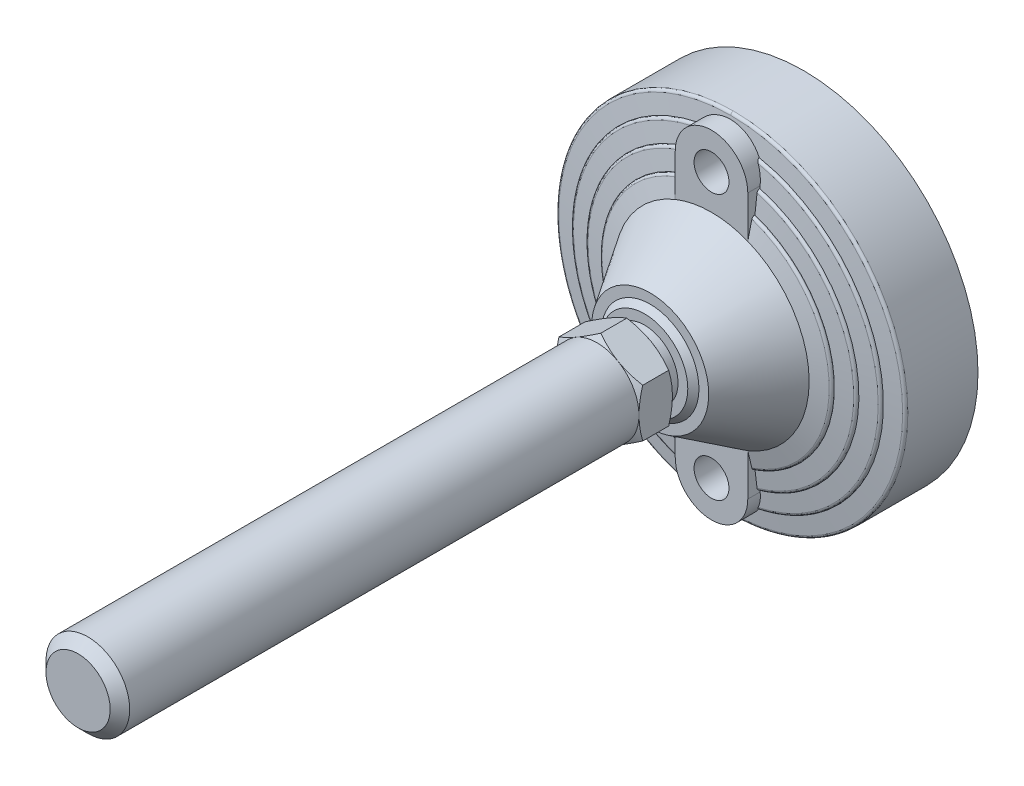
ISO-10303-21;
HEADER;
FILE_DESCRIPTION(('STEP AP214'),'2;1');
FILE_NAME('part.step','',(''),(''),'','','');
FILE_SCHEMA(('AUTOMOTIVE_DESIGN { 1 0 10303 214 1 1 1 1 }'));
ENDSEC;
DATA;
#1=APPLICATION_CONTEXT('core data for automotive mechanical design processes');
#2=APPLICATION_PROTOCOL_DEFINITION('international standard','automotive_design',2000,#1);
#3=PRODUCT_CONTEXT('',#1,'mechanical');
#4=PRODUCT('Part','Part','',(#3));
#5=PRODUCT_RELATED_PRODUCT_CATEGORY('part','',(#4));
#6=PRODUCT_DEFINITION_FORMATION('','',#4);
#7=PRODUCT_DEFINITION_CONTEXT('part definition',#1,'design');
#8=PRODUCT_DEFINITION('design','',#6,#7);
#9=PRODUCT_DEFINITION_SHAPE('','',#8);
#10=(LENGTH_UNIT() NAMED_UNIT(*) SI_UNIT(.MILLI.,.METRE.));
#11=(NAMED_UNIT(*) PLANE_ANGLE_UNIT() SI_UNIT($,.RADIAN.));
#12=(NAMED_UNIT(*) SI_UNIT($,.STERADIAN.) SOLID_ANGLE_UNIT());
#13=UNCERTAINTY_MEASURE_WITH_UNIT(LENGTH_MEASURE(1.E-05),#10,'distance_accuracy_value','');
#14=(GEOMETRIC_REPRESENTATION_CONTEXT(3) GLOBAL_UNCERTAINTY_ASSIGNED_CONTEXT((#13)) GLOBAL_UNIT_ASSIGNED_CONTEXT((#10,
#11,#12)) REPRESENTATION_CONTEXT('',''));
#15=CARTESIAN_POINT('',(0.,0.,0.));
#16=DIRECTION('',(0.,0.,1.));
#17=DIRECTION('',(1.,0.,0.));
#18=AXIS2_PLACEMENT_3D('',#15,#16,#17);
#19=CARTESIAN_POINT('',(-15.,17.528354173,62.));
#20=DIRECTION('',(0.,0.,1.));
#21=DIRECTION('',(0.,-1.,0.));
#22=AXIS2_PLACEMENT_3D('',#19,#20,#21);
#23=PLANE('',#22);
#24=CARTESIAN_POINT('',(0.,0.,62.));
#25=DIRECTION('',(0.,0.,-1.));
#26=DIRECTION('',(0.,1.,0.));
#27=AXIS2_PLACEMENT_3D('',#24,#25,#26);
#28=CIRCLE('',#27,12.);
#29=CARTESIAN_POINT('',(0.,12.,62.));
#30=VERTEX_POINT('',#29);
#31=EDGE_CURVE('E499',#30,#30,#28,.T.);
#32=ORIENTED_EDGE('',*,*,#31,.F.);
#33=EDGE_LOOP('',(#32));
#34=FACE_BOUND('',#33,.T.);
#35=CARTESIAN_POINT('',(0.,0.,62.));
#36=DIRECTION('',(0.,0.,1.));
#37=DIRECTION('',(0.,-1.,0.));
#38=AXIS2_PLACEMENT_3D('',#35,#36,#37);
#39=CIRCLE('',#38,15.);
#40=CARTESIAN_POINT('',(7.50000000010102,-12.9903810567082,62.));
#41=VERTEX_POINT('',#40);
#42=CARTESIAN_POINT('',(-7.50000000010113,-12.9903810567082,62.));
#43=VERTEX_POINT('',#42);
#44=EDGE_CURVE('E26',#41,#43,#39,.F.);
#45=ORIENTED_EDGE('',*,*,#44,.T.);
#46=CARTESIAN_POINT('',(-15.,0.,62.));
#47=VERTEX_POINT('',#46);
#48=EDGE_CURVE('E9',#43,#47,#39,.F.);
#49=ORIENTED_EDGE('',*,*,#48,.T.);
#50=CARTESIAN_POINT('',(-7.5000000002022,12.9903810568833,62.));
#51=VERTEX_POINT('',#50);
#52=EDGE_CURVE('E25',#47,#51,#39,.F.);
#53=ORIENTED_EDGE('',*,*,#52,.T.);
#54=CARTESIAN_POINT('',(7.50000000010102,12.9903810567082,62.));
#55=VERTEX_POINT('',#54);
#56=EDGE_CURVE('E239',#51,#55,#39,.F.);
#57=ORIENTED_EDGE('',*,*,#56,.T.);
#58=CARTESIAN_POINT('',(0.,0.,62.));
#59=DIRECTION('',(0.,0.,-1.));
#60=DIRECTION('',(0.,1.,0.));
#61=AXIS2_PLACEMENT_3D('',#58,#59,#60);
#62=CIRCLE('',#61,15.);
#63=CARTESIAN_POINT('',(15.,0.,62.));
#64=VERTEX_POINT('',#63);
#65=EDGE_CURVE('E253',#55,#64,#62,.T.);
#66=ORIENTED_EDGE('',*,*,#65,.T.);
#67=EDGE_CURVE('E263',#64,#41,#39,.F.);
#68=ORIENTED_EDGE('',*,*,#67,.T.);
#69=EDGE_LOOP('',(#45,#49,#53,#57,#66,#68));
#70=FACE_BOUND('',#69,.T.);
#71=ADVANCED_FACE('F14',(#34,#70),#23,.F.);
#72=CARTESIAN_POINT('',(0.,0.,62.));
#73=DIRECTION('',(0.,0.,-1.));
#74=DIRECTION('',(0.,1.,0.));
#75=AXIS2_PLACEMENT_3D('',#72,#73,#74);
#76=CYLINDRICAL_SURFACE('',#75,12.);
#77=CARTESIAN_POINT('',(0.,0.,57.));
#78=DIRECTION('',(0.,0.,-1.));
#79=DIRECTION('',(0.,1.,0.));
#80=AXIS2_PLACEMENT_3D('',#77,#78,#79);
#81=CIRCLE('',#80,12.);
#82=CARTESIAN_POINT('',(0.,12.,57.));
#83=VERTEX_POINT('',#82);
#84=EDGE_CURVE('E911',#83,#83,#81,.F.);
#85=ORIENTED_EDGE('',*,*,#84,.T.);
#86=EDGE_LOOP('',(#85));
#87=FACE_BOUND('',#86,.T.);
#88=ORIENTED_EDGE('',*,*,#31,.T.);
#89=EDGE_LOOP('',(#88));
#90=FACE_BOUND('',#89,.T.);
#91=ADVANCED_FACE('F519',(#87,#90),#76,.T.);
#92=CARTESIAN_POINT('',(-15.7399750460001,-15.686,57.));
#93=DIRECTION('',(0.,0.,-1.));
#94=DIRECTION('',(0.,1.,0.));
#95=AXIS2_PLACEMENT_3D('',#92,#93,#94);
#96=PLANE('',#95);
#97=ORIENTED_EDGE('',*,*,#84,.F.);
#98=EDGE_LOOP('',(#97));
#99=FACE_BOUND('',#98,.T.);
#100=CARTESIAN_POINT('',(0.,0.,57.));
#101=DIRECTION('',(0.,0.,-1.));
#102=DIRECTION('',(1.,0.,0.));
#103=AXIS2_PLACEMENT_3D('',#100,#101,#102);
#104=CIRCLE('',#103,15.5);
#105=CARTESIAN_POINT('',(15.4999999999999,0.,57.));
#106=VERTEX_POINT('',#105);
#107=EDGE_CURVE('E908',#106,#106,#104,.T.);
#108=ORIENTED_EDGE('',*,*,#107,.F.);
#109=EDGE_LOOP('',(#108));
#110=FACE_BOUND('',#109,.T.);
#111=ADVANCED_FACE('F522',(#99,#110),#96,.F.);
#112=CARTESIAN_POINT('',(-6.34676413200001,-41.175,10.));
#113=DIRECTION('',(0.,0.,1.));
#114=DIRECTION('',(0.,-1.,0.));
#115=AXIS2_PLACEMENT_3D('',#112,#113,#114);
#116=PLANE('',#115);
#117=CARTESIAN_POINT('',(0.,-47.5,10.));
#118=DIRECTION('',(0.,0.,1.));
#119=DIRECTION('',(-1.,0.,0.));
#120=AXIS2_PLACEMENT_3D('',#117,#118,#119);
#121=CIRCLE('',#120,6.25);
#122=CARTESIAN_POINT('',(-6.25000000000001,-47.5,9.99999999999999));
#123=VERTEX_POINT('',#122);
#124=EDGE_CURVE('E903',#123,#123,#121,.T.);
#125=ORIENTED_EDGE('',*,*,#124,.T.);
#126=EDGE_LOOP('',(#125));
#127=FACE_BOUND('',#126,.T.);
#128=ADVANCED_FACE('F525',(#127),#116,.T.);
#129=CARTESIAN_POINT('',(0.,0.,57.));
#130=DIRECTION('',(0.,0.,-1.));
#131=DIRECTION('',(1.,0.,0.));
#132=AXIS2_PLACEMENT_3D('',#129,#130,#131);
#133=CONICAL_SURFACE('',#132,15.5,0.785398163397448);
#134=CARTESIAN_POINT('',(0.,0.,55.));
#135=DIRECTION('',(0.,0.,-1.));
#136=DIRECTION('',(1.,0.,0.));
#137=AXIS2_PLACEMENT_3D('',#134,#135,#136);
#138=CIRCLE('',#137,17.5);
#139=CARTESIAN_POINT('',(17.5,0.,55.));
#140=VERTEX_POINT('',#139);
#141=EDGE_CURVE('E900',#140,#140,#138,.F.);
#142=ORIENTED_EDGE('',*,*,#141,.T.);
#143=EDGE_LOOP('',(#142));
#144=FACE_BOUND('',#143,.T.);
#145=ORIENTED_EDGE('',*,*,#107,.T.);
#146=EDGE_LOOP('',(#145));
#147=FACE_BOUND('',#146,.T.);
#148=ADVANCED_FACE('F529',(#144,#147),#133,.T.);
#149=CARTESIAN_POINT('',(-63.467641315,63.25,0.));
#150=DIRECTION('',(0.,0.,1.));
#151=DIRECTION('',(0.,-1.,0.));
#152=AXIS2_PLACEMENT_3D('',#149,#150,#151);
#153=PLANE('',#152);
#154=CARTESIAN_POINT('',(0.,0.,0.));
#155=DIRECTION('',(0.,0.,-1.));
#156=DIRECTION('',(1.,0.,0.));
#157=AXIS2_PLACEMENT_3D('',#154,#155,#156);
#158=CIRCLE('',#157,62.5);
#159=CARTESIAN_POINT('',(62.5,0.,0.));
#160=VERTEX_POINT('',#159);
#161=EDGE_CURVE('E481',#160,#160,#158,.F.);
#162=ORIENTED_EDGE('',*,*,#161,.F.);
#163=EDGE_LOOP('',(#162));
#164=FACE_BOUND('',#163,.T.);
#165=ADVANCED_FACE('F531',(#164),#153,.F.);
#166=CARTESIAN_POINT('',(0.,-47.5,10.));
#167=DIRECTION('',(0.,0.,1.));
#168=DIRECTION('',(-1.,0.,0.));
#169=AXIS2_PLACEMENT_3D('',#166,#167,#168);
#170=CYLINDRICAL_SURFACE('',#169,6.25);
#171=ORIENTED_EDGE('',*,*,#124,.F.);
#172=EDGE_LOOP('',(#171));
#173=FACE_BOUND('',#172,.T.);
#174=CARTESIAN_POINT('',(0.,-47.5,33.));
#175=DIRECTION('',(0.,0.,1.));
#176=DIRECTION('',(-1.,0.,0.));
#177=AXIS2_PLACEMENT_3D('',#174,#175,#176);
#178=CIRCLE('',#177,6.25);
#179=CARTESIAN_POINT('',(-6.25000000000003,-47.5,33.));
#180=VERTEX_POINT('',#179);
#181=EDGE_CURVE('E372',#180,#180,#178,.T.);
#182=ORIENTED_EDGE('',*,*,#181,.T.);
#183=EDGE_LOOP('',(#182));
#184=FACE_BOUND('',#183,.T.);
#185=ADVANCED_FACE('F534',(#173,#184),#170,.F.);
#186=CARTESIAN_POINT('',(-21.325127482,-21.252,55.));
#187=DIRECTION('',(0.,0.,-1.));
#188=DIRECTION('',(0.,1.,0.));
#189=AXIS2_PLACEMENT_3D('',#186,#187,#188);
#190=PLANE('',#189);
#191=ORIENTED_EDGE('',*,*,#141,.F.);
#192=EDGE_LOOP('',(#191));
#193=FACE_BOUND('',#192,.T.);
#194=CARTESIAN_POINT('',(0.,0.,55.));
#195=DIRECTION('',(0.,0.,-1.));
#196=DIRECTION('',(0.,1.,0.));
#197=AXIS2_PLACEMENT_3D('',#194,#195,#196);
#198=CIRCLE('',#197,21.);
#199=CARTESIAN_POINT('',(0.,21.,55.));
#200=VERTEX_POINT('',#199);
#201=EDGE_CURVE('E473',#200,#200,#198,.T.);
#202=ORIENTED_EDGE('',*,*,#201,.F.);
#203=EDGE_LOOP('',(#202));
#204=FACE_BOUND('',#203,.T.);
#205=ADVANCED_FACE('F536',(#193,#204),#190,.F.);
#206=CARTESIAN_POINT('',(-6.34676413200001,53.825,10.));
#207=DIRECTION('',(0.,0.,1.));
#208=DIRECTION('',(0.,-1.,0.));
#209=AXIS2_PLACEMENT_3D('',#206,#207,#208);
#210=PLANE('',#209);
#211=CARTESIAN_POINT('',(0.,47.5,10.));
#212=DIRECTION('',(0.,0.,1.));
#213=DIRECTION('',(-1.,0.,0.));
#214=AXIS2_PLACEMENT_3D('',#211,#212,#213);
#215=CIRCLE('',#214,6.25);
#216=CARTESIAN_POINT('',(-6.25000000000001,47.5,9.99999999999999));
#217=VERTEX_POINT('',#216);
#218=EDGE_CURVE('E865',#217,#217,#215,.T.);
#219=ORIENTED_EDGE('',*,*,#218,.T.);
#220=EDGE_LOOP('',(#219));
#221=FACE_BOUND('',#220,.T.);
#222=ADVANCED_FACE('F539',(#221),#210,.T.);
#223=CARTESIAN_POINT('',(0.,0.,33.));
#224=DIRECTION('',(0.,0.,-1.));
#225=DIRECTION('',(0.,1.,0.));
#226=AXIS2_PLACEMENT_3D('',#223,#224,#225);
#227=CONICAL_SURFACE('',#226,35.,1.32154418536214);
#228=CARTESIAN_POINT('',(0.,0.,33.));
#229=DIRECTION('',(0.,0.,-1.));
#230=DIRECTION('',(0.,1.,0.));
#231=AXIS2_PLACEMENT_3D('',#228,#229,#230);
#232=CIRCLE('',#231,35.);
#233=CARTESIAN_POINT('',(12.9999999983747,-32.4961536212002,32.9999999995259));
#234=VERTEX_POINT('',#233);
#235=CARTESIAN_POINT('',(13.0000000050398,32.4961536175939,32.999999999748));
#236=VERTEX_POINT('',#235);
#237=EDGE_CURVE('E470',#234,#236,#232,.F.);
#238=ORIENTED_EDGE('',*,*,#237,.F.);
#239=CARTESIAN_POINT('',(13.0000000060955,-38.6172483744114,31.5372089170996));
#240=CARTESIAN_POINT('',(13.0000000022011,-38.1074186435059,31.6602002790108));
#241=CARTESIAN_POINT('',(13.0000000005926,-37.5975329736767,31.7829600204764));
#242=CARTESIAN_POINT('',(12.9999999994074,-36.5776365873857,32.0279559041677));
#243=CARTESIAN_POINT('',(12.9999999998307,-36.0676258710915,32.1501920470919));
#244=CARTESIAN_POINT('',(13.0000000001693,-35.0474647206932,32.3940807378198));
#245=CARTESIAN_POINT('',(13.0000000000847,-34.5373142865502,32.5157332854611));
#246=CARTESIAN_POINT('',(12.9999999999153,-33.5168560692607,32.7583795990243));
#247=CARTESIAN_POINT('',(12.9999999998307,-33.0065482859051,32.8793733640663));
#248=CARTESIAN_POINT('',(13.,-32.496153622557,32.9999999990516));
#249=B_SPLINE_CURVE_WITH_KNOTS('',3,(#239,#240,#241,#242,#243,#244,#245,#246,#247,#248),
.UNSPECIFIED.,.F.,.F.,(4,2,2,2,4),(0.,1.57336555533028,3.14672901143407,4.72009290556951,
6.2934589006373),.UNSPECIFIED.);
#250=CARTESIAN_POINT('',(13.,-38.6172483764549,31.5372089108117));
#251=VERTEX_POINT('',#250);
#252=EDGE_CURVE('E589',#251,#234,#249,.T.);
#253=ORIENTED_EDGE('',*,*,#252,.F.);
#254=CARTESIAN_POINT('',(0.,0.,31.53720891));
#255=DIRECTION('',(0.,0.,-1.));
#256=DIRECTION('',(0.,1.,0.));
#257=AXIS2_PLACEMENT_3D('',#254,#255,#256);
#258=CIRCLE('',#257,40.746679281);
#259=CARTESIAN_POINT('',(13.,38.6172483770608,31.5372089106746));
#260=VERTEX_POINT('',#259);
#261=EDGE_CURVE('E491',#260,#251,#258,.T.);
#262=ORIENTED_EDGE('',*,*,#261,.F.);
#263=CARTESIAN_POINT('',(13.,32.4961536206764,32.999999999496));
#264=CARTESIAN_POINT('',(13.,33.0065482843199,32.8793733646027));
#265=CARTESIAN_POINT('',(13.,33.5168560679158,32.7583795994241));
#266=CARTESIAN_POINT('',(13.,34.5373142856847,32.515733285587));
#267=CARTESIAN_POINT('',(13.,35.0474647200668,32.3940807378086));
#268=CARTESIAN_POINT('',(13.,36.0676258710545,32.1501920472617));
#269=CARTESIAN_POINT('',(13.,36.577636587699,32.0279559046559));
#270=CARTESIAN_POINT('',(13.,37.597532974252,31.7829600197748));
#271=CARTESIAN_POINT('',(13.,38.1074186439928,31.6602002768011));
#272=CARTESIAN_POINT('',(13.,38.6172483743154,31.5372089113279));
#273=B_SPLINE_CURVE_WITH_KNOTS('',3,(#263,#264,#265,#266,#267,#268,#269,#270,#271,#272),
.UNSPECIFIED.,.F.,.F.,(4,2,2,2,4),(0.,1.57336599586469,3.1467298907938,4.72009334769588,
6.29345890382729),.UNSPECIFIED.);
#274=EDGE_CURVE('E860',#236,#260,#273,.T.);
#275=ORIENTED_EDGE('',*,*,#274,.F.);
#276=EDGE_LOOP('',(#238,#253,#262,#275));
#277=FACE_BOUND('',#276,.T.);
#278=ADVANCED_FACE('F543',(#277),#227,.T.);
#279=CARTESIAN_POINT('',(12.406354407,39.602176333,30.568111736));
#280=CARTESIAN_POINT('',(59.707464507,24.78394183,30.5681117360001));
#281=CARTESIAN_POINT('',(59.707464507,-24.78394183,30.5681117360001));
#282=CARTESIAN_POINT('',(12.406354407,-39.602176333,30.568111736));
#283=CARTESIAN_POINT('',(12.406354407,39.602176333,31.044046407));
#284=CARTESIAN_POINT('',(59.707464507,24.78394183,31.0440464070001));
#285=CARTESIAN_POINT('',(59.707464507,-24.78394183,31.0440464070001));
#286=CARTESIAN_POINT('',(12.406354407,-39.602176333,31.044046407));
#287=CARTESIAN_POINT('',(12.31903347,39.323440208,31.419805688));
#288=CARTESIAN_POINT('',(59.287219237,24.609502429,31.4198056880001));
#289=CARTESIAN_POINT('',(59.287219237,-24.609502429,31.4198056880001));
#290=CARTESIAN_POINT('',(12.31903347,-39.323440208,31.419805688));
#291=CARTESIAN_POINT('',(12.18115046,38.883305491,31.53720891));
#292=CARTESIAN_POINT('',(58.623636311,24.334056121,31.5372089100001));
#293=CARTESIAN_POINT('',(58.623636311,-24.334056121,31.5372089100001));
#294=CARTESIAN_POINT('',(12.18115046,-38.883305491,31.53720891));
#295=(BOUNDED_SURFACE() B_SPLINE_SURFACE(3,3,((#279,#280,#281,#282),(#283,#284,#285,#286),(#287,
#288,#289,#290),(#291,#292,#293,#294)),.UNSPECIFIED.,.F.,.F.,
.F.) B_SPLINE_SURFACE_WITH_KNOTS((4,4),(4,4),(0.,1.),(0.,1.),
.UNSPECIFIED.) GEOMETRIC_REPRESENTATION_ITEM() RATIONAL_B_SPLINE_SURFACE(((1.,0.532632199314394,
0.532632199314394,1.),(0.85967907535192,0.457892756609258,0.457892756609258,0.85967907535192),
(0.85967907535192,0.457892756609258,0.457892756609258,0.85967907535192),(1.,0.532632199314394,
0.532632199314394,1.))) REPRESENTATION_ITEM('') SURFACE());
#296=CARTESIAN_POINT('',(13.,-39.4112927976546,30.5681117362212));
#297=CARTESIAN_POINT('',(13.,-39.411293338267,30.5952104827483));
#298=CARTESIAN_POINT('',(13.,-39.4101321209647,30.6222958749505));
#299=CARTESIAN_POINT('',(13.,-39.405504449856,30.6762650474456));
#300=CARTESIAN_POINT('',(13.,-39.4020383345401,30.7031488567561));
#301=CARTESIAN_POINT('',(13.,-39.3882336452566,30.7831079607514));
#302=CARTESIAN_POINT('',(13.,-39.3744885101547,30.8356344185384));
#303=CARTESIAN_POINT('',(13.,-39.3384084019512,30.9376087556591));
#304=CARTESIAN_POINT('',(13.,-39.3160736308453,30.9870567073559));
#305=CARTESIAN_POINT('',(13.,-39.2635909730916,31.081601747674));
#306=CARTESIAN_POINT('',(13.,-39.233444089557,31.1266993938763));
#307=CARTESIAN_POINT('',(13.,-39.165605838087,31.2123360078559));
#308=CARTESIAN_POINT('',(13.,-39.1277714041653,31.2527614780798));
#309=CARTESIAN_POINT('',(13.,-39.0461074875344,31.3270714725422));
#310=CARTESIAN_POINT('',(13.,-39.0022718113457,31.360949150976));
#311=CARTESIAN_POINT('',(13.,-38.904317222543,31.425052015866));
#312=CARTESIAN_POINT('',(13.,-38.849595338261,31.4543647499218));
#313=CARTESIAN_POINT('',(13.,-38.7644641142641,31.4909906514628));
#314=CARTESIAN_POINT('',(13.,-38.7355751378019,31.5019763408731));
#315=CARTESIAN_POINT('',(13.,-38.6769796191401,31.5214626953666));
#316=CARTESIAN_POINT('',(13.,-38.6472733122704,31.5299640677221));
#317=CARTESIAN_POINT('',(13.,-38.6172483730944,31.5372089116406));
#318=B_SPLINE_CURVE_WITH_KNOTS('',3,(#296,#297,#298,#299,#300,#301,#302,#303,#304,#305,#306,
#307,#308,#309,#310,#311,#312,#313,#314,#315,#316,#317),.UNSPECIFIED.,.F.,.F.,(4,2,2,2,2,2,2,2,
2,2,4),(0.,0.0812450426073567,0.162478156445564,0.324519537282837,0.48655710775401,
0.64857388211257,0.813939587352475,0.979477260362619,1.16468654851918,1.25731455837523,
1.3499161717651),.UNSPECIFIED.);
#319=CARTESIAN_POINT('',(13.,-39.4112928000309,30.5681117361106));
#320=VERTEX_POINT('',#319);
#321=EDGE_CURVE('E368',#320,#251,#318,.T.);
#322=CARTESIAN_POINT('',(0.,0.,30.568111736));
#323=DIRECTION('',(0.,0.,-1.));
#324=DIRECTION('',(0.,1.,0.));
#325=AXIS2_PLACEMENT_3D('',#322,#323,#324);
#326=CIRCLE('',#325,41.5);
#327=CARTESIAN_POINT('',(13.,39.4112928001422,30.5681117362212));
#328=VERTEX_POINT('',#327);
#329=EDGE_CURVE('E489',#328,#320,#326,.T.);
#330=CARTESIAN_POINT('',(13.,38.6172483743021,31.5372089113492));
#331=CARTESIAN_POINT('',(13.,38.6757273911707,31.5231434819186));
#332=CARTESIAN_POINT('',(13.,38.7330575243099,31.5042077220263));
#333=CARTESIAN_POINT('',(13.,38.8438981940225,31.4570874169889));
#334=CARTESIAN_POINT('',(13.,38.8974017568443,31.4288864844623));
#335=CARTESIAN_POINT('',(13.,38.9989209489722,31.363734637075));
#336=CARTESIAN_POINT('',(13.,39.0469285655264,31.3267711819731));
#337=CARTESIAN_POINT('',(13.,39.135707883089,31.2450475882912));
#338=CARTESIAN_POINT('',(13.,39.1764870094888,31.2002955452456));
#339=CARTESIAN_POINT('',(13.,39.247988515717,31.1059931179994));
#340=CARTESIAN_POINT('',(13.,39.2790300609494,31.0566848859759));
#341=CARTESIAN_POINT('',(13.,39.3318958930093,30.9533393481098));
#342=CARTESIAN_POINT('',(13.,39.3537228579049,30.899303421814));
#343=CARTESIAN_POINT('',(13.,39.3839717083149,30.7991363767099));
#344=CARTESIAN_POINT('',(13.,39.3941848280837,30.7535382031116));
#345=CARTESIAN_POINT('',(13.,39.4078594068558,30.6613400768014));
#346=CARTESIAN_POINT('',(13.,39.4113205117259,30.6147400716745));
#347=CARTESIAN_POINT('',(13.,39.4112927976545,30.5681117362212));
#348=B_SPLINE_CURVE_WITH_KNOTS('',3,(#330,#331,#332,#333,#334,#335,#336,#337,#338,#339,#340,
#341,#342,#343,#344,#345,#346,#347),.UNSPECIFIED.,.F.,.F.,(4,2,2,2,2,2,2,2,4),(0.,
0.180276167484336,0.36087292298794,0.541729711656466,0.722399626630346,0.896310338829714,
1.07017047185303,1.20986981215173,1.34957647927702),.UNSPECIFIED.);
#349=EDGE_CURVE('E377',#260,#328,#348,.T.);
#350=ORIENTED_EDGE('',*,*,#261,.T.);
#351=ORIENTED_EDGE('',*,*,#321,.F.);
#352=ORIENTED_EDGE('',*,*,#329,.F.);
#353=ORIENTED_EDGE('',*,*,#349,.F.);
#354=EDGE_LOOP('',(#350,#351,#352,#353));
#355=FACE_BOUND('',#354,.T.);
#356=ADVANCED_FACE('F899',(#355),#295,.T.);
#357=CARTESIAN_POINT('',(0.,0.,30.568111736));
#358=DIRECTION('',(0.,0.,-1.));
#359=DIRECTION('',(0.,1.,0.));
#360=AXIS2_PLACEMENT_3D('',#357,#358,#359);
#361=CYLINDRICAL_SURFACE('',#360,41.5);
#362=CARTESIAN_POINT('',(0.,0.,30.4545454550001));
#363=DIRECTION('',(0.,0.,-1.));
#364=DIRECTION('',(0.,1.,0.));
#365=AXIS2_PLACEMENT_3D('',#362,#363,#364);
#366=CIRCLE('',#365,41.5);
#367=CARTESIAN_POINT('',(13.,39.4112928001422,30.4545454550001));
#368=VERTEX_POINT('',#367);
#369=CARTESIAN_POINT('',(13.,-39.4112928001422,30.4545454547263));
#370=VERTEX_POINT('',#369);
#371=EDGE_CURVE('E364',#368,#370,#366,.T.);
#372=ORIENTED_EDGE('',*,*,#371,.F.);
#373=DIRECTION('',(0.,0.,-1.));
#374=VECTOR('',#373,1.);
#375=CARTESIAN_POINT('',(13.,39.4112928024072,30.7755712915));
#376=LINE('',#375,#374);
#377=EDGE_CURVE('E373',#328,#368,#376,.T.);
#378=ORIENTED_EDGE('',*,*,#377,.F.);
#379=ORIENTED_EDGE('',*,*,#329,.T.);
#380=DIRECTION('',(0.,0.,1.));
#381=VECTOR('',#380,1.);
#382=CARTESIAN_POINT('',(13.,-39.4112928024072,30.7755712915));
#383=LINE('',#382,#381);
#384=EDGE_CURVE('E365',#370,#320,#383,.T.);
#385=ORIENTED_EDGE('',*,*,#384,.F.);
#386=EDGE_LOOP('',(#372,#378,#379,#385));
#387=FACE_BOUND('',#386,.T.);
#388=ADVANCED_FACE('F897',(#387),#361,.T.);
#389=CARTESIAN_POINT('',(0.,0.,30.454545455));
#390=DIRECTION('',(0.,0.,-1.));
#391=DIRECTION('',(0.,1.,0.));
#392=AXIS2_PLACEMENT_3D('',#389,#390,#391);
#393=CONICAL_SURFACE('',#392,41.5,1.4442041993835);
#394=ORIENTED_EDGE('',*,*,#371,.T.);
#395=CARTESIAN_POINT('',(13.0000000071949,-45.8176832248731,29.6748403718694));
#396=CARTESIAN_POINT('',(13.0000000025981,-45.2838642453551,29.7402005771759));
#397=CARTESIAN_POINT('',(13.0000000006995,-44.7500350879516,29.8054777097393));
#398=CARTESIAN_POINT('',(12.9999999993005,-43.6823542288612,29.9358466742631));
#399=CARTESIAN_POINT('',(12.9999999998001,-43.1485025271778,30.0009385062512));
#400=CARTESIAN_POINT('',(13.0000000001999,-42.0807742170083,30.1309177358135));
#401=CARTESIAN_POINT('',(13.0000000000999,-41.5468976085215,30.1958051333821));
#402=CARTESIAN_POINT('',(12.9999999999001,-40.4791166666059,30.3253520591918));
#403=CARTESIAN_POINT('',(12.9999999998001,-39.9452123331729,30.390011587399));
#404=CARTESIAN_POINT('',(13.,-39.4112928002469,30.4545454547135));
#405=B_SPLINE_CURVE_WITH_KNOTS('',3,(#395,#396,#397,#398,#399,#400,#401,#402,#403,#404),
.UNSPECIFIED.,.F.,.F.,(4,2,2,2,4),(0.,1.613416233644,3.22683222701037,4.84024826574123,
6.45366454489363),.UNSPECIFIED.);
#406=CARTESIAN_POINT('',(13.,-45.8176832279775,29.6748403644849));
#407=VERTEX_POINT('',#406);
#408=EDGE_CURVE('E369',#407,#370,#405,.T.);
#409=ORIENTED_EDGE('',*,*,#408,.F.);
#410=CARTESIAN_POINT('',(-7.48585788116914E-10,0.,29.674840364));
#411=DIRECTION('',(0.,0.,-1.));
#412=DIRECTION('',(0.,1.,0.));
#413=AXIS2_PLACEMENT_3D('',#410,#411,#412);
#414=CIRCLE('',#413,47.6262542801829);
#415=CARTESIAN_POINT('',(13.,45.8176832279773,29.6748403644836));
#416=VERTEX_POINT('',#415);
#417=EDGE_CURVE('E361',#416,#407,#414,.T.);
#418=ORIENTED_EDGE('',*,*,#417,.F.);
#419=CARTESIAN_POINT('',(12.9999999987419,39.4112928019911,30.4545454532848));
#420=CARTESIAN_POINT('',(12.9999999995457,39.9452123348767,30.3900115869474));
#421=CARTESIAN_POINT('',(12.9999999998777,40.4791166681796,30.3253520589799));
#422=CARTESIAN_POINT('',(13.0000000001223,41.5468976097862,30.1958051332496));
#423=CARTESIAN_POINT('',(13.0000000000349,42.080774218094,30.1309177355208));
#424=CARTESIAN_POINT('',(12.9999999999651,43.1485025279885,30.000938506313));
#425=CARTESIAN_POINT('',(12.9999999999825,43.6823542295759,29.9358466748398));
#426=CARTESIAN_POINT('',(13.0000000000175,44.7500350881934,29.8054777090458));
#427=CARTESIAN_POINT('',(13.0000000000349,45.2838642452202,29.7402005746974));
#428=CARTESIAN_POINT('',(13.,45.817683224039,29.6748403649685));
#429=B_SPLINE_CURVE_WITH_KNOTS('',3,(#419,#420,#421,#422,#423,#424,#425,#426,#427,#428),
.UNSPECIFIED.,.F.,.F.,(4,2,2,2,4),(0.,1.61341627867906,3.226832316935,4.840248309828,
6.45366454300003),.UNSPECIFIED.);
#430=EDGE_CURVE('E376',#368,#416,#429,.T.);
#431=ORIENTED_EDGE('',*,*,#430,.F.);
#432=EDGE_LOOP('',(#394,#409,#418,#431));
#433=FACE_BOUND('',#432,.T.);
#434=ADVANCED_FACE('F603',(#433),#393,.T.);
#435=CARTESIAN_POINT('',(12.269850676,46.922284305,28.6696231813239));
#436=CARTESIAN_POINT('',(72.557631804,31.157449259,28.669623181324));
#437=CARTESIAN_POINT('',(72.557631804,-31.157449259,28.669623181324));
#438=CARTESIAN_POINT('',(12.269850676,-46.922284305,28.6696231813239));
#439=CARTESIAN_POINT('',(12.269850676,46.922284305,28.6740296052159));
#440=CARTESIAN_POINT('',(72.557631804,31.157449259,28.674029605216));
#441=CARTESIAN_POINT('',(72.557631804,-31.157449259,28.674029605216));
#442=CARTESIAN_POINT('',(12.269850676,-46.922284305,28.6740296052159));
#443=CARTESIAN_POINT('',(12.269850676,46.922284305,28.678436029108));
#444=CARTESIAN_POINT('',(72.557631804,31.157449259,28.6784360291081));
#445=CARTESIAN_POINT('',(72.557631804,-31.157449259,28.6784360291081));
#446=CARTESIAN_POINT('',(12.269850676,-46.922284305,28.678436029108));
#447=CARTESIAN_POINT('',(12.269850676,46.922284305,28.682842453));
#448=CARTESIAN_POINT('',(72.557631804,31.157449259,28.682842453));
#449=CARTESIAN_POINT('',(72.557631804,-31.157449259,28.682842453));
#450=CARTESIAN_POINT('',(12.269850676,-46.922284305,28.682842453));
#451=CARTESIAN_POINT('',(12.269850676,46.922284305,29.211436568));
#452=CARTESIAN_POINT('',(72.557631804,31.157449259,29.2114365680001));
#453=CARTESIAN_POINT('',(72.557631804,-31.157449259,29.2114365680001));
#454=CARTESIAN_POINT('',(12.269850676,-46.922284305,29.211436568));
#455=CARTESIAN_POINT('',(12.181461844,46.584268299,29.608103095));
#456=CARTESIAN_POINT('',(72.034945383,30.93299905,29.6081030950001));
#457=CARTESIAN_POINT('',(72.034945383,-30.93299905,29.6081030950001));
#458=CARTESIAN_POINT('',(12.181461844,-46.584268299,29.608103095));
#459=CARTESIAN_POINT('',(12.048804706,46.076961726,29.674840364));
#460=CARTESIAN_POINT('',(71.250478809,30.596136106,29.674840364));
#461=CARTESIAN_POINT('',(71.250478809,-30.596136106,29.674840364));
#462=CARTESIAN_POINT('',(12.048804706,-46.076961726,29.674840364));
#463=(BOUNDED_SURFACE() B_SPLINE_SURFACE(3,3,((#435,#436,#437,#438),(#439,#440,#441,#442),(#443,
#444,#445,#446),(#447,#448,#449,#450),(#451,#452,#453,#454),(#455,#456,#457,#458),(#459,#460,
#461,#462)),.UNSPECIFIED.,.F.,.F.,.F.) B_SPLINE_SURFACE_WITH_KNOTS((4,3,4),(4,4),(-0.01,0.,1.),
(0.,1.),.UNSPECIFIED.) GEOMETRIC_REPRESENTATION_ITEM() RATIONAL_B_SPLINE_SURFACE(((1.,
0.501991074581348,0.501991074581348,1.),(1.,0.501991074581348,0.501991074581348,1.),(1.,
0.501991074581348,0.501991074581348,1.),(1.,0.501991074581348,0.501991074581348,1.),
(0.833611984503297,0.4184657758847,0.4184657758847,0.833611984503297),(0.833611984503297,
0.4184657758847,0.4184657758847,0.833611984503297),(1.,0.501991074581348,0.501991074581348,1.))) REPRESENTATION_ITEM('') SURFACE());
#464=CARTESIAN_POINT('',(13.,-46.7252608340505,28.6777848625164));
#465=CARTESIAN_POINT('',(13.,-46.7253979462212,28.7054287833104));
#466=CARTESIAN_POINT('',(13.,-46.7243484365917,28.7330653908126));
#467=CARTESIAN_POINT('',(13.,-46.719887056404,28.788143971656));
#468=CARTESIAN_POINT('',(13.,-46.716475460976,28.8155859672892));
#469=CARTESIAN_POINT('',(13.,-46.7027375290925,28.897216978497));
#470=CARTESIAN_POINT('',(13.,-46.688908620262,28.950857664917));
#471=CARTESIAN_POINT('',(13.,-46.6523707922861,29.055050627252));
#472=CARTESIAN_POINT('',(13.,-46.629652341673,29.1055995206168));
#473=CARTESIAN_POINT('',(13.,-46.5760978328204,29.2021956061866));
#474=CARTESIAN_POINT('',(13.,-46.5452617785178,29.2482428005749));
#475=CARTESIAN_POINT('',(13.,-46.4762858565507,29.3348542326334));
#476=CARTESIAN_POINT('',(13.,-46.4381108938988,29.3753904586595));
#477=CARTESIAN_POINT('',(13.,-46.3556866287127,29.4497572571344));
#478=CARTESIAN_POINT('',(13.,-46.3114344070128,29.4835845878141));
#479=CARTESIAN_POINT('',(13.,-46.2164675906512,29.544827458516));
#480=CARTESIAN_POINT('',(13.,-46.1655796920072,29.5719736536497));
#481=CARTESIAN_POINT('',(13.,-46.0601083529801,29.6176355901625));
#482=CARTESIAN_POINT('',(13.,-46.0055288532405,29.6361603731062));
#483=CARTESIAN_POINT('',(13.,-45.9281089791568,29.6556819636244));
#484=CARTESIAN_POINT('',(13.,-45.9061721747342,29.6604842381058));
#485=CARTESIAN_POINT('',(13.,-45.8620822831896,29.6686997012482));
#486=CARTESIAN_POINT('',(13.,-45.8399296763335,29.672115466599));
#487=CARTESIAN_POINT('',(13.,-45.817683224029,29.674840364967));
#488=B_SPLINE_CURVE_WITH_KNOTS('',3,(#464,#465,#466,#467,#468,#469,#470,#471,#472,#473,#474,
#475,#476,#477,#478,#479,#480,#481,#482,#483,#484,#485,#486,#487),.UNSPECIFIED.,.F.,.F.,(4,2,2,
2,2,2,2,2,2,2,2,4),(0.,0.0828810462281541,0.165752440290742,0.33106109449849,0.496547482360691,
0.662033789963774,0.828332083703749,0.994710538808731,1.16697834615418,1.3390650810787,
1.40639957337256,1.47360835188),.UNSPECIFIED.);
#489=CARTESIAN_POINT('',(13.0000000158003,-46.7252608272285,28.6777848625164));
#490=VERTEX_POINT('',#489);
#491=EDGE_CURVE('E588',#490,#407,#488,.T.);
#492=CARTESIAN_POINT('',(13.0000000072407,46.725260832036,28.6727272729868));
#493=CARTESIAN_POINT('',(13.3212147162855,46.6358917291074,28.6727272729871));
#494=CARTESIAN_POINT('',(13.6414983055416,46.543212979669,28.6727272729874));
#495=CARTESIAN_POINT('',(14.2801231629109,46.3512597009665,28.672727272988));
#496=CARTESIAN_POINT('',(14.5984642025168,46.2519844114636,28.6727272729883));
#497=CARTESIAN_POINT('',(15.5526106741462,45.9435979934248,28.6727272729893));
#498=CARTESIAN_POINT('',(16.1852411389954,45.7245656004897,28.6727272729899));
#499=CARTESIAN_POINT('',(17.4409289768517,45.260491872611,28.6727272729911));
#500=CARTESIAN_POINT('',(18.0639854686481,45.0154481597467,28.6727272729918));
#501=CARTESIAN_POINT('',(19.3000708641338,44.4995075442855,28.672727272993));
#502=CARTESIAN_POINT('',(19.9130888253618,44.228584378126,28.6727272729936));
#503=CARTESIAN_POINT('',(21.1274202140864,43.6615551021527,28.6727272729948));
#504=CARTESIAN_POINT('',(21.7287319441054,43.3654453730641,28.6727272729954));
#505=CARTESIAN_POINT('',(23.5288179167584,42.4321391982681,28.6727272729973));
#506=CARTESIAN_POINT('',(24.7079785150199,41.7565378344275,28.6727272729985));
#507=CARTESIAN_POINT('',(27.005751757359,40.3086198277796,28.6727272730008));
#508=CARTESIAN_POINT('',(28.1243409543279,39.5362661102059,28.672727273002));
#509=CARTESIAN_POINT('',(30.2940548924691,37.899455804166,28.6727272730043));
#510=CARTESIAN_POINT('',(31.3451007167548,37.0348945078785,28.6727272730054));
#511=CARTESIAN_POINT('',(33.3707378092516,35.220625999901,28.6727272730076));
#512=CARTESIAN_POINT('',(34.345336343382,34.2709268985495,28.6727272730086));
#513=CARTESIAN_POINT('',(36.2141318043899,32.2900336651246,28.6727272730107));
#514=CARTESIAN_POINT('',(37.1080775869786,31.2586025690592,28.6727272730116));
#515=CARTESIAN_POINT('',(38.8059105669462,29.1240638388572,28.6727272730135));
#516=CARTESIAN_POINT('',(39.6097954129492,28.0209543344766,28.6727272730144));
#517=CARTESIAN_POINT('',(41.1215543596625,25.7512426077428,28.6727272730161));
#518=CARTESIAN_POINT('',(41.8294551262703,24.5846581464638,28.6727272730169));
#519=CARTESIAN_POINT('',(43.14447374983,22.196015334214,28.6727272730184));
#520=CARTESIAN_POINT('',(43.7515922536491,20.9739573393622,28.6727272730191));
#521=CARTESIAN_POINT('',(44.8608053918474,18.4828923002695,28.6727272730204));
#522=CARTESIAN_POINT('',(45.362887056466,17.2138794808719,28.6727272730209));
#523=CARTESIAN_POINT('',(46.2583633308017,14.6380667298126,28.672727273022));
#524=CARTESIAN_POINT('',(46.6517577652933,13.3312667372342,28.6727272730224));
#525=CARTESIAN_POINT('',(47.3270705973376,10.689137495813,28.6727272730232));
#526=CARTESIAN_POINT('',(47.608986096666,9.35380750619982,28.6727272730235));
#527=CARTESIAN_POINT('',(48.0593220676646,6.66414532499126,28.6727272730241));
#528=CARTESIAN_POINT('',(48.2277425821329,5.30981314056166,28.6727272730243));
#529=CARTESIAN_POINT('',(48.4498861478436,2.59183878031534,28.6727272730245));
#530=CARTESIAN_POINT('',(48.5036145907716,1.22819704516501,28.6727272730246));
#531=CARTESIAN_POINT('',(48.4960080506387,-1.49876561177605,28.6727272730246));
#532=CARTESIAN_POINT('',(48.4346730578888,-2.86208653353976,28.6727272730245));
#533=CARTESIAN_POINT('',(48.197367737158,-5.57880747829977,28.6727272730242));
#534=CARTESIAN_POINT('',(48.0213896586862,-6.93220682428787,28.672727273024));
#535=CARTESIAN_POINT('',(47.5560413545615,-9.61936956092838,28.6727272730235));
#536=CARTESIAN_POINT('',(47.2666711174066,-10.953132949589,28.6727272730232));
#537=CARTESIAN_POINT('',(46.5765756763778,-13.5916227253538,28.6727272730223));
#538=CARTESIAN_POINT('',(46.1758433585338,-14.8963472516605,28.6727272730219));
#539=CARTESIAN_POINT('',(45.2658742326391,-17.4674022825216,28.6727272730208));
#540=CARTESIAN_POINT('',(44.756637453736,-18.7337327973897,28.6727272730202));
#541=CARTESIAN_POINT('',(43.6334165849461,-21.2187182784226,28.6727272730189));
#542=CARTESIAN_POINT('',(43.0194530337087,-22.437382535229,28.6727272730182));
#543=CARTESIAN_POINT('',(41.6909757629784,-24.8187625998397,28.6727272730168));
#544=CARTESIAN_POINT('',(40.976461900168,-25.9814783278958,28.672727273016));
#545=CARTESIAN_POINT('',(39.7063025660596,-27.8655028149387,28.6727272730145));
#546=CARTESIAN_POINT('',(39.1770724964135,-28.6047764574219,28.6727272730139));
#547=CARTESIAN_POINT('',(38.077880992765,-30.0524665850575,28.6727272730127));
#548=CARTESIAN_POINT('',(37.5079195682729,-30.7608830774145,28.6727272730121));
#549=CARTESIAN_POINT('',(36.3291070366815,-32.1445499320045,28.6727272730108));
#550=CARTESIAN_POINT('',(35.7202564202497,-32.8198007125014,28.6727272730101));
#551=CARTESIAN_POINT('',(34.4653645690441,-34.1352484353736,28.6727272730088));
#552=CARTESIAN_POINT('',(33.8193109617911,-34.7754335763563,28.6727272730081));
#553=CARTESIAN_POINT('',(32.4922294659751,-36.0184899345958,28.6727272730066));
#554=CARTESIAN_POINT('',(31.8112009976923,-36.6213605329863,28.6727272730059));
#555=CARTESIAN_POINT('',(30.4163089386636,-37.7878929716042,28.6727272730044));
#556=CARTESIAN_POINT('',(29.702443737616,-38.3515528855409,28.6727272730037));
#557=CARTESIAN_POINT('',(28.1769516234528,-39.4879139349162,28.6727272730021));
#558=CARTESIAN_POINT('',(27.3623770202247,-40.0566641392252,28.6727272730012));
#559=CARTESIAN_POINT('',(25.6997855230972,-41.1431320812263,28.6727272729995));
#560=CARTESIAN_POINT('',(24.8517655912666,-41.6608451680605,28.6727272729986));
#561=CARTESIAN_POINT('',(23.1254909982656,-42.6432641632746,28.6727272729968));
#562=CARTESIAN_POINT('',(22.2472346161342,-43.1079670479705,28.6727272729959));
#563=CARTESIAN_POINT('',(20.4623876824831,-43.9832963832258,28.6727272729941));
#564=CARTESIAN_POINT('',(19.5557530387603,-44.3938329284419,28.6727272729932));
#565=CARTESIAN_POINT('',(17.7189637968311,-45.1583612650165,28.6727272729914));
#566=CARTESIAN_POINT('',(16.7888095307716,-45.5123538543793,28.6727272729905));
#567=CARTESIAN_POINT('',(14.9085132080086,-46.1625049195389,28.6727272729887));
#568=CARTESIAN_POINT('',(13.9583713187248,-46.4586638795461,28.6727272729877));
#569=CARTESIAN_POINT('',(13.0000000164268,-46.7252608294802,28.6727272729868));
#570=B_SPLINE_CURVE_WITH_KNOTS('',3,(#492,#493,#494,#495,#496,#497,#498,#499,#500,#501,#502,
#503,#504,#505,#506,#507,#508,#509,#510,#511,#512,#513,#514,#515,#516,#517,#518,#519,#520,#521,
#522,#523,#524,#525,#526,#527,#528,#529,#530,#531,#532,#533,#534,#535,#536,#537,#538,#539,#540,
#541,#542,#543,#544,#545,#546,#547,#548,#549,#550,#551,#552,#553,#554,#555,#556,#557,#558,#559,
#560,#561,#562,#563,#564,#565,#566,#567,#568,#569),.UNSPECIFIED.,.F.,.F.,(4,2,2,2,2,2,2,2,2,2,2,
2,2,2,2,2,2,2,2,2,2,2,2,2,2,2,2,2,2,2,2,2,2,2,2,2,2,2,4),(0.,1.00020816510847,2.00053180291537,
4.00833027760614,6.01631246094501,8.02635452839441,10.0366859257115,14.1084282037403,
18.1817355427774,22.2597186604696,26.3373137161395,30.4271967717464,34.5171865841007,
38.606037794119,42.69486275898,46.7841923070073,50.8735284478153,54.9629708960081,
59.0524118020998,63.1416604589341,67.2309094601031,71.3204349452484,75.4099608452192,
79.4997480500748,83.589534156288,87.6785191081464,91.7675098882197,94.4937471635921,
97.2199838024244,99.9461860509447,102.673300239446,105.400459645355,108.12775293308,
111.10629993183,114.085118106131,117.064106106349,120.047978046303,123.031807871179,
126.015612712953),.UNSPECIFIED.);
#571=CARTESIAN_POINT('',(13.0000000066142,46.7252608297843,28.6777848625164));
#572=VERTEX_POINT('',#571);
#573=EDGE_CURVE('E382',#572,#490,#570,.T.);
#574=CARTESIAN_POINT('',(13.,45.817683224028,29.6748403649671));
#575=CARTESIAN_POINT('',(13.,45.8768916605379,29.6676266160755));
#576=CARTESIAN_POINT('',(13.,45.9354849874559,29.6554311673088));
#577=CARTESIAN_POINT('',(13.,46.0498761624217,29.6214764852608));
#578=CARTESIAN_POINT('',(13.,46.105671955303,29.5997103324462));
#579=CARTESIAN_POINT('',(13.,46.2128716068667,29.5469963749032));
#580=CARTESIAN_POINT('',(13.,46.2642705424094,29.5160384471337));
#581=CARTESIAN_POINT('',(13.,46.3367247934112,29.4633763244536));
#582=CARTESIAN_POINT('',(13.,46.3600988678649,29.4447881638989));
#583=CARTESIAN_POINT('',(13.,46.4051654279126,29.4056252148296));
#584=CARTESIAN_POINT('',(13.,46.4268560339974,29.3850482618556));
#585=CARTESIAN_POINT('',(13.,46.4880645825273,29.3216088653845));
#586=CARTESIAN_POINT('',(13.,46.5249454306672,29.2761439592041));
#587=CARTESIAN_POINT('',(13.,46.5901806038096,29.1794685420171));
#588=CARTESIAN_POINT('',(13.,46.6185381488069,29.1282602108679));
#589=CARTESIAN_POINT('',(13.,46.6534889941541,29.0492930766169));
#590=CARTESIAN_POINT('',(13.,46.6637514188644,29.0231112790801));
#591=CARTESIAN_POINT('',(13.,46.681971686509,28.9699855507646));
#592=CARTESIAN_POINT('',(13.,46.6899313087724,28.943042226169));
#593=CARTESIAN_POINT('',(13.,46.7102220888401,28.8614024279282));
#594=CARTESIAN_POINT('',(13.,46.7190275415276,28.8057552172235));
#595=CARTESIAN_POINT('',(13.,46.7237631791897,28.7378782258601));
#596=CARTESIAN_POINT('',(13.,46.724374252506,28.7258595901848));
#597=CARTESIAN_POINT('',(13.,46.7251497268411,28.7018236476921));
#598=CARTESIAN_POINT('',(13.,46.725314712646,28.6898063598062));
#599=CARTESIAN_POINT('',(13.,46.7252608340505,28.6777848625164));
#600=B_SPLINE_CURVE_WITH_KNOTS('',3,(#574,#575,#576,#577,#578,#579,#580,#581,#582,#583,#584,
#585,#586,#587,#588,#589,#590,#591,#592,#593,#594,#595,#596,#597,#598,#599),.UNSPECIFIED.,.F.,
.F.,(4,2,2,2,2,2,2,2,2,2,2,2,4),(0.,0.178718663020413,0.357566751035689,0.536612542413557,
0.626107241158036,0.715700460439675,0.890396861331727,1.0650271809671,1.14929679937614,
1.23350112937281,1.40145320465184,1.43755286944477,1.47360518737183),.UNSPECIFIED.);
#601=EDGE_CURVE('E885',#416,#572,#600,.T.);
#602=ORIENTED_EDGE('',*,*,#417,.T.);
#603=ORIENTED_EDGE('',*,*,#491,.F.);
#604=ORIENTED_EDGE('',*,*,#573,.F.);
#605=ORIENTED_EDGE('',*,*,#601,.F.);
#606=EDGE_LOOP('',(#602,#603,#604,#605));
#607=FACE_BOUND('',#606,.T.);
#608=ADVANCED_FACE('F596',(#607),#463,.T.);
#609=CARTESIAN_POINT('',(0.,62.5,25.119206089));
#610=CARTESIAN_POINT('',(125.,62.5,25.1192060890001));
#611=CARTESIAN_POINT('',(125.,-62.5,25.1192060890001));
#612=CARTESIAN_POINT('',(0.,-62.5,25.119206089));
#613=CARTESIAN_POINT('',(0.,62.5,25.647800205));
#614=CARTESIAN_POINT('',(125.,62.5,25.6478002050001));
#615=CARTESIAN_POINT('',(125.,-62.5,25.6478002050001));
#616=CARTESIAN_POINT('',(0.,-62.5,25.647800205));
#617=CARTESIAN_POINT('',(0.,62.150618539,26.044466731));
#618=CARTESIAN_POINT('',(124.301237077,62.150618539,26.0444667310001));
#619=CARTESIAN_POINT('',(124.301237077,-62.150618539,26.0444667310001));
#620=CARTESIAN_POINT('',(0.,-62.150618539,26.044466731));
#621=CARTESIAN_POINT('',(0.,61.62625428,26.111204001));
#622=CARTESIAN_POINT('',(123.252508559,61.6262542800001,26.1112040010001));
#623=CARTESIAN_POINT('',(123.252508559,-61.6262542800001,26.1112040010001));
#624=CARTESIAN_POINT('',(0.,-61.62625428,26.111204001));
#625=(BOUNDED_SURFACE() B_SPLINE_SURFACE(3,3,((#609,#610,#611,#612),(#613,#614,#615,#616),(#617,
#618,#619,#620),(#621,#622,#623,#624)),.UNSPECIFIED.,.F.,.F.,
.F.) B_SPLINE_SURFACE_WITH_KNOTS((4,4),(4,4),(0.,1.),(0.,1.),
.UNSPECIFIED.) GEOMETRIC_REPRESENTATION_ITEM() RATIONAL_B_SPLINE_SURFACE(((1.,0.333333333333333,
0.333333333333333,1.),(0.833611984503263,0.277870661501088,0.277870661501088,0.833611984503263),
(0.833611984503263,0.277870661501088,0.277870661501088,0.833611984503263),(1.,0.333333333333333,
0.333333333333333,1.))) REPRESENTATION_ITEM('') SURFACE());
#626=CARTESIAN_POINT('',(0.,0.,25.119206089));
#627=DIRECTION('',(0.,0.,1.));
#628=DIRECTION('',(0.,-1.,0.));
#629=AXIS2_PLACEMENT_3D('',#626,#627,#628);
#630=CIRCLE('',#629,62.5);
#631=CARTESIAN_POINT('',(-9.61424645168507E-09,-62.5,25.119206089));
#632=VERTEX_POINT('',#631);
#633=CARTESIAN_POINT('',(-2.80607412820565E-09,62.5,25.119206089));
#634=VERTEX_POINT('',#633);
#635=EDGE_CURVE('E363',#632,#634,#630,.T.);
#636=CARTESIAN_POINT('',(0.,62.5,25.119206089));
#637=CARTESIAN_POINT('',(0.,62.5,25.647800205));
#638=CARTESIAN_POINT('',(0.,62.150618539,26.044466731));
#639=CARTESIAN_POINT('',(0.,61.62625428,26.111204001));
#640=(BOUNDED_CURVE() B_SPLINE_CURVE(3,(#636,#637,#638,#639),.UNSPECIFIED.,.F.,
.F.) B_SPLINE_CURVE_WITH_KNOTS((4,4),(0.,1.),
.UNSPECIFIED.) CURVE() GEOMETRIC_REPRESENTATION_ITEM() RATIONAL_B_SPLINE_CURVE((1.,
0.833611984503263,0.833611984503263,1.)) REPRESENTATION_ITEM(''));
#641=CARTESIAN_POINT('',(-8.30049162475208E-09,61.6262542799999,26.1112040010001));
#642=VERTEX_POINT('',#641);
#643=EDGE_CURVE('E444',#642,#634,#640,.F.);
#644=CARTESIAN_POINT('',(0.,0.,26.1112040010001));
#645=DIRECTION('',(0.,0.,-1.));
#646=DIRECTION('',(0.,1.,0.));
#647=AXIS2_PLACEMENT_3D('',#644,#645,#646);
#648=CIRCLE('',#647,61.62625428);
#649=CARTESIAN_POINT('',(-1.57997192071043E-08,-61.6262542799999,26.1112040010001));
#650=VERTEX_POINT('',#649);
#651=EDGE_CURVE('E381',#650,#642,#648,.F.);
#652=CARTESIAN_POINT('',(0.,-62.5,25.119206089));
#653=CARTESIAN_POINT('',(0.,-62.5,25.647800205));
#654=CARTESIAN_POINT('',(0.,-62.150618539,26.044466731));
#655=CARTESIAN_POINT('',(0.,-61.62625428,26.111204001));
#656=(BOUNDED_CURVE() B_SPLINE_CURVE(3,(#652,#653,#654,#655),.UNSPECIFIED.,.F.,
.F.) B_SPLINE_CURVE_WITH_KNOTS((4,4),(0.,1.),
.UNSPECIFIED.) CURVE() GEOMETRIC_REPRESENTATION_ITEM() RATIONAL_B_SPLINE_CURVE((1.,
0.833611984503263,0.833611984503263,1.)) REPRESENTATION_ITEM(''));
#657=EDGE_CURVE('E448',#632,#650,#656,.T.);
#658=ORIENTED_EDGE('',*,*,#635,.T.);
#659=ORIENTED_EDGE('',*,*,#643,.F.);
#660=ORIENTED_EDGE('',*,*,#651,.F.);
#661=ORIENTED_EDGE('',*,*,#657,.F.);
#662=EDGE_LOOP('',(#658,#659,#660,#661));
#663=FACE_BOUND('',#662,.T.);
#664=ADVANCED_FACE('F602',(#663),#625,.T.);
#665=CARTESIAN_POINT('',(0.,0.,25.119206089));
#666=DIRECTION('',(0.,0.,-1.));
#667=DIRECTION('',(1.,0.,0.));
#668=AXIS2_PLACEMENT_3D('',#665,#666,#667);
#669=CYLINDRICAL_SURFACE('',#668,62.5);
#670=ORIENTED_EDGE('',*,*,#635,.F.);
#671=CARTESIAN_POINT('',(0.,0.,25.119206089));
#672=DIRECTION('',(0.,0.,1.));
#673=DIRECTION('',(0.,-1.,0.));
#674=AXIS2_PLACEMENT_3D('',#671,#672,#673);
#675=CIRCLE('',#674,62.5);
#676=EDGE_CURVE('E447',#634,#632,#675,.T.);
#677=ORIENTED_EDGE('',*,*,#676,.F.);
#678=EDGE_LOOP('',(#670,#677));
#679=FACE_BOUND('',#678,.T.);
#680=ORIENTED_EDGE('',*,*,#161,.T.);
#681=EDGE_LOOP('',(#680));
#682=FACE_BOUND('',#681,.T.);
#683=ADVANCED_FACE('F550',(#679,#682),#669,.T.);
#684=CARTESIAN_POINT('',(13.,-47.5,28.551142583));
#685=DIRECTION('',(1.,0.,0.));
#686=DIRECTION('',(0.,1.,0.));
#687=AXIS2_PLACEMENT_3D('',#684,#685,#686);
#688=PLANE('',#687);
#689=ORIENTED_EDGE('',*,*,#384,.T.);
#690=ORIENTED_EDGE('',*,*,#321,.T.);
#691=ORIENTED_EDGE('',*,*,#252,.T.);
#692=DIRECTION('',(0.,-1.,0.));
#693=VECTOR('',#692,1.);
#694=CARTESIAN_POINT('',(13.,-46.5204431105,33.));
#695=LINE('',#694,#693);
#696=CARTESIAN_POINT('',(13.,-47.5000000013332,33.));
#697=VERTEX_POINT('',#696);
#698=EDGE_CURVE('E370',#234,#697,#695,.T.);
#699=ORIENTED_EDGE('',*,*,#698,.T.);
#700=DIRECTION('',(0.,0.,1.));
#701=VECTOR('',#700,1.);
#702=CARTESIAN_POINT('',(13.,-47.5000000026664,29.6070363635));
#703=LINE('',#702,#701);
#704=CARTESIAN_POINT('',(13.,-47.4999998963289,28.5776765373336));
#705=VERTEX_POINT('',#704);
#706=EDGE_CURVE('E475',#705,#697,#703,.T.);
#707=ORIENTED_EDGE('',*,*,#706,.F.);
#708=CARTESIAN_POINT('',(13.,-46.7246498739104,28.67280218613));
#709=CARTESIAN_POINT('',(13.,-46.8538759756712,28.656957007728));
#710=CARTESIAN_POINT('',(13.,-46.983101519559,28.6411072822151));
#711=CARTESIAN_POINT('',(13.,-47.241551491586,28.6093987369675));
#712=CARTESIAN_POINT('',(13.,-47.3707759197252,28.593539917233));
#713=CARTESIAN_POINT('',(13.,-47.4999997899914,28.5776765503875));
#714=B_SPLINE_CURVE_WITH_KNOTS('',3,(#708,#709,#710,#711,#712,#713),.UNSPECIFIED.,.F.,.F.,(4,2,
4),(0.,0.390581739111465,0.781163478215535),.UNSPECIFIED.);
#715=EDGE_CURVE('E882',#490,#705,#714,.T.);
#716=ORIENTED_EDGE('',*,*,#715,.F.);
#717=ORIENTED_EDGE('',*,*,#491,.T.);
#718=ORIENTED_EDGE('',*,*,#408,.T.);
#719=EDGE_LOOP('',(#689,#690,#691,#699,#707,#716,#717,#718));
#720=FACE_BOUND('',#719,.T.);
#721=ADVANCED_FACE('F545',(#720),#688,.T.);
#722=CARTESIAN_POINT('',(-13.,-60.713024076,33.));
#723=DIRECTION('',(0.,0.,-1.));
#724=DIRECTION('',(0.,1.,0.));
#725=AXIS2_PLACEMENT_3D('',#722,#723,#724);
#726=PLANE('',#725);
#727=ORIENTED_EDGE('',*,*,#181,.F.);
#728=EDGE_LOOP('',(#727));
#729=FACE_BOUND('',#728,.T.);
#730=ORIENTED_EDGE('',*,*,#698,.F.);
#731=CARTESIAN_POINT('',(0.,0.,33.));
#732=DIRECTION('',(0.,0.,-1.));
#733=DIRECTION('',(0.,1.,0.));
#734=AXIS2_PLACEMENT_3D('',#731,#732,#733);
#735=CIRCLE('',#734,35.);
#736=CARTESIAN_POINT('',(-12.9999999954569,-32.4961536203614,33.));
#737=VERTEX_POINT('',#736);
#738=EDGE_CURVE('E868',#737,#234,#735,.F.);
#739=ORIENTED_EDGE('',*,*,#738,.F.);
#740=DIRECTION('',(0.,1.,0.));
#741=VECTOR('',#740,1.);
#742=CARTESIAN_POINT('',(-13.,-39.95306527,33.));
#743=LINE('',#742,#741);
#744=CARTESIAN_POINT('',(-13.,-47.5,33.));
#745=VERTEX_POINT('',#744);
#746=EDGE_CURVE('E383',#745,#737,#743,.T.);
#747=ORIENTED_EDGE('',*,*,#746,.F.);
#748=CARTESIAN_POINT('',(0.,-47.5,33.));
#749=DIRECTION('',(0.,0.,-1.));
#750=DIRECTION('',(0.,1.,0.));
#751=AXIS2_PLACEMENT_3D('',#748,#749,#750);
#752=CIRCLE('',#751,13.);
#753=EDGE_CURVE('E478',#697,#745,#752,.T.);
#754=ORIENTED_EDGE('',*,*,#753,.F.);
#755=EDGE_LOOP('',(#730,#739,#747,#754));
#756=FACE_BOUND('',#755,.T.);
#757=ADVANCED_FACE('F549',(#729,#756),#726,.F.);
#758=CARTESIAN_POINT('',(0.,0.,55.));
#759=DIRECTION('',(0.,0.,-1.));
#760=DIRECTION('',(0.,1.,0.));
#761=AXIS2_PLACEMENT_3D('',#758,#759,#760);
#762=CONICAL_SURFACE('',#761,21.,0.566729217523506);
#763=ORIENTED_EDGE('',*,*,#201,.T.);
#764=EDGE_LOOP('',(#763));
#765=FACE_BOUND('',#764,.T.);
#766=CARTESIAN_POINT('',(0.,0.,33.));
#767=DIRECTION('',(0.,0.,-1.));
#768=DIRECTION('',(0.,1.,0.));
#769=AXIS2_PLACEMENT_3D('',#766,#767,#768);
#770=CIRCLE('',#769,35.);
#771=CARTESIAN_POINT('',(-13.0000000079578,32.4961536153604,33.));
#772=VERTEX_POINT('',#771);
#773=EDGE_CURVE('E426',#737,#772,#770,.T.);
#774=ORIENTED_EDGE('',*,*,#773,.F.);
#775=ORIENTED_EDGE('',*,*,#738,.T.);
#776=ORIENTED_EDGE('',*,*,#237,.T.);
#777=CARTESIAN_POINT('',(0.,0.,33.));
#778=DIRECTION('',(0.,0.,-1.));
#779=DIRECTION('',(0.,1.,0.));
#780=AXIS2_PLACEMENT_3D('',#777,#778,#779);
#781=CIRCLE('',#780,35.);
#782=EDGE_CURVE('E396',#236,#772,#781,.F.);
#783=ORIENTED_EDGE('',*,*,#782,.T.);
#784=EDGE_LOOP('',(#774,#775,#776,#783));
#785=FACE_BOUND('',#784,.T.);
#786=ADVANCED_FACE('F867',(#765,#785),#762,.T.);
#787=CARTESIAN_POINT('',(0.,47.5,10.));
#788=DIRECTION('',(0.,0.,1.));
#789=DIRECTION('',(-1.,0.,0.));
#790=AXIS2_PLACEMENT_3D('',#787,#788,#789);
#791=CYLINDRICAL_SURFACE('',#790,6.25);
#792=ORIENTED_EDGE('',*,*,#218,.F.);
#793=EDGE_LOOP('',(#792));
#794=FACE_BOUND('',#793,.T.);
#795=CARTESIAN_POINT('',(0.,47.5,33.));
#796=DIRECTION('',(0.,0.,1.));
#797=DIRECTION('',(-1.,0.,0.));
#798=AXIS2_PLACEMENT_3D('',#795,#796,#797);
#799=CIRCLE('',#798,6.25);
#800=CARTESIAN_POINT('',(-6.25000000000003,47.5,33.));
#801=VERTEX_POINT('',#800);
#802=EDGE_CURVE('E469',#801,#801,#799,.T.);
#803=ORIENTED_EDGE('',*,*,#802,.T.);
#804=EDGE_LOOP('',(#803));
#805=FACE_BOUND('',#804,.T.);
#806=ADVANCED_FACE('F643',(#794,#805),#791,.F.);
#807=CARTESIAN_POINT('',(13.,32.40613054,28.551142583));
#808=DIRECTION('',(1.,0.,0.));
#809=DIRECTION('',(0.,1.,0.));
#810=AXIS2_PLACEMENT_3D('',#807,#808,#809);
#811=PLANE('',#810);
#812=DIRECTION('',(0.,0.,-1.));
#813=VECTOR('',#812,1.);
#814=CARTESIAN_POINT('',(13.,47.4999999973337,29.6070363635));
#815=LINE('',#814,#813);
#816=CARTESIAN_POINT('',(13.,47.4999999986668,33.));
#817=VERTEX_POINT('',#816);
#818=CARTESIAN_POINT('',(13.,47.4999999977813,28.5776765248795));
#819=VERTEX_POINT('',#818);
#820=EDGE_CURVE('E462',#817,#819,#815,.T.);
#821=ORIENTED_EDGE('',*,*,#820,.F.);
#822=DIRECTION('',(0.,-1.,0.));
#823=VECTOR('',#822,1.);
#824=CARTESIAN_POINT('',(13.,46.498076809,33.));
#825=LINE('',#824,#823);
#826=EDGE_CURVE('E393',#817,#236,#825,.T.);
#827=ORIENTED_EDGE('',*,*,#826,.T.);
#828=ORIENTED_EDGE('',*,*,#274,.T.);
#829=ORIENTED_EDGE('',*,*,#349,.T.);
#830=ORIENTED_EDGE('',*,*,#377,.T.);
#831=ORIENTED_EDGE('',*,*,#430,.T.);
#832=ORIENTED_EDGE('',*,*,#601,.T.);
#833=CARTESIAN_POINT('',(13.0000000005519,47.4999999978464,28.5776765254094));
#834=CARTESIAN_POINT('',(13.000000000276,47.3707760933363,28.5935398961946));
#835=CARTESIAN_POINT('',(13.000000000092,47.2415516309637,28.6093987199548));
#836=CARTESIAN_POINT('',(12.999999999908,46.983101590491,28.6411072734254));
#837=CARTESIAN_POINT('',(12.999999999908,46.8538760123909,28.6569570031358));
#838=CARTESIAN_POINT('',(13.,46.7246498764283,28.6728021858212));
#839=B_SPLINE_CURVE_WITH_KNOTS('',3,(#833,#834,#835,#836,#837,#838),.UNSPECIFIED.,.F.,.F.,(4,2,
4),(0.,0.390581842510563,0.781163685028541),.UNSPECIFIED.);
#840=EDGE_CURVE('E633',#819,#572,#839,.T.);
#841=ORIENTED_EDGE('',*,*,#840,.F.);
#842=EDGE_LOOP('',(#821,#827,#828,#829,#830,#831,#832,#841));
#843=FACE_BOUND('',#842,.T.);
#844=ADVANCED_FACE('F641',(#843),#811,.T.);
#845=CARTESIAN_POINT('',(0.,0.,28.672727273));
#846=DIRECTION('',(0.,0.,-1.));
#847=DIRECTION('',(1.,0.,0.));
#848=AXIS2_PLACEMENT_3D('',#845,#846,#847);
#849=CONICAL_SURFACE('',#848,48.5,1.44420419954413);
#850=ORIENTED_EDGE('',*,*,#840,.T.);
#851=ORIENTED_EDGE('',*,*,#573,.T.);
#852=ORIENTED_EDGE('',*,*,#715,.T.);
#853=CARTESIAN_POINT('',(11.593256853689,-53.3818700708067,27.8930221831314));
#854=CARTESIAN_POINT('',(11.7613010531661,-53.0507456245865,27.9296661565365));
#855=CARTESIAN_POINT('',(11.9150335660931,-52.712485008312,27.9673922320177));
#856=CARTESIAN_POINT('',(12.1930253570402,-52.0241209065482,28.0448334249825));
#857=CARTESIAN_POINT('',(12.3172727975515,-51.6740127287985,28.0845493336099));
#858=CARTESIAN_POINT('',(12.5332133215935,-50.9714687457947,28.1649849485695));
#859=CARTESIAN_POINT('',(12.6254861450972,-50.6192069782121,28.2056706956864));
#860=CARTESIAN_POINT('',(12.7801065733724,-49.9085284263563,28.2885418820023));
#861=CARTESIAN_POINT('',(12.8424702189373,-49.5501150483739,28.3307265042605));
#862=CARTESIAN_POINT('',(12.9262918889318,-48.9107514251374,28.4067383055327));
#863=CARTESIAN_POINT('',(12.9538012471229,-48.6305476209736,28.4403063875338));
#864=CARTESIAN_POINT('',(12.9907296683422,-48.066897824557,28.5083749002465));
#865=CARTESIAN_POINT('',(13.0000099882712,-47.7834433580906,28.5428804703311));
#866=CARTESIAN_POINT('',(13.,-47.4999997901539,28.5776765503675));
#867=B_SPLINE_CURVE_WITH_KNOTS('',3,(#853,#854,#855,#856,#857,#858,#859,#860,#861,#862,#863,
#864,#865,#866),.UNSPECIFIED.,.F.,.F.,(4,2,2,2,2,2,4),(0.,1.1190406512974,2.23852981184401,
3.33650467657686,4.43389001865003,5.28395886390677,6.14047297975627),.UNSPECIFIED.);
#868=CARTESIAN_POINT('',(11.5932568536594,-53.3818700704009,27.8930221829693));
#869=VERTEX_POINT('',#868);
#870=EDGE_CURVE('E479',#869,#705,#867,.T.);
#871=ORIENTED_EDGE('',*,*,#870,.F.);
#872=CARTESIAN_POINT('',(-6.43840471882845E-11,2.74086309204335E-13,27.893022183));
#873=DIRECTION('',(0.,0.,-1.));
#874=DIRECTION('',(0.,1.,0.));
#875=AXIS2_PLACEMENT_3D('',#872,#873,#874);
#876=CIRCLE('',#875,54.6262542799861);
#877=CARTESIAN_POINT('',(11.5932568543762,53.3818700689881,27.8930221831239));
#878=VERTEX_POINT('',#877);
#879=EDGE_CURVE('E378',#878,#869,#876,.T.);
#880=ORIENTED_EDGE('',*,*,#879,.F.);
#881=CARTESIAN_POINT('',(13.0000000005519,47.4999999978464,28.5776765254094));
#882=CARTESIAN_POINT('',(13.0000412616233,47.8703415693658,28.5322107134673));
#883=CARTESIAN_POINT('',(12.9841765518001,48.2407469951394,28.4872383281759));
#884=CARTESIAN_POINT('',(12.9208802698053,48.9791698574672,28.3985010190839));
#885=CARTESIAN_POINT('',(12.8734342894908,49.3471861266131,28.3547366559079));
#886=CARTESIAN_POINT('',(12.7484369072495,50.0709315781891,28.2695070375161));
#887=CARTESIAN_POINT('',(12.6714831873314,50.4267608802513,28.2280137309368));
#888=CARTESIAN_POINT('',(12.4879990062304,51.1307124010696,28.1466643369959));
#889=CARTESIAN_POINT('',(12.3814849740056,51.4788387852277,28.1068073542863));
#890=CARTESIAN_POINT('',(12.1668531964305,52.0877128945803,28.0376853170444));
#891=CARTESIAN_POINT('',(12.0645073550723,52.3504706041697,28.0080576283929));
#892=CARTESIAN_POINT('',(11.8420691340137,52.8708603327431,27.9497450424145));
#893=CARTESIAN_POINT('',(11.7218478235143,53.1284382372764,27.9210690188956));
#894=CARTESIAN_POINT('',(11.593256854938,53.3818700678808,27.89302218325));
#895=B_SPLINE_CURVE_WITH_KNOTS('',3,(#881,#882,#883,#884,#885,#886,#887,#888,#889,#890,#891,
#892,#893,#894),.UNSPECIFIED.,.F.,.F.,(4,2,2,2,2,2,4),(0.,1.11903694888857,2.23858477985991,
3.33656129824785,4.43392880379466,5.28397257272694,6.14047502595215),.UNSPECIFIED.);
#896=EDGE_CURVE('E468',#819,#878,#895,.T.);
#897=ORIENTED_EDGE('',*,*,#896,.F.);
#898=EDGE_LOOP('',(#850,#851,#852,#871,#880,#897));
#899=FACE_BOUND('',#898,.T.);
#900=ADVANCED_FACE('F635',(#899),#849,.T.);
#901=CARTESIAN_POINT('',(10.12472555,54.568671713,26.8878049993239));
#902=CARTESIAN_POINT('',(88.74549149,39.98129671,26.8878049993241));
#903=CARTESIAN_POINT('',(88.74549149,-39.98129671,26.8878049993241));
#904=CARTESIAN_POINT('',(10.12472555,-54.568671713,26.8878049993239));
#905=CARTESIAN_POINT('',(10.12472555,54.568671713,26.892211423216));
#906=CARTESIAN_POINT('',(88.74549149,39.98129671,26.892211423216));
#907=CARTESIAN_POINT('',(88.74549149,-39.98129671,26.892211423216));
#908=CARTESIAN_POINT('',(10.12472555,-54.568671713,26.892211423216));
#909=CARTESIAN_POINT('',(10.12472555,54.568671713,26.896617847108));
#910=CARTESIAN_POINT('',(88.74549149,39.98129671,26.8966178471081));
#911=CARTESIAN_POINT('',(88.74549149,-39.98129671,26.8966178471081));
#912=CARTESIAN_POINT('',(10.12472555,-54.568671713,26.896617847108));
#913=CARTESIAN_POINT('',(10.12472555,54.568671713,26.901024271));
#914=CARTESIAN_POINT('',(88.74549149,39.98129671,26.9010242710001));
#915=CARTESIAN_POINT('',(88.74549149,-39.98129671,26.9010242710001));
#916=CARTESIAN_POINT('',(10.12472555,-54.568671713,26.901024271));
#917=CARTESIAN_POINT('',(10.12472555,54.568671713,27.429618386));
#918=CARTESIAN_POINT('',(88.74549149,39.98129671,27.429618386));
#919=CARTESIAN_POINT('',(88.74549149,-39.98129671,27.429618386));
#920=CARTESIAN_POINT('',(10.12472555,-54.568671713,27.429618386));
#921=CARTESIAN_POINT('',(10.060988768,54.225153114,27.826284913));
#922=CARTESIAN_POINT('',(88.186824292,39.7296079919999,27.8262849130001));
#923=CARTESIAN_POINT('',(88.186824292,-39.7296079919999,27.8262849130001));
#924=CARTESIAN_POINT('',(10.060988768,-54.225153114,27.826284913));
#925=CARTESIAN_POINT('',(9.96533031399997,53.709588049,27.893022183));
#926=CARTESIAN_POINT('',(87.348356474,39.351864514,27.8930221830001));
#927=CARTESIAN_POINT('',(87.348356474,-39.351864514,27.8930221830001));
#928=CARTESIAN_POINT('',(9.96533031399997,-53.709588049,27.893022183));
#929=(BOUNDED_SURFACE() B_SPLINE_SURFACE(3,3,((#901,#902,#903,#904),(#905,#906,#907,#908),(#909,
#910,#911,#912),(#913,#914,#915,#916),(#917,#918,#919,#920),(#921,#922,#923,#924),(#925,#926,
#927,#928)),.UNSPECIFIED.,.F.,.F.,.F.) B_SPLINE_SURFACE_WITH_KNOTS((4,3,4),(4,4),(-0.01,0.,1.),
(0.,1.),.UNSPECIFIED.) GEOMETRIC_REPRESENTATION_ITEM() RATIONAL_B_SPLINE_SURFACE(((1.,
0.454951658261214,0.454951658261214,1.),(1.,0.454951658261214,0.454951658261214,1.),(1.,
0.454951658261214,0.454951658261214,1.),(1.,0.454951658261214,0.454951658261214,1.),
(0.83361198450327,0.379253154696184,0.379253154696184,0.83361198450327),(0.83361198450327,
0.379253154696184,0.379253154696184,0.83361198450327),(1.,0.454951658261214,0.454951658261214,1.))) REPRESENTATION_ITEM('') SURFACE());
#930=CARTESIAN_POINT('',(0.,0.,26.890909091));
#931=DIRECTION('',(0.,0.,-1.));
#932=DIRECTION('',(0.,1.,0.));
#933=AXIS2_PLACEMENT_3D('',#930,#931,#932);
#934=CIRCLE('',#933,55.5);
#935=CARTESIAN_POINT('',(11.0210073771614,54.3947368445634,26.8959666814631));
#936=VERTEX_POINT('',#935);
#937=CARTESIAN_POINT('',(11.0210073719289,-54.3947368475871,26.8959666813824));
#938=VERTEX_POINT('',#937);
#939=EDGE_CURVE('E434',#936,#938,#934,.T.);
#940=CARTESIAN_POINT('',(11.5932568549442,53.3818700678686,27.8930221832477));
#941=CARTESIAN_POINT('',(11.5742588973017,53.4193168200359,27.888871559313));
#942=CARTESIAN_POINT('',(11.5551583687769,53.4565124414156,27.8831357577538));
#943=CARTESIAN_POINT('',(11.5168510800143,53.5302460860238,27.8684898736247));
#944=CARTESIAN_POINT('',(11.4976442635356,53.5667837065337,27.8595779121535));
#945=CARTESIAN_POINT('',(11.4398026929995,53.6755694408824,27.827948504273));
#946=CARTESIAN_POINT('',(11.401191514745,53.7465090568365,27.8003901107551));
#947=CARTESIAN_POINT('',(11.3310664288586,53.8727053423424,27.7372637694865));
#948=CARTESIAN_POINT('',(11.2993422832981,53.9287360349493,27.7034638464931));
#949=CARTESIAN_POINT('',(11.2382417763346,54.0349557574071,27.6261176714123));
#950=CARTESIAN_POINT('',(11.2088591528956,54.0851605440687,27.5825986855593));
#951=CARTESIAN_POINT('',(11.1609968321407,54.1658664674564,27.4977952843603));
#952=CARTESIAN_POINT('',(11.1416342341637,54.1981465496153,27.4587049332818));
#953=CARTESIAN_POINT('',(11.1061235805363,54.2568626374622,27.3750125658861));
#954=CARTESIAN_POINT('',(11.0899722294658,54.2833046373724,27.3304162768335));
#955=CARTESIAN_POINT('',(11.0645457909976,54.3246839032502,27.2447155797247));
#956=CARTESIAN_POINT('',(11.0545578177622,54.3408324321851,27.204409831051));
#957=CARTESIAN_POINT('',(11.0382174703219,54.36716815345,27.1212219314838));
#958=CARTESIAN_POINT('',(11.0318575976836,54.3773676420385,27.0783452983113));
#959=CARTESIAN_POINT('',(11.0253158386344,54.3878463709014,27.011905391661));
#960=CARTESIAN_POINT('',(11.0236343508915,54.3905364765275,26.9888429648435));
#961=CARTESIAN_POINT('',(11.0214382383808,54.3940481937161,26.9425113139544));
#962=CARTESIAN_POINT('',(11.0209241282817,54.3948689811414,26.9192420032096));
#963=CARTESIAN_POINT('',(11.0210073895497,54.394736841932,26.8959666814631));
#964=B_SPLINE_CURVE_WITH_KNOTS('',3,(#940,#941,#942,#943,#944,#945,#946,#947,#948,#949,#950,
#951,#952,#953,#954,#955,#956,#957,#958,#959,#960,#961,#962,#963),.UNSPECIFIED.,.F.,.F.,(4,2,2,
2,2,2,2,2,2,2,2,4),(0.,0.12651130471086,0.253097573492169,0.507880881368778,0.725288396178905,
0.942093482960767,1.1043347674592,1.26640868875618,1.39953909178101,1.53239333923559,
1.60213777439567,1.67191295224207),.UNSPECIFIED.);
#965=EDGE_CURVE('E717',#878,#936,#964,.T.);
#966=CARTESIAN_POINT('',(11.0210073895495,-54.394736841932,26.8959666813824));
#967=CARTESIAN_POINT('',(11.0209229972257,-54.3948706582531,26.9190661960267));
#968=CARTESIAN_POINT('',(11.0214299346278,-54.3940613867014,26.9421693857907));
#969=CARTESIAN_POINT('',(11.0235945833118,-54.3906001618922,26.9881652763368));
#970=CARTESIAN_POINT('',(11.0252513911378,-54.3879496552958,27.0110581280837));
#971=CARTESIAN_POINT('',(11.0296648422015,-54.3808799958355,27.0562576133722));
#972=CARTESIAN_POINT('',(11.0324119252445,-54.3764762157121,27.0785675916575));
#973=CARTESIAN_POINT('',(11.0389383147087,-54.3659943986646,27.1226321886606));
#974=CARTESIAN_POINT('',(11.0427177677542,-54.3599161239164,27.1443867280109));
#975=CARTESIAN_POINT('',(11.0554767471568,-54.3393489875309,27.2085228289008));
#976=CARTESIAN_POINT('',(11.0658887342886,-54.3225090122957,27.2498921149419));
#977=CARTESIAN_POINT('',(11.0898158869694,-54.2835467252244,27.3291278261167));
#978=CARTESIAN_POINT('',(11.1033381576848,-54.2614123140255,27.3669859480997));
#979=CARTESIAN_POINT('',(11.1384598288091,-54.2034507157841,27.45268273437));
#980=CARTESIAN_POINT('',(11.1611616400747,-54.1656369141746,27.4987283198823));
#981=CARTESIAN_POINT('',(11.2095892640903,-54.0838726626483,27.5831368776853));
#982=CARTESIAN_POINT('',(11.235320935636,-54.0399102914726,27.6214845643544));
#983=CARTESIAN_POINT('',(11.296818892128,-53.9332517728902,27.7012510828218));
#984=CARTESIAN_POINT('',(11.3332423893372,-53.8689452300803,27.7400048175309));
#985=CARTESIAN_POINT('',(11.4074242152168,-53.7351050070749,27.8050561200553));
#986=CARTESIAN_POINT('',(11.4451825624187,-53.6655712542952,27.8313535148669));
#987=CARTESIAN_POINT('',(11.5014324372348,-53.5595886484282,27.8613792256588));
#988=CARTESIAN_POINT('',(11.5199102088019,-53.524389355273,27.8697736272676));
#989=CARTESIAN_POINT('',(11.5567095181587,-53.4534911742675,27.8836000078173));
#990=CARTESIAN_POINT('',(11.5750313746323,-53.4177944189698,27.8890420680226));
#991=CARTESIAN_POINT('',(11.5932568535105,-53.3818700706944,27.893022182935));
#992=B_SPLINE_CURVE_WITH_KNOTS('',3,(#966,#967,#968,#969,#970,#971,#972,#973,#974,#975,#976,
#977,#978,#979,#980,#981,#982,#983,#984,#985,#986,#987,#988,#989,#990,#991),.UNSPECIFIED.,.F.,
.F.,(4,2,2,2,2,2,2,2,2,2,2,2,4),(0.,0.069267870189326,0.138481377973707,0.207100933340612,
0.275730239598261,0.412641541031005,0.549868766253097,0.740100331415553,0.930705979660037,
1.17976894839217,1.42883537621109,1.55063397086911,1.67201400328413),.UNSPECIFIED.);
#993=EDGE_CURVE('E431',#938,#869,#992,.T.);
#994=ORIENTED_EDGE('',*,*,#939,.F.);
#995=ORIENTED_EDGE('',*,*,#965,.F.);
#996=ORIENTED_EDGE('',*,*,#879,.T.);
#997=ORIENTED_EDGE('',*,*,#993,.F.);
#998=EDGE_LOOP('',(#994,#995,#996,#997));
#999=FACE_BOUND('',#998,.T.);
#1000=ADVANCED_FACE('F640',(#999),#929,.T.);
#1001=CARTESIAN_POINT('',(0.,-62.5,25.119206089));
#1002=CARTESIAN_POINT('',(-125.,-62.5,25.1192060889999));
#1003=CARTESIAN_POINT('',(-125.,62.5,25.1192060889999));
#1004=CARTESIAN_POINT('',(0.,62.5,25.119206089));
#1005=CARTESIAN_POINT('',(0.,-62.5,25.647800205));
#1006=CARTESIAN_POINT('',(-125.,-62.5,25.6478002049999));
#1007=CARTESIAN_POINT('',(-125.,62.5,25.6478002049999));
#1008=CARTESIAN_POINT('',(0.,62.5,25.647800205));
#1009=CARTESIAN_POINT('',(0.,-62.150618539,26.044466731));
#1010=CARTESIAN_POINT('',(-124.301237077,-62.150618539,26.0444667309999));
#1011=CARTESIAN_POINT('',(-124.301237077,62.150618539,26.0444667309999));
#1012=CARTESIAN_POINT('',(0.,62.150618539,26.044466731));
#1013=CARTESIAN_POINT('',(0.,-61.62625428,26.111204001));
#1014=CARTESIAN_POINT('',(-123.252508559,-61.6262542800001,26.1112040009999));
#1015=CARTESIAN_POINT('',(-123.252508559,61.6262542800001,26.1112040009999));
#1016=CARTESIAN_POINT('',(0.,61.62625428,26.111204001));
#1017=(BOUNDED_SURFACE() B_SPLINE_SURFACE(3,3,((#1001,#1002,#1003,#1004),(#1005,#1006,#1007,
#1008),(#1009,#1010,#1011,#1012),(#1013,#1014,#1015,#1016)),.UNSPECIFIED.,.F.,.F.,
.F.) B_SPLINE_SURFACE_WITH_KNOTS((4,4),(4,4),(0.,1.),(0.,1.),
.UNSPECIFIED.) GEOMETRIC_REPRESENTATION_ITEM() RATIONAL_B_SPLINE_SURFACE(((1.,0.333333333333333,
0.333333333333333,1.),(0.833611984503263,0.277870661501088,0.277870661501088,0.833611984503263),
(0.833611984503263,0.277870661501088,0.277870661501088,0.833611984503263),(1.,0.333333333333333,
0.333333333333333,1.))) REPRESENTATION_ITEM('') SURFACE());
#1018=CARTESIAN_POINT('',(0.,0.,26.1112040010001));
#1019=DIRECTION('',(0.,0.,-1.));
#1020=DIRECTION('',(0.,1.,0.));
#1021=AXIS2_PLACEMENT_3D('',#1018,#1019,#1020);
#1022=CIRCLE('',#1021,61.62625428);
#1023=EDGE_CURVE('E437',#642,#650,#1022,.F.);
#1024=ORIENTED_EDGE('',*,*,#643,.T.);
#1025=ORIENTED_EDGE('',*,*,#676,.T.);
#1026=ORIENTED_EDGE('',*,*,#657,.T.);
#1027=ORIENTED_EDGE('',*,*,#1023,.F.);
#1028=EDGE_LOOP('',(#1024,#1025,#1026,#1027));
#1029=FACE_BOUND('',#1028,.T.);
#1030=ADVANCED_FACE('F680',(#1029),#1017,.T.);
#1031=CARTESIAN_POINT('',(0.,-47.5,33.));
#1032=DIRECTION('',(0.,0.,-1.));
#1033=DIRECTION('',(0.,1.,0.));
#1034=AXIS2_PLACEMENT_3D('',#1031,#1032,#1033);
#1035=CYLINDRICAL_SURFACE('',#1034,13.);
#1036=CARTESIAN_POINT('',(11.0212529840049,-54.394344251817,26.8909518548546));
#1037=CARTESIAN_POINT('',(10.8279142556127,-54.7034885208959,26.857277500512));
#1038=CARTESIAN_POINT('',(10.6214505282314,-55.0045428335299,26.8247251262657));
#1039=CARTESIAN_POINT('',(10.1838418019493,-55.5883982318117,26.7619937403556));
#1040=CARTESIAN_POINT('',(9.95269731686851,-55.8711996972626,26.7318146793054));
#1041=CARTESIAN_POINT('',(9.46740937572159,-56.4163523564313,26.6739724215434));
#1042=CARTESIAN_POINT('',(9.21327751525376,-56.678713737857,26.6463079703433));
#1043=CARTESIAN_POINT('',(8.683704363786,-57.1812448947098,26.5935909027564));
#1044=CARTESIAN_POINT('',(8.40826348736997,-57.4214151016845,26.5685382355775));
#1045=CARTESIAN_POINT('',(7.83782458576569,-57.8779598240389,26.521130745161));
#1046=CARTESIAN_POINT('',(7.54281473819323,-58.0943197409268,26.4987775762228));
#1047=CARTESIAN_POINT('',(6.93547493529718,-58.5014930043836,26.4568757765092));
#1048=CARTESIAN_POINT('',(6.6231450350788,-58.692306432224,26.4373271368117));
#1049=CARTESIAN_POINT('',(5.9834710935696,-59.0469378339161,26.4011162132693));
#1050=CARTESIAN_POINT('',(5.65613123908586,-59.2107632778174,26.3844531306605));
#1051=CARTESIAN_POINT('',(4.98869237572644,-59.5102765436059,26.3540716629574));
#1052=CARTESIAN_POINT('',(4.64859345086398,-59.6459645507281,26.3403532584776));
#1053=CARTESIAN_POINT('',(3.95859762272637,-59.8880172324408,26.3159327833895));
#1054=CARTESIAN_POINT('',(3.60871655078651,-59.9944265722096,26.3052261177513));
#1055=CARTESIAN_POINT('',(2.9011593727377,-60.1774131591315,26.2868421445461));
#1056=CARTESIAN_POINT('',(2.54348325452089,-60.2539903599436,26.2791648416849));
#1057=CARTESIAN_POINT('',(1.82281990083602,-60.3767606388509,26.2668675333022));
#1058=CARTESIAN_POINT('',(1.45983150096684,-60.4229469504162,26.262248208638));
#1059=CARTESIAN_POINT('',(0.731228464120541,-60.4845665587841,26.2560871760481));
#1060=CARTESIAN_POINT('',(0.365613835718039,-60.4999999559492,26.2545454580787));
#1061=CARTESIAN_POINT('',(-0.364119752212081,-60.5000000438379,26.2545454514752));
#1062=CARTESIAN_POINT('',(-0.728238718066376,-60.4846926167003,26.256074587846));
#1063=CARTESIAN_POINT('',(-1.45388119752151,-60.4235754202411,26.262185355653));
#1064=CARTESIAN_POINT('',(-1.81540471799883,-60.3777657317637,26.2667669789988));
#1065=CARTESIAN_POINT('',(-2.53319266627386,-60.2559952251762,26.2789639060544));
#1066=CARTESIAN_POINT('',(-2.88945838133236,-60.1800419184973,26.2865784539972));
#1067=CARTESIAN_POINT('',(-3.59429038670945,-59.9985402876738,26.3048124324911));
#1068=CARTESIAN_POINT('',(-3.94285668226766,-59.8929919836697,26.3154318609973));
#1069=CARTESIAN_POINT('',(-4.62977653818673,-59.6530863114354,26.3396338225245));
#1070=CARTESIAN_POINT('',(-4.9681313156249,-59.5187323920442,26.3532160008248));
#1071=CARTESIAN_POINT('',(-5.63227981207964,-59.2221876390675,26.3832923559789));
#1072=CARTESIAN_POINT('',(-5.95807349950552,-59.0599967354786,26.3997865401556));
#1073=CARTESIAN_POINT('',(-6.59489843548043,-58.7089052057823,26.4356288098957));
#1074=CARTESIAN_POINT('',(-6.90592525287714,-58.5199966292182,26.45497774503));
#1075=CARTESIAN_POINT('',(-7.51093018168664,-58.1168765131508,26.4964507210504));
#1076=CARTESIAN_POINT('',(-7.80490813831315,-57.9026647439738,26.5185747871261));
#1077=CARTESIAN_POINT('',(-8.37802701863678,-57.4470929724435,26.5658633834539));
#1078=CARTESIAN_POINT('',(-8.65687938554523,-57.2053740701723,26.5910685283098));
#1079=CARTESIAN_POINT('',(-9.19291505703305,-56.6992507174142,26.6441454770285));
#1080=CARTESIAN_POINT('',(-9.45009760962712,-56.4348454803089,26.672017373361));
#1081=CARTESIAN_POINT('',(-9.9410995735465,-55.8851277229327,26.730330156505));
#1082=CARTESIAN_POINT('',(-10.1749040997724,-55.5998020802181,26.76077265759));
#1083=CARTESIAN_POINT('',(-10.6173529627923,-55.0105165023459,26.8240792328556));
#1084=CARTESIAN_POINT('',(-10.825997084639,-54.7065564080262,26.8569433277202));
#1085=CARTESIAN_POINT('',(-11.0212529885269,-54.3943442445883,26.8909518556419));
#1086=B_SPLINE_CURVE_WITH_KNOTS('',3,(#1036,#1037,#1038,#1039,#1040,#1041,#1042,#1043,#1044,
#1045,#1046,#1047,#1048,#1049,#1050,#1051,#1052,#1053,#1054,#1055,#1056,#1057,#1058,#1059,#1060,
#1061,#1062,#1063,#1064,#1065,#1066,#1067,#1068,#1069,#1070,#1071,#1072,#1073,#1074,#1075,#1076,
#1077,#1078,#1079,#1080,#1081,#1082,#1083,#1084,#1085),.UNSPECIFIED.,.F.,.F.,(4,2,2,2,2,2,2,2,2,
2,2,2,2,2,2,2,2,2,2,2,2,2,2,2,4),(0.,1.09819800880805,2.19637315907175,3.29399740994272,
4.3916003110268,5.48987246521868,6.58814112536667,7.68610528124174,8.78406220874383,
9.88033477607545,10.9766090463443,12.0731273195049,13.1696420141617,14.2616756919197,
15.3537064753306,16.4454653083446,17.5372233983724,18.6288508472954,19.7204810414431,
20.8124367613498,21.9044023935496,23.0127408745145,24.1211178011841,25.2301960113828,
26.3392836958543),.UNSPECIFIED.);
#1087=CARTESIAN_POINT('',(-11.0210073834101,-54.3947368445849,26.8959666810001));
#1088=VERTEX_POINT('',#1087);
#1089=EDGE_CURVE('E441',#938,#1088,#1086,.T.);
#1090=ORIENTED_EDGE('',*,*,#1089,.F.);
#1091=ORIENTED_EDGE('',*,*,#993,.T.);
#1092=ORIENTED_EDGE('',*,*,#870,.T.);
#1093=ORIENTED_EDGE('',*,*,#706,.T.);
#1094=ORIENTED_EDGE('',*,*,#753,.T.);
#1095=DIRECTION('',(0.,0.,1.));
#1096=VECTOR('',#1095,1.);
#1097=CARTESIAN_POINT('',(-13.,-47.5,30.7755712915));
#1098=LINE('',#1097,#1096);
#1099=CARTESIAN_POINT('',(-13.,-47.500000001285,28.5776765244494));
#1100=VERTEX_POINT('',#1099);
#1101=EDGE_CURVE('E387',#1100,#745,#1098,.T.);
#1102=ORIENTED_EDGE('',*,*,#1101,.F.);
#1103=CARTESIAN_POINT('',(-11.5932568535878,-53.3818700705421,27.8930221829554));
#1104=CARTESIAN_POINT('',(-11.7613010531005,-53.0507456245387,27.9296661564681));
#1105=CARTESIAN_POINT('',(-11.915033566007,-52.7124850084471,27.9673922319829));
#1106=CARTESIAN_POINT('',(-12.1930253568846,-52.024120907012,28.0448334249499));
#1107=CARTESIAN_POINT('',(-12.3172727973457,-51.6740127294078,28.0845493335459));
#1108=CARTESIAN_POINT('',(-12.5332133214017,-50.9714687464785,28.1649849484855));
#1109=CARTESIAN_POINT('',(-12.6254861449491,-50.6192069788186,28.2056706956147));
#1110=CARTESIAN_POINT('',(-12.7801065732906,-49.9085284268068,28.2885418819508));
#1111=CARTESIAN_POINT('',(-12.8424702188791,-49.550115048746,28.3307265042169));
#1112=CARTESIAN_POINT('',(-12.926291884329,-48.9107514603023,28.4067383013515));
#1113=CARTESIAN_POINT('',(-12.9538012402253,-48.6305476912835,28.4403063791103));
#1114=CARTESIAN_POINT('',(-12.9907296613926,-48.0668979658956,28.5083748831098));
#1115=CARTESIAN_POINT('',(-13.0000099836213,-47.783443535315,28.5428804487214));
#1116=CARTESIAN_POINT('',(-13.,-47.5000000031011,28.5776765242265));
#1117=B_SPLINE_CURVE_WITH_KNOTS('',3,(#1103,#1104,#1105,#1106,#1107,#1108,#1109,#1110,#1111,
#1112,#1113,#1114,#1115,#1116),.UNSPECIFIED.,.F.,.F.,(4,2,2,2,2,2,4),(0.,1.11904065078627,
2.2385298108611,3.33650467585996,4.43389001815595,5.28395875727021,6.14047276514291),.UNSPECIFIED.);
#1118=CARTESIAN_POINT('',(-11.5932568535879,-53.381870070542,27.8930221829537));
#1119=VERTEX_POINT('',#1118);
#1120=EDGE_CURVE('E410',#1119,#1100,#1117,.T.);
#1121=ORIENTED_EDGE('',*,*,#1120,.F.);
#1122=CARTESIAN_POINT('',(-11.0210073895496,-54.394736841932,26.8959666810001));
#1123=CARTESIAN_POINT('',(-11.0209229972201,-54.3948706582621,26.9190661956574));
#1124=CARTESIAN_POINT('',(-11.0214299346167,-54.3940613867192,26.9421693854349));
#1125=CARTESIAN_POINT('',(-11.0235945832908,-54.3906001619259,26.988165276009));
#1126=CARTESIAN_POINT('',(-11.0252513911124,-54.3879496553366,27.0110581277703));
#1127=CARTESIAN_POINT('',(-11.0296648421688,-54.3808799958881,27.0562576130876));
#1128=CARTESIAN_POINT('',(-11.0324119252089,-54.3764762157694,27.0785675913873));
#1129=CARTESIAN_POINT('',(-11.0389383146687,-54.3659943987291,27.1226321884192));
#1130=CARTESIAN_POINT('',(-11.0427177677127,-54.3599161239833,27.1443867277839));
#1131=CARTESIAN_POINT('',(-11.0554767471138,-54.3393489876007,27.2085228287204));
#1132=CARTESIAN_POINT('',(-11.0658887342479,-54.3225090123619,27.2498921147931));
#1133=CARTESIAN_POINT('',(-11.0898158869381,-54.2835467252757,27.3291278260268));
#1134=CARTESIAN_POINT('',(-11.1033381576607,-54.2614123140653,27.3669859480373));
#1135=CARTESIAN_POINT('',(-11.1384598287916,-54.2034507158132,27.452682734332));
#1136=CARTESIAN_POINT('',(-11.161161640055,-54.1656369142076,27.4987283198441));
#1137=CARTESIAN_POINT('',(-11.2095892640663,-54.0838726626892,27.5831368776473));
#1138=CARTESIAN_POINT('',(-11.2353209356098,-54.0399102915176,27.621484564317));
#1139=CARTESIAN_POINT('',(-11.2968188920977,-53.9332517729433,27.7012510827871));
#1140=CARTESIAN_POINT('',(-11.3332423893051,-53.8689452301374,27.7400048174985));
#1141=CARTESIAN_POINT('',(-11.4074242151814,-53.7351050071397,27.8050561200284));
#1142=CARTESIAN_POINT('',(-11.4451825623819,-53.6655712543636,27.8313535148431));
#1143=CARTESIAN_POINT('',(-11.5014324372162,-53.559588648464,27.8613792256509));
#1144=CARTESIAN_POINT('',(-11.5199102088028,-53.5243893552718,27.8697736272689));
#1145=CARTESIAN_POINT('',(-11.5567095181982,-53.4534911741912,27.8836000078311));
#1146=CARTESIAN_POINT('',(-11.5750313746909,-53.4177944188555,27.8890420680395));
#1147=CARTESIAN_POINT('',(-11.593256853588,-53.3818700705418,27.8930221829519));
#1148=B_SPLINE_CURVE_WITH_KNOTS('',3,(#1122,#1123,#1124,#1125,#1126,#1127,#1128,#1129,#1130,
#1131,#1132,#1133,#1134,#1135,#1136,#1137,#1138,#1139,#1140,#1141,#1142,#1143,#1144,#1145,#1146,
#1147),.UNSPECIFIED.,.F.,.F.,(4,2,2,2,2,2,2,2,2,2,2,2,4),(0.,0.0692678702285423,
0.138481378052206,0.207100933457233,0.275730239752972,0.412641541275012,0.549868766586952,
0.740100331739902,0.930705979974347,1.17976894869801,1.42883537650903,1.55063397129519,
1.67201400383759),.UNSPECIFIED.);
#1149=EDGE_CURVE('E411',#1088,#1119,#1148,.T.);
#1150=ORIENTED_EDGE('',*,*,#1149,.F.);
#1151=EDGE_LOOP('',(#1090,#1091,#1092,#1093,#1094,#1102,#1121,#1150));
#1152=FACE_BOUND('',#1151,.T.);
#1153=ADVANCED_FACE('F675',(#1152),#1035,.T.);
#1154=CARTESIAN_POINT('',(-13.,-32.40613054,28.551142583));
#1155=DIRECTION('',(-1.,0.,0.));
#1156=DIRECTION('',(0.,-1.,0.));
#1157=AXIS2_PLACEMENT_3D('',#1154,#1155,#1156);
#1158=PLANE('',#1157);
#1159=ORIENTED_EDGE('',*,*,#1101,.T.);
#1160=ORIENTED_EDGE('',*,*,#746,.T.);
#1161=CARTESIAN_POINT('',(-13.0000000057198,-38.617248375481,31.5372089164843));
#1162=CARTESIAN_POINT('',(-13.0000000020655,-38.1074186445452,31.6602002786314));
#1163=CARTESIAN_POINT('',(-13.0000000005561,-37.5975329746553,31.7829600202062));
#1164=CARTESIAN_POINT('',(-12.9999999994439,-36.5776365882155,32.0279559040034));
#1165=CARTESIAN_POINT('',(-12.9999999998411,-36.0676258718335,32.1501920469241));
#1166=CARTESIAN_POINT('',(-13.0000000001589,-35.0474647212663,32.3940807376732));
#1167=CARTESIAN_POINT('',(-13.0000000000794,-34.5373142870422,32.515733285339));
#1168=CARTESIAN_POINT('',(-12.9999999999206,-33.5168560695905,32.758379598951));
#1169=CARTESIAN_POINT('',(-12.9999999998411,-33.0065482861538,32.8793733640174));
#1170=CARTESIAN_POINT('',(-13.,-32.496153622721,32.9999999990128));
#1171=B_SPLINE_CURVE_WITH_KNOTS('',3,(#1161,#1162,#1163,#1164,#1165,#1166,#1167,#1168,#1169,
#1170),.UNSPECIFIED.,.F.,.F.,(4,2,2,2,4),(0.,1.57336555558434,3.14672901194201,4.72009290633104,
6.29345890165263),.UNSPECIFIED.);
#1172=CARTESIAN_POINT('',(-13.,-38.6172483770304,31.5372089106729));
#1173=VERTEX_POINT('',#1172);
#1174=EDGE_CURVE('E386',#1173,#737,#1171,.T.);
#1175=ORIENTED_EDGE('',*,*,#1174,.F.);
#1176=CARTESIAN_POINT('',(-13.,-39.4112927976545,30.5681117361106));
#1177=CARTESIAN_POINT('',(-13.,-39.4112933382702,30.5952104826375));
#1178=CARTESIAN_POINT('',(-13.,-39.4101321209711,30.6222958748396));
#1179=CARTESIAN_POINT('',(-13.,-39.4055044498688,30.6762650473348));
#1180=CARTESIAN_POINT('',(-13.,-39.402038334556,30.7031488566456));
#1181=CARTESIAN_POINT('',(-13.,-39.3882336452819,30.7831079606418));
#1182=CARTESIAN_POINT('',(-13.,-39.3744885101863,30.8356344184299));
#1183=CARTESIAN_POINT('',(-13.,-39.3384084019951,30.937608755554));
#1184=CARTESIAN_POINT('',(-13.,-39.3160736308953,30.987056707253));
#1185=CARTESIAN_POINT('',(-13.,-39.263590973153,31.0816017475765));
#1186=CARTESIAN_POINT('',(-13.,-39.2334440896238,31.126699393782));
#1187=CARTESIAN_POINT('',(-13.,-39.1656058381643,31.2123360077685));
#1188=CARTESIAN_POINT('',(-13.,-39.1277714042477,31.2527614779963));
#1189=CARTESIAN_POINT('',(-13.,-39.0461074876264,31.327071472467));
#1190=CARTESIAN_POINT('',(-13.,-39.0022718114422,31.3609491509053));
#1191=CARTESIAN_POINT('',(-13.,-38.9043172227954,31.4250520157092));
#1192=CARTESIAN_POINT('',(-13.,-38.849595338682,31.4543647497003));
#1193=CARTESIAN_POINT('',(-13.,-38.764464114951,31.4909906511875));
#1194=CARTESIAN_POINT('',(-13.,-38.7355751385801,31.501976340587));
#1195=CARTESIAN_POINT('',(-13.,-38.6769796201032,31.5214626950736));
#1196=CARTESIAN_POINT('',(-13.,-38.6472733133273,31.529964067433));
#1197=CARTESIAN_POINT('',(-13.,-38.6172483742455,31.5372089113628));
#1198=B_SPLINE_CURVE_WITH_KNOTS('',3,(#1176,#1177,#1178,#1179,#1180,#1181,#1182,#1183,#1184,
#1185,#1186,#1187,#1188,#1189,#1190,#1191,#1192,#1193,#1194,#1195,#1196,#1197),.UNSPECIFIED.,
.F.,.F.,(4,2,2,2,2,2,2,2,2,2,4),(0.,0.0812450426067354,0.162478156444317,0.324519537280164,
0.486557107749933,0.648573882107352,0.813939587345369,0.979477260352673,1.16468654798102,
1.25731455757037,1.34991617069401),.UNSPECIFIED.);
#1199=CARTESIAN_POINT('',(-13.000000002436,-39.4112927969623,30.5681117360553));
#1200=VERTEX_POINT('',#1199);
#1201=EDGE_CURVE('E391',#1200,#1173,#1198,.T.);
#1202=ORIENTED_EDGE('',*,*,#1201,.F.);
#1203=DIRECTION('',(0.,0.,1.));
#1204=VECTOR('',#1203,1.);
#1205=CARTESIAN_POINT('',(-13.000000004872,-39.4112927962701,30.5113285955));
#1206=LINE('',#1205,#1204);
#1207=CARTESIAN_POINT('',(-13.000000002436,-39.4112927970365,30.4545454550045));
#1208=VERTEX_POINT('',#1207);
#1209=EDGE_CURVE('E420',#1208,#1200,#1206,.T.);
#1210=ORIENTED_EDGE('',*,*,#1209,.F.);
#1211=CARTESIAN_POINT('',(-13.0000000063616,-45.8176832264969,29.6748403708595));
#1212=CARTESIAN_POINT('',(-13.0000000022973,-45.2838642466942,29.7402005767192));
#1213=CARTESIAN_POINT('',(-13.0000000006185,-44.7500350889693,29.8054777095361));
#1214=CARTESIAN_POINT('',(-12.9999999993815,-43.6823542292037,29.9358466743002));
#1215=CARTESIAN_POINT('',(-12.9999999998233,-43.1485025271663,30.0009385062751));
#1216=CARTESIAN_POINT('',(-13.0000000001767,-42.0807742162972,30.1309177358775));
#1217=CARTESIAN_POINT('',(-13.0000000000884,-41.5468976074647,30.1958051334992));
#1218=CARTESIAN_POINT('',(-12.9999999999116,-40.4791166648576,30.325352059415));
#1219=CARTESIAN_POINT('',(-12.9999999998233,-39.9452123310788,30.390011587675));
#1220=CARTESIAN_POINT('',(-13.,-39.4112927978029,30.454545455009));
#1221=B_SPLINE_CURVE_WITH_KNOTS('',3,(#1211,#1212,#1213,#1214,#1215,#1216,#1217,#1218,#1219,
#1220),.UNSPECIFIED.,.F.,.F.,(4,2,2,2,4),(0.,1.61341623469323,3.22683222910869,4.84024826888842,
6.45366454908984),.UNSPECIFIED.);
#1222=CARTESIAN_POINT('',(-13.0000000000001,-45.8176832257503,29.6748403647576));
#1223=VERTEX_POINT('',#1222);
#1224=EDGE_CURVE('E421',#1223,#1208,#1221,.T.);
#1225=ORIENTED_EDGE('',*,*,#1224,.F.);
#1226=CARTESIAN_POINT('',(-13.,-46.7252608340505,28.6777848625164));
#1227=CARTESIAN_POINT('',(-13.,-46.7253979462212,28.7054287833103));
#1228=CARTESIAN_POINT('',(-13.,-46.7243484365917,28.7330653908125));
#1229=CARTESIAN_POINT('',(-13.,-46.719887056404,28.7881439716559));
#1230=CARTESIAN_POINT('',(-13.,-46.716475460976,28.815585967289));
#1231=CARTESIAN_POINT('',(-13.,-46.7027375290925,28.8972169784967));
#1232=CARTESIAN_POINT('',(-13.,-46.6889086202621,28.9508576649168));
#1233=CARTESIAN_POINT('',(-13.,-46.6523707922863,29.0550506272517));
#1234=CARTESIAN_POINT('',(-13.,-46.6296523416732,29.1055995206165));
#1235=CARTESIAN_POINT('',(-13.,-46.5760978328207,29.2021956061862));
#1236=CARTESIAN_POINT('',(-13.,-46.5452617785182,29.2482428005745));
#1237=CARTESIAN_POINT('',(-13.,-46.4762858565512,29.3348542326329));
#1238=CARTESIAN_POINT('',(-13.,-46.4381108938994,29.3753904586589));
#1239=CARTESIAN_POINT('',(-13.,-46.3556866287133,29.4497572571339));
#1240=CARTESIAN_POINT('',(-13.,-46.3114344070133,29.4835845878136));
#1241=CARTESIAN_POINT('',(-13.,-46.2164675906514,29.544827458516));
#1242=CARTESIAN_POINT('',(-13.,-46.1655796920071,29.5719736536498));
#1243=CARTESIAN_POINT('',(-13.,-46.0601083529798,29.6176355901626));
#1244=CARTESIAN_POINT('',(-13.,-46.0055288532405,29.6361603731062));
#1245=CARTESIAN_POINT('',(-13.,-45.9281089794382,29.6556819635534));
#1246=CARTESIAN_POINT('',(-13.,-45.9061721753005,29.6604842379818));
#1247=CARTESIAN_POINT('',(-13.,-45.8620822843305,29.668699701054));
#1248=CARTESIAN_POINT('',(-13.0000000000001,-45.8399296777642,29.6721154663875));
#1249=CARTESIAN_POINT('',(-13.0000000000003,-45.8176832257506,29.6748403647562));
#1250=B_SPLINE_CURVE_WITH_KNOTS('',3,(#1226,#1227,#1228,#1229,#1230,#1231,#1232,#1233,#1234,
#1235,#1236,#1237,#1238,#1239,#1240,#1241,#1242,#1243,#1244,#1245,#1246,#1247,#1248,#1249),
.UNSPECIFIED.,.F.,.F.,(4,2,2,2,2,2,2,2,2,2,2,4),(0.,0.0828810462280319,0.165752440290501,
0.331061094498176,0.496547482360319,0.662033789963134,0.82833208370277,0.994710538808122,
1.16697834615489,1.33906508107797,1.40639957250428,1.47360835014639),.UNSPECIFIED.);
#1251=CARTESIAN_POINT('',(-13.0000000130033,-46.7252608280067,28.6777848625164));
#1252=VERTEX_POINT('',#1251);
#1253=EDGE_CURVE('E425',#1252,#1223,#1250,.T.);
#1254=ORIENTED_EDGE('',*,*,#1253,.F.);
#1255=CARTESIAN_POINT('',(-12.9999999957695,-47.5000000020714,28.5776765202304));
#1256=CARTESIAN_POINT('',(-12.9999999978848,-47.3707760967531,28.5935398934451));
#1257=CARTESIAN_POINT('',(-12.9999999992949,-47.2415516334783,28.6093987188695));
#1258=CARTESIAN_POINT('',(-13.0000000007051,-46.9831015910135,28.641107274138));
#1259=CARTESIAN_POINT('',(-13.0000000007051,-46.8538760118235,28.6569570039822));
#1260=CARTESIAN_POINT('',(-13.,-46.7246498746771,28.672802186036));
#1261=B_SPLINE_CURVE_WITH_KNOTS('',3,(#1255,#1256,#1257,#1258,#1259,#1260),.UNSPECIFIED.,.F.,
.F.,(4,2,4),(0.,0.390581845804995,0.781163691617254),.UNSPECIFIED.);
#1262=EDGE_CURVE('E1422',#1100,#1252,#1261,.T.);
#1263=ORIENTED_EDGE('',*,*,#1262,.F.);
#1264=EDGE_LOOP('',(#1159,#1160,#1175,#1202,#1210,#1225,#1254,#1263));
#1265=FACE_BOUND('',#1264,.T.);
#1266=ADVANCED_FACE('F679',(#1265),#1158,.T.);
#1267=CARTESIAN_POINT('',(0.,0.,33.));
#1268=DIRECTION('',(0.,0.,-1.));
#1269=DIRECTION('',(0.,1.,0.));
#1270=AXIS2_PLACEMENT_3D('',#1267,#1268,#1269);
#1271=CONICAL_SURFACE('',#1270,35.,1.32154418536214);
#1272=ORIENTED_EDGE('',*,*,#773,.T.);
#1273=CARTESIAN_POINT('',(-13.0000000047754,38.6172483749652,31.537208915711));
#1274=CARTESIAN_POINT('',(-13.0000000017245,38.10741864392,31.6602002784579));
#1275=CARTESIAN_POINT('',(-13.0000000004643,37.5975329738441,31.7829600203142));
#1276=CARTESIAN_POINT('',(-12.9999999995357,36.5776365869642,32.0279559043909));
#1277=CARTESIAN_POINT('',(-12.9999999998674,36.0676258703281,32.1501920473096));
#1278=CARTESIAN_POINT('',(-13.0000000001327,35.0474647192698,32.3940807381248));
#1279=CARTESIAN_POINT('',(-13.0000000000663,34.5373142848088,32.5157332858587));
#1280=CARTESIAN_POINT('',(-12.9999999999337,33.5168560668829,32.7583795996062));
#1281=CARTESIAN_POINT('',(-12.9999999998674,33.0065482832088,32.8793733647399));
#1282=CARTESIAN_POINT('',(-13.,32.4961536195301,32.9999999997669));
#1283=B_SPLINE_CURVE_WITH_KNOTS('',3,(#1273,#1274,#1275,#1276,#1277,#1278,#1279,#1280,#1281,
#1282),.UNSPECIFIED.,.F.,.F.,(4,2,2,2,4),(0.,1.57336555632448,3.14672901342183,4.72009290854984,
6.2934589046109),.UNSPECIFIED.);
#1284=CARTESIAN_POINT('',(-13.,38.6172483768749,31.5372089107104));
#1285=VERTEX_POINT('',#1284);
#1286=EDGE_CURVE('E406',#1285,#772,#1283,.T.);
#1287=ORIENTED_EDGE('',*,*,#1286,.F.);
#1288=CARTESIAN_POINT('',(0.,0.,31.53720891));
#1289=DIRECTION('',(0.,0.,-1.));
#1290=DIRECTION('',(0.,1.,0.));
#1291=AXIS2_PLACEMENT_3D('',#1288,#1289,#1290);
#1292=CIRCLE('',#1291,40.746679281);
#1293=EDGE_CURVE('E392',#1173,#1285,#1292,.T.);
#1294=ORIENTED_EDGE('',*,*,#1293,.F.);
#1295=ORIENTED_EDGE('',*,*,#1174,.T.);
#1296=EDGE_LOOP('',(#1272,#1287,#1294,#1295));
#1297=FACE_BOUND('',#1296,.T.);
#1298=ADVANCED_FACE('F684',(#1297),#1271,.T.);
#1299=CARTESIAN_POINT('',(-12.269850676,-46.922284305,28.6696231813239));
#1300=CARTESIAN_POINT('',(-72.557631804,-31.157449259,28.6696231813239));
#1301=CARTESIAN_POINT('',(-72.557631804,31.157449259,28.6696231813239));
#1302=CARTESIAN_POINT('',(-12.269850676,46.922284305,28.6696231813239));
#1303=CARTESIAN_POINT('',(-12.269850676,-46.922284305,28.6740296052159));
#1304=CARTESIAN_POINT('',(-72.557631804,-31.157449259,28.6740296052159));
#1305=CARTESIAN_POINT('',(-72.557631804,31.157449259,28.6740296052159));
#1306=CARTESIAN_POINT('',(-12.269850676,46.922284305,28.6740296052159));
#1307=CARTESIAN_POINT('',(-12.269850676,-46.922284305,28.678436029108));
#1308=CARTESIAN_POINT('',(-72.557631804,-31.157449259,28.6784360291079));
#1309=CARTESIAN_POINT('',(-72.557631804,31.157449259,28.6784360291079));
#1310=CARTESIAN_POINT('',(-12.269850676,46.922284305,28.678436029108));
#1311=CARTESIAN_POINT('',(-12.269850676,-46.922284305,28.682842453));
#1312=CARTESIAN_POINT('',(-72.557631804,-31.157449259,28.6828424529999));
#1313=CARTESIAN_POINT('',(-72.557631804,31.157449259,28.6828424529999));
#1314=CARTESIAN_POINT('',(-12.269850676,46.922284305,28.682842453));
#1315=CARTESIAN_POINT('',(-12.269850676,-46.922284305,29.211436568));
#1316=CARTESIAN_POINT('',(-72.557631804,-31.157449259,29.211436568));
#1317=CARTESIAN_POINT('',(-72.557631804,31.157449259,29.211436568));
#1318=CARTESIAN_POINT('',(-12.269850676,46.922284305,29.211436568));
#1319=CARTESIAN_POINT('',(-12.181461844,-46.584268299,29.608103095));
#1320=CARTESIAN_POINT('',(-72.034945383,-30.93299905,29.6081030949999));
#1321=CARTESIAN_POINT('',(-72.034945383,30.93299905,29.6081030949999));
#1322=CARTESIAN_POINT('',(-12.181461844,46.584268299,29.608103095));
#1323=CARTESIAN_POINT('',(-12.048804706,-46.076961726,29.674840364));
#1324=CARTESIAN_POINT('',(-71.250478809,-30.596136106,29.674840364));
#1325=CARTESIAN_POINT('',(-71.250478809,30.596136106,29.674840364));
#1326=CARTESIAN_POINT('',(-12.048804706,46.076961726,29.674840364));
#1327=(BOUNDED_SURFACE() B_SPLINE_SURFACE(3,3,((#1299,#1300,#1301,#1302),(#1303,#1304,#1305,
#1306),(#1307,#1308,#1309,#1310),(#1311,#1312,#1313,#1314),(#1315,#1316,#1317,#1318),(#1319,
#1320,#1321,#1322),(#1323,#1324,#1325,#1326)),.UNSPECIFIED.,.F.,.F.,
.F.) B_SPLINE_SURFACE_WITH_KNOTS((4,3,4),(4,4),(-0.01,0.,1.),(0.,1.),
.UNSPECIFIED.) GEOMETRIC_REPRESENTATION_ITEM() RATIONAL_B_SPLINE_SURFACE(((1.,0.501991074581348,
0.501991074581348,1.),(1.,0.501991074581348,0.501991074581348,1.),(1.,0.501991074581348,
0.501991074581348,1.),(1.,0.501991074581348,0.501991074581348,1.),(0.833611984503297,
0.4184657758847,0.4184657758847,0.833611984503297),(0.833611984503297,0.4184657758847,
0.4184657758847,0.833611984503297),(1.,0.501991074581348,0.501991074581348,1.))) REPRESENTATION_ITEM('') SURFACE());
#1328=CARTESIAN_POINT('',(0.,0.,28.672727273));
#1329=DIRECTION('',(0.,0.,-1.));
#1330=DIRECTION('',(1.,0.,0.));
#1331=AXIS2_PLACEMENT_3D('',#1328,#1329,#1330);
#1332=CIRCLE('',#1331,48.5);
#1333=CARTESIAN_POINT('',(-13.0000000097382,46.725260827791,28.6777848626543));
#1334=VERTEX_POINT('',#1333);
#1335=EDGE_CURVE('E1419',#1252,#1334,#1332,.T.);
#1336=CARTESIAN_POINT('',(0.,0.,29.6748403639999));
#1337=DIRECTION('',(0.,0.,-1.));
#1338=DIRECTION('',(0.,1.,0.));
#1339=AXIS2_PLACEMENT_3D('',#1336,#1337,#1338);
#1340=CIRCLE('',#1339,47.62625428);
#1341=CARTESIAN_POINT('',(-13.,45.8176832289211,29.6748403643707));
#1342=VERTEX_POINT('',#1341);
#1343=EDGE_CURVE('E422',#1342,#1223,#1340,.F.);
#1344=CARTESIAN_POINT('',(-13.,46.7252608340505,28.6777848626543));
#1345=CARTESIAN_POINT('',(-13.,46.7253979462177,28.7054287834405));
#1346=CARTESIAN_POINT('',(-13.,46.7243484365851,28.7330653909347));
#1347=CARTESIAN_POINT('',(-13.,46.7198870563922,28.7881439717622));
#1348=CARTESIAN_POINT('',(-13.,46.7164754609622,28.8155859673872));
#1349=CARTESIAN_POINT('',(-13.,46.7027375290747,28.8972169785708));
#1350=CARTESIAN_POINT('',(-13.,46.6889086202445,28.9508576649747));
#1351=CARTESIAN_POINT('',(-13.,46.6523707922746,29.0550506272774));
#1352=CARTESIAN_POINT('',(-13.,46.6296523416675,29.1055995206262));
#1353=CARTESIAN_POINT('',(-13.,46.5760978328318,29.2021956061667));
#1354=CARTESIAN_POINT('',(-13.,46.5452617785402,29.2482428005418));
#1355=CARTESIAN_POINT('',(-13.,46.4762858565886,29.3348542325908));
#1356=CARTESIAN_POINT('',(-13.,46.4381108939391,29.375390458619));
#1357=CARTESIAN_POINT('',(-13.,46.3556866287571,29.4497572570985));
#1358=CARTESIAN_POINT('',(-13.,46.311434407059,29.4835845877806));
#1359=CARTESIAN_POINT('',(-13.,46.2164675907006,29.5448274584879));
#1360=CARTESIAN_POINT('',(-13.,46.1655796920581,29.5719736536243));
#1361=CARTESIAN_POINT('',(-13.,46.0601083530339,29.6176355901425));
#1362=CARTESIAN_POINT('',(-13.,46.0055288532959,29.636160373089));
#1363=CARTESIAN_POINT('',(-13.,45.928108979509,29.6556819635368));
#1364=CARTESIAN_POINT('',(-13.,45.9061721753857,29.6604842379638));
#1365=CARTESIAN_POINT('',(-13.,45.8620822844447,29.6686997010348));
#1366=CARTESIAN_POINT('',(-13.0000000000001,45.8399296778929,29.6721154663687));
#1367=CARTESIAN_POINT('',(-13.0000000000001,45.8176832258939,29.6748403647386));
#1368=B_SPLINE_CURVE_WITH_KNOTS('',3,(#1344,#1345,#1346,#1347,#1348,#1349,#1350,#1351,#1352,
#1353,#1354,#1355,#1356,#1357,#1358,#1359,#1360,#1361,#1362,#1363,#1364,#1365,#1366,#1367),
.UNSPECIFIED.,.F.,.F.,(4,2,2,2,2,2,2,2,2,2,2,4),(0.,0.0828810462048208,0.165752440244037,
0.331061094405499,0.496547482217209,0.662033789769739,0.828332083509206,0.994710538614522,
1.16697834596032,1.33906508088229,1.40639957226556,1.47360834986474),.UNSPECIFIED.);
#1369=EDGE_CURVE('E798',#1334,#1342,#1368,.T.);
#1370=ORIENTED_EDGE('',*,*,#1335,.F.);
#1371=ORIENTED_EDGE('',*,*,#1253,.T.);
#1372=ORIENTED_EDGE('',*,*,#1343,.F.);
#1373=ORIENTED_EDGE('',*,*,#1369,.F.);
#1374=EDGE_LOOP('',(#1370,#1371,#1372,#1373));
#1375=FACE_BOUND('',#1374,.T.);
#1376=ADVANCED_FACE('F804',(#1375),#1327,.T.);
#1377=CARTESIAN_POINT('',(0.,0.,30.454545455));
#1378=DIRECTION('',(0.,0.,-1.));
#1379=DIRECTION('',(0.,1.,0.));
#1380=AXIS2_PLACEMENT_3D('',#1377,#1378,#1379);
#1381=CONICAL_SURFACE('',#1380,41.5,1.4442041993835);
#1382=CARTESIAN_POINT('',(0.,0.,30.454545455));
#1383=DIRECTION('',(0.,0.,-1.));
#1384=DIRECTION('',(0.,1.,0.));
#1385=AXIS2_PLACEMENT_3D('',#1382,#1383,#1384);
#1386=CIRCLE('',#1385,41.5);
#1387=CARTESIAN_POINT('',(-13.,39.4112928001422,30.4545454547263));
#1388=VERTEX_POINT('',#1387);
#1389=EDGE_CURVE('E417',#1388,#1208,#1386,.F.);
#1390=ORIENTED_EDGE('',*,*,#1389,.F.);
#1391=CARTESIAN_POINT('',(-13.0000000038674,45.8176832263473,29.6748403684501));
#1392=CARTESIAN_POINT('',(-13.0000000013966,45.2838642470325,29.7402005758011));
#1393=CARTESIAN_POINT('',(-13.000000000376,44.7500350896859,29.8054777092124));
#1394=CARTESIAN_POINT('',(-12.999999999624,43.6823542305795,29.9358466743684));
#1395=CARTESIAN_POINT('',(-12.9999999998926,43.1485025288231,30.0009385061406));
#1396=CARTESIAN_POINT('',(-13.0000000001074,42.0807742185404,30.1309177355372));
#1397=CARTESIAN_POINT('',(-13.0000000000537,41.5468976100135,30.1958051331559));
#1398=CARTESIAN_POINT('',(-12.9999999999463,40.4791166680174,30.3253520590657));
#1399=CARTESIAN_POINT('',(-12.9999999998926,39.9452123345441,30.390011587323));
#1400=CARTESIAN_POINT('',(-13.,39.4112928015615,30.4545454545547));
#1401=B_SPLINE_CURVE_WITH_KNOTS('',3,(#1391,#1392,#1393,#1394,#1395,#1396,#1397,#1398,#1399,
#1400),.UNSPECIFIED.,.F.,.F.,(4,2,2,2,4),(0.,1.61341623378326,3.22683222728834,4.84024826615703,
6.45366454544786),.UNSPECIFIED.);
#1402=EDGE_CURVE('E401',#1342,#1388,#1401,.T.);
#1403=ORIENTED_EDGE('',*,*,#1402,.F.);
#1404=ORIENTED_EDGE('',*,*,#1343,.T.);
#1405=ORIENTED_EDGE('',*,*,#1224,.T.);
#1406=EDGE_LOOP('',(#1390,#1403,#1404,#1405));
#1407=FACE_BOUND('',#1406,.T.);
#1408=ADVANCED_FACE('F800',(#1407),#1381,.T.);
#1409=CARTESIAN_POINT('',(0.,0.,30.568111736));
#1410=DIRECTION('',(0.,0.,-1.));
#1411=DIRECTION('',(0.,1.,0.));
#1412=AXIS2_PLACEMENT_3D('',#1409,#1410,#1411);
#1413=CYLINDRICAL_SURFACE('',#1412,41.5);
#1414=ORIENTED_EDGE('',*,*,#1389,.T.);
#1415=ORIENTED_EDGE('',*,*,#1209,.T.);
#1416=CARTESIAN_POINT('',(-2.87032208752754E-10,0.,30.568111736));
#1417=DIRECTION('',(0.,0.,1.));
#1418=DIRECTION('',(-1.,0.,0.));
#1419=AXIS2_PLACEMENT_3D('',#1416,#1417,#1418);
#1420=CIRCLE('',#1419,41.4999999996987);
#1421=CARTESIAN_POINT('',(-13.,39.4112928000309,30.5681117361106));
#1422=VERTEX_POINT('',#1421);
#1423=EDGE_CURVE('E388',#1422,#1200,#1420,.T.);
#1424=ORIENTED_EDGE('',*,*,#1423,.F.);
#1425=DIRECTION('',(0.,0.,1.));
#1426=VECTOR('',#1425,1.);
#1427=CARTESIAN_POINT('',(-13.,39.4112928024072,30.7755712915));
#1428=LINE('',#1427,#1426);
#1429=EDGE_CURVE('E397',#1388,#1422,#1428,.T.);
#1430=ORIENTED_EDGE('',*,*,#1429,.F.);
#1431=EDGE_LOOP('',(#1414,#1415,#1424,#1430));
#1432=FACE_BOUND('',#1431,.T.);
#1433=ADVANCED_FACE('F803',(#1432),#1413,.T.);
#1434=CARTESIAN_POINT('',(-12.406354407,-39.602176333,30.568111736));
#1435=CARTESIAN_POINT('',(-59.707464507,-24.78394183,30.5681117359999));
#1436=CARTESIAN_POINT('',(-59.707464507,24.78394183,30.5681117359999));
#1437=CARTESIAN_POINT('',(-12.406354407,39.602176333,30.568111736));
#1438=CARTESIAN_POINT('',(-12.406354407,-39.602176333,31.044046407));
#1439=CARTESIAN_POINT('',(-59.707464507,-24.78394183,31.044046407));
#1440=CARTESIAN_POINT('',(-59.707464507,24.78394183,31.044046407));
#1441=CARTESIAN_POINT('',(-12.406354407,39.602176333,31.044046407));
#1442=CARTESIAN_POINT('',(-12.31903347,-39.323440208,31.419805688));
#1443=CARTESIAN_POINT('',(-59.2872192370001,-24.609502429,31.419805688));
#1444=CARTESIAN_POINT('',(-59.2872192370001,24.609502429,31.419805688));
#1445=CARTESIAN_POINT('',(-12.31903347,39.323440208,31.419805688));
#1446=CARTESIAN_POINT('',(-12.18115046,-38.883305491,31.53720891));
#1447=CARTESIAN_POINT('',(-58.623636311,-24.334056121,31.5372089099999));
#1448=CARTESIAN_POINT('',(-58.623636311,24.334056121,31.5372089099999));
#1449=CARTESIAN_POINT('',(-12.18115046,38.883305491,31.53720891));
#1450=(BOUNDED_SURFACE() B_SPLINE_SURFACE(3,3,((#1434,#1435,#1436,#1437),(#1438,#1439,#1440,
#1441),(#1442,#1443,#1444,#1445),(#1446,#1447,#1448,#1449)),.UNSPECIFIED.,.F.,.F.,
.F.) B_SPLINE_SURFACE_WITH_KNOTS((4,4),(4,4),(0.,1.),(0.,1.),
.UNSPECIFIED.) GEOMETRIC_REPRESENTATION_ITEM() RATIONAL_B_SPLINE_SURFACE(((1.,0.532632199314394,
0.532632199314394,1.),(0.859679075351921,0.457892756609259,0.457892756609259,0.859679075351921),
(0.859679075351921,0.457892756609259,0.457892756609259,0.859679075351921),(1.,0.532632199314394,
0.532632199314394,1.))) REPRESENTATION_ITEM('') SURFACE());
#1451=CARTESIAN_POINT('',(-13.,39.4112927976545,30.5681117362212));
#1452=CARTESIAN_POINT('',(-13.,39.411293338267,30.5952104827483));
#1453=CARTESIAN_POINT('',(-13.,39.4101321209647,30.6222958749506));
#1454=CARTESIAN_POINT('',(-13.,39.4055044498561,30.6762650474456));
#1455=CARTESIAN_POINT('',(-13.,39.4020383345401,30.7031488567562));
#1456=CARTESIAN_POINT('',(-13.,39.3882336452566,30.7831079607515));
#1457=CARTESIAN_POINT('',(-13.,39.3744885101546,30.8356344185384));
#1458=CARTESIAN_POINT('',(-13.,39.3384084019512,30.937608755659));
#1459=CARTESIAN_POINT('',(-13.,39.3160736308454,30.9870567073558));
#1460=CARTESIAN_POINT('',(-13.,39.2635909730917,31.081601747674));
#1461=CARTESIAN_POINT('',(-13.,39.233444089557,31.1266993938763));
#1462=CARTESIAN_POINT('',(-13.,39.1656058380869,31.212336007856));
#1463=CARTESIAN_POINT('',(-13.,39.1277714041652,31.25276147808));
#1464=CARTESIAN_POINT('',(-13.,39.0461074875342,31.3270714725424));
#1465=CARTESIAN_POINT('',(-13.,39.0022718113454,31.3609491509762));
#1466=CARTESIAN_POINT('',(-13.,38.904317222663,31.4250520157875));
#1467=CARTESIAN_POINT('',(-13.,38.8495953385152,31.4543647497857));
#1468=CARTESIAN_POINT('',(-13.,38.7644641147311,31.4909906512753));
#1469=CARTESIAN_POINT('',(-13.,38.7355751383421,31.5019763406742));
#1470=CARTESIAN_POINT('',(-13.,38.6769796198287,31.5214626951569));
#1471=CARTESIAN_POINT('',(-13.,38.6472733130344,31.5299640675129));
#1472=CARTESIAN_POINT('',(-13.,38.6172483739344,31.5372089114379));
#1473=B_SPLINE_CURVE_WITH_KNOTS('',3,(#1451,#1452,#1453,#1454,#1455,#1456,#1457,#1458,#1459,
#1460,#1461,#1462,#1463,#1464,#1465,#1466,#1467,#1468,#1469,#1470,#1471,#1472),.UNSPECIFIED.,
.F.,.F.,(4,2,2,2,2,2,2,2,2,2,4),(0.,0.0812450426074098,0.162478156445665,0.32451953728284,
0.486557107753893,0.648573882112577,0.813939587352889,0.979477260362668,1.16468654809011,
1.2573145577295,1.34991617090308),.UNSPECIFIED.);
#1474=EDGE_CURVE('E400',#1422,#1285,#1473,.T.);
#1475=ORIENTED_EDGE('',*,*,#1423,.T.);
#1476=ORIENTED_EDGE('',*,*,#1201,.T.);
#1477=ORIENTED_EDGE('',*,*,#1293,.T.);
#1478=ORIENTED_EDGE('',*,*,#1474,.F.);
#1479=EDGE_LOOP('',(#1475,#1476,#1477,#1478));
#1480=FACE_BOUND('',#1479,.T.);
#1481=ADVANCED_FACE('F725',(#1480),#1450,.T.);
#1482=CARTESIAN_POINT('',(-13.,32.32813054,33.));
#1483=DIRECTION('',(0.,0.,-1.));
#1484=DIRECTION('',(0.,1.,0.));
#1485=AXIS2_PLACEMENT_3D('',#1482,#1483,#1484);
#1486=PLANE('',#1485);
#1487=ORIENTED_EDGE('',*,*,#802,.F.);
#1488=EDGE_LOOP('',(#1487));
#1489=FACE_BOUND('',#1488,.T.);
#1490=ORIENTED_EDGE('',*,*,#782,.F.);
#1491=ORIENTED_EDGE('',*,*,#826,.F.);
#1492=CARTESIAN_POINT('',(0.,47.5,33.));
#1493=DIRECTION('',(0.,0.,-1.));
#1494=DIRECTION('',(0.,1.,0.));
#1495=AXIS2_PLACEMENT_3D('',#1492,#1493,#1494);
#1496=CIRCLE('',#1495,13.);
#1497=CARTESIAN_POINT('',(-13.,47.4999999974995,33.));
#1498=VERTEX_POINT('',#1497);
#1499=EDGE_CURVE('E744',#1498,#817,#1496,.T.);
#1500=ORIENTED_EDGE('',*,*,#1499,.F.);
#1501=DIRECTION('',(0.,1.,0.));
#1502=VECTOR('',#1501,1.);
#1503=CARTESIAN_POINT('',(-13.,39.95306527,33.));
#1504=LINE('',#1503,#1502);
#1505=EDGE_CURVE('E402',#772,#1498,#1504,.T.);
#1506=ORIENTED_EDGE('',*,*,#1505,.F.);
#1507=EDGE_LOOP('',(#1490,#1491,#1500,#1506));
#1508=FACE_BOUND('',#1507,.T.);
#1509=ADVANCED_FACE('F723',(#1489,#1508),#1486,.F.);
#1510=CARTESIAN_POINT('',(0.,0.,26.890909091));
#1511=DIRECTION('',(0.,0.,-1.));
#1512=DIRECTION('',(0.,1.,0.));
#1513=AXIS2_PLACEMENT_3D('',#1510,#1511,#1512);
#1514=CONICAL_SURFACE('',#1513,55.5,1.44420419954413);
#1515=ORIENTED_EDGE('',*,*,#939,.T.);
#1516=ORIENTED_EDGE('',*,*,#1089,.T.);
#1517=CARTESIAN_POINT('',(0.,0.,26.890909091));
#1518=DIRECTION('',(0.,0.,-1.));
#1519=DIRECTION('',(0.,1.,0.));
#1520=AXIS2_PLACEMENT_3D('',#1517,#1518,#1519);
#1521=CIRCLE('',#1520,55.5);
#1522=CARTESIAN_POINT('',(-11.0210073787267,54.3947368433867,26.8959666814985));
#1523=VERTEX_POINT('',#1522);
#1524=EDGE_CURVE('E440',#1523,#1088,#1521,.F.);
#1525=ORIENTED_EDGE('',*,*,#1524,.F.);
#1526=CARTESIAN_POINT('',(11.0212529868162,54.394344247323,26.890951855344));
#1527=CARTESIAN_POINT('',(10.827914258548,54.703488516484,26.8572775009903));
#1528=CARTESIAN_POINT('',(10.6214505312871,55.0045428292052,26.8247251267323));
#1529=CARTESIAN_POINT('',(10.1838418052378,55.5883982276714,26.7619937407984));
#1530=CARTESIAN_POINT('',(9.95269732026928,55.8711996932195,26.731814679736));
#1531=CARTESIAN_POINT('',(9.46740937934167,56.4163523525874,26.6739724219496));
#1532=CARTESIAN_POINT('',(9.21327751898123,56.6787137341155,26.6463079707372));
#1533=CARTESIAN_POINT('',(8.68370436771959,57.1812448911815,26.5935909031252));
#1534=CARTESIAN_POINT('',(8.40826349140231,57.4214150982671,26.5685382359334));
#1535=CARTESIAN_POINT('',(7.83782458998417,57.877959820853,26.5211307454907));
#1536=CARTESIAN_POINT('',(7.54281474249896,58.0943197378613,26.4987775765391));
#1537=CARTESIAN_POINT('',(6.93547493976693,58.5014930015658,26.4568757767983));
#1538=CARTESIAN_POINT('',(6.62314503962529,58.6923064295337,26.4373271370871));
#1539=CARTESIAN_POINT('',(5.98347109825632,59.0469378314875,26.4011162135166));
#1540=CARTESIAN_POINT('',(5.65613124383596,59.2107632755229,26.3844531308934));
#1541=CARTESIAN_POINT('',(4.98869238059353,59.5102765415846,26.3540716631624));
#1542=CARTESIAN_POINT('',(4.64859345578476,59.6459645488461,26.340353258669));
#1543=CARTESIAN_POINT('',(3.95859762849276,59.8880172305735,26.3159327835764));
#1544=CARTESIAN_POINT('',(3.60871655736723,59.994426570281,26.3052261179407));
#1545=CARTESIAN_POINT('',(2.90115938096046,60.1774131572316,26.2868421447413));
#1546=CARTESIAN_POINT('',(2.5434832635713,60.2539903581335,26.2791648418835));
#1547=CARTESIAN_POINT('',(1.82281991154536,60.3767606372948,26.2668675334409));
#1548=CARTESIAN_POINT('',(1.45983151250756,60.4229469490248,26.2622482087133));
#1549=CARTESIAN_POINT('',(0.731228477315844,60.4845665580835,26.256087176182));
#1550=CARTESIAN_POINT('',(0.365613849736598,60.4999999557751,26.2545454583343));
#1551=CARTESIAN_POINT('',(-0.364119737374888,60.500000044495,26.2545454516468));
#1552=CARTESIAN_POINT('',(-0.728238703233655,60.4846926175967,26.25607458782));
#1553=CARTESIAN_POINT('',(-1.45388118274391,60.4235754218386,26.2621853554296));
#1554=CARTESIAN_POINT('',(-1.81540470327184,60.3777657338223,26.2667669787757));
#1555=CARTESIAN_POINT('',(-2.53319265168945,60.25599522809,26.2789639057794));
#1556=CARTESIAN_POINT('',(-2.88945836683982,60.1800419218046,26.28657845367));
#1557=CARTESIAN_POINT('',(-3.59429037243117,59.9985402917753,26.3048124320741));
#1558=CARTESIAN_POINT('',(-3.94285666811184,59.8929919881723,26.3154318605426));
#1559=CARTESIAN_POINT('',(-4.62977652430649,59.6530863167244,26.3396338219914));
#1560=CARTESIAN_POINT('',(-4.96813130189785,59.5187323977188,26.3532160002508));
#1561=CARTESIAN_POINT('',(-5.63227979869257,59.2221876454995,26.383292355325));
#1562=CARTESIAN_POINT('',(-5.95807348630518,59.0599967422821,26.3997865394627));
#1563=CARTESIAN_POINT('',(-6.59489842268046,58.7089052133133,26.4356288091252));
#1564=CARTESIAN_POINT('',(-6.90592524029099,58.5199966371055,26.4549777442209));
#1565=CARTESIAN_POINT('',(-7.5109301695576,58.1168765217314,26.4964507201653));
#1566=CARTESIAN_POINT('',(-7.80490812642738,57.9026647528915,26.5185747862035));
#1567=CARTESIAN_POINT('',(-8.37802700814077,57.447092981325,26.5658633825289));
#1568=CARTESIAN_POINT('',(-8.65687937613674,57.2053740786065,26.5910685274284));
#1569=CARTESIAN_POINT('',(-9.1929150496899,56.6992507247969,26.6441454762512));
#1570=CARTESIAN_POINT('',(-9.45009760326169,56.4348454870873,26.6720173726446));
#1571=CARTESIAN_POINT('',(-9.94109956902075,55.8851277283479,26.730330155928));
#1572=CARTESIAN_POINT('',(-10.1749040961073,55.5998020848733,26.7607726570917));
#1573=CARTESIAN_POINT('',(-10.6173529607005,55.0105165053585,26.8240792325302));
#1574=CARTESIAN_POINT('',(-10.8259970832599,54.7065564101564,26.8569433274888));
#1575=CARTESIAN_POINT('',(-11.0212529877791,54.3943442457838,26.8909518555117));
#1576=B_SPLINE_CURVE_WITH_KNOTS('',3,(#1526,#1527,#1528,#1529,#1530,#1531,#1532,#1533,#1534,
#1535,#1536,#1537,#1538,#1539,#1540,#1541,#1542,#1543,#1544,#1545,#1546,#1547,#1548,#1549,#1550,
#1551,#1552,#1553,#1554,#1555,#1556,#1557,#1558,#1559,#1560,#1561,#1562,#1563,#1564,#1565,#1566,
#1567,#1568,#1569,#1570,#1571,#1572,#1573,#1574,#1575),.UNSPECIFIED.,.F.,.F.,(4,2,2,2,2,2,2,2,2,
2,2,2,2,2,2,2,2,2,2,2,2,2,2,2,4),(0.,1.09819800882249,2.19637315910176,3.29399740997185,
4.39160031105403,5.48987246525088,6.58814112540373,7.68610528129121,8.78406220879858,
9.88033477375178,10.9766090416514,12.0731273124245,13.1696420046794,14.2616756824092,
15.3537064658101,16.4454652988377,17.5372233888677,18.6288508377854,19.7204810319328,
20.8124367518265,21.9044023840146,23.012740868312,24.1211177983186,25.230196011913,
26.3392836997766),.UNSPECIFIED.);
#1577=EDGE_CURVE('E742',#936,#1523,#1576,.T.);
#1578=ORIENTED_EDGE('',*,*,#1577,.F.);
#1579=EDGE_LOOP('',(#1515,#1516,#1525,#1578));
#1580=FACE_BOUND('',#1579,.T.);
#1581=ORIENTED_EDGE('',*,*,#1023,.T.);
#1582=ORIENTED_EDGE('',*,*,#651,.T.);
#1583=EDGE_LOOP('',(#1581,#1582));
#1584=FACE_BOUND('',#1583,.T.);
#1585=ADVANCED_FACE('F718',(#1580,#1584),#1514,.T.);
#1586=CARTESIAN_POINT('',(-10.12472555,-54.568671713,26.8878049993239));
#1587=CARTESIAN_POINT('',(-88.74549149,-39.98129671,26.8878049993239));
#1588=CARTESIAN_POINT('',(-88.74549149,39.98129671,26.8878049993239));
#1589=CARTESIAN_POINT('',(-10.12472555,54.568671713,26.8878049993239));
#1590=CARTESIAN_POINT('',(-10.12472555,-54.568671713,26.892211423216));
#1591=CARTESIAN_POINT('',(-88.74549149,-39.98129671,26.8922114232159));
#1592=CARTESIAN_POINT('',(-88.74549149,39.98129671,26.8922114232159));
#1593=CARTESIAN_POINT('',(-10.12472555,54.568671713,26.892211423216));
#1594=CARTESIAN_POINT('',(-10.12472555,-54.568671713,26.896617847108));
#1595=CARTESIAN_POINT('',(-88.74549149,-39.98129671,26.8966178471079));
#1596=CARTESIAN_POINT('',(-88.74549149,39.98129671,26.8966178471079));
#1597=CARTESIAN_POINT('',(-10.12472555,54.568671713,26.896617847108));
#1598=CARTESIAN_POINT('',(-10.12472555,-54.568671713,26.901024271));
#1599=CARTESIAN_POINT('',(-88.74549149,-39.98129671,26.9010242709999));
#1600=CARTESIAN_POINT('',(-88.74549149,39.98129671,26.9010242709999));
#1601=CARTESIAN_POINT('',(-10.12472555,54.568671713,26.901024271));
#1602=CARTESIAN_POINT('',(-10.12472555,-54.568671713,27.429618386));
#1603=CARTESIAN_POINT('',(-88.74549149,-39.98129671,27.4296183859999));
#1604=CARTESIAN_POINT('',(-88.74549149,39.98129671,27.4296183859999));
#1605=CARTESIAN_POINT('',(-10.12472555,54.568671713,27.429618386));
#1606=CARTESIAN_POINT('',(-10.060988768,-54.225153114,27.826284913));
#1607=CARTESIAN_POINT('',(-88.186824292,-39.7296079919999,27.8262849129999));
#1608=CARTESIAN_POINT('',(-88.186824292,39.7296079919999,27.8262849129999));
#1609=CARTESIAN_POINT('',(-10.060988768,54.225153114,27.826284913));
#1610=CARTESIAN_POINT('',(-9.96533031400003,-53.709588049,27.893022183));
#1611=CARTESIAN_POINT('',(-87.348356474,-39.351864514,27.8930221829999));
#1612=CARTESIAN_POINT('',(-87.348356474,39.351864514,27.8930221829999));
#1613=CARTESIAN_POINT('',(-9.96533031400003,53.709588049,27.893022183));
#1614=(BOUNDED_SURFACE() B_SPLINE_SURFACE(3,3,((#1586,#1587,#1588,#1589),(#1590,#1591,#1592,
#1593),(#1594,#1595,#1596,#1597),(#1598,#1599,#1600,#1601),(#1602,#1603,#1604,#1605),(#1606,
#1607,#1608,#1609),(#1610,#1611,#1612,#1613)),.UNSPECIFIED.,.F.,.F.,
.F.) B_SPLINE_SURFACE_WITH_KNOTS((4,3,4),(4,4),(-0.01,0.,1.),(0.,1.),
.UNSPECIFIED.) GEOMETRIC_REPRESENTATION_ITEM() RATIONAL_B_SPLINE_SURFACE(((1.,0.454951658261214,
0.454951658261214,1.),(1.,0.454951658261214,0.454951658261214,1.),(1.,0.454951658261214,
0.454951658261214,1.),(1.,0.454951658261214,0.454951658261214,1.),(0.83361198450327,
0.379253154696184,0.379253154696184,0.83361198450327),(0.83361198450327,0.379253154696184,
0.379253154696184,0.83361198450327),(1.,0.454951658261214,0.454951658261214,1.))) REPRESENTATION_ITEM('') SURFACE());
#1615=CARTESIAN_POINT('',(0.,0.,27.8930221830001));
#1616=DIRECTION('',(0.,0.,-1.));
#1617=DIRECTION('',(0.,1.,0.));
#1618=AXIS2_PLACEMENT_3D('',#1615,#1616,#1617);
#1619=CIRCLE('',#1618,54.62625428);
#1620=CARTESIAN_POINT('',(-11.593256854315,53.3818700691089,27.8930221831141));
#1621=VERTEX_POINT('',#1620);
#1622=EDGE_CURVE('E407',#1621,#1119,#1619,.F.);
#1623=CARTESIAN_POINT('',(-11.0210073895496,54.394736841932,26.8959666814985));
#1624=CARTESIAN_POINT('',(-11.0209229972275,54.3948706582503,26.9190661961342));
#1625=CARTESIAN_POINT('',(-11.021429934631,54.3940613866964,26.9421693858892));
#1626=CARTESIAN_POINT('',(-11.0235945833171,54.3906001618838,26.9881652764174));
#1627=CARTESIAN_POINT('',(-11.0252513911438,54.3879496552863,27.0110581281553));
#1628=CARTESIAN_POINT('',(-11.0296648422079,54.3808799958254,27.0562576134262));
#1629=CARTESIAN_POINT('',(-11.0324119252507,54.3764762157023,27.0785675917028));
#1630=CARTESIAN_POINT('',(-11.0389383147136,54.3659943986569,27.122632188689));
#1631=CARTESIAN_POINT('',(-11.0427177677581,54.3599161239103,27.144386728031));
#1632=CARTESIAN_POINT('',(-11.0554767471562,54.339348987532,27.2085228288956));
#1633=CARTESIAN_POINT('',(-11.0658887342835,54.3225090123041,27.2498921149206));
#1634=CARTESIAN_POINT('',(-11.0898158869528,54.2835467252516,27.3291278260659));
#1635=CARTESIAN_POINT('',(-11.1033381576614,54.261412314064,27.3669859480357));
#1636=CARTESIAN_POINT('',(-11.1384598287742,54.2034507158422,27.4526827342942));
#1637=CARTESIAN_POINT('',(-11.1611616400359,54.1656369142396,27.4987283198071));
#1638=CARTESIAN_POINT('',(-11.209589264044,54.0838726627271,27.5831368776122));
#1639=CARTESIAN_POINT('',(-11.2353209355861,54.0399102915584,27.621484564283));
#1640=CARTESIAN_POINT('',(-11.2968188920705,53.9332517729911,27.7012510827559));
#1641=CARTESIAN_POINT('',(-11.333242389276,53.8689452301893,27.7400048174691));
#1642=CARTESIAN_POINT('',(-11.4074242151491,53.7351050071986,27.805056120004));
#1643=CARTESIAN_POINT('',(-11.4451825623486,53.6655712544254,27.8313535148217));
#1644=CARTESIAN_POINT('',(-11.501432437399,53.5595886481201,27.8613792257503));
#1645=CARTESIAN_POINT('',(-11.5199102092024,53.5243893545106,27.8697736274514));
#1646=CARTESIAN_POINT('',(-11.556709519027,53.4534911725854,27.8836000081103));
#1647=CARTESIAN_POINT('',(-11.575031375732,53.4177944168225,27.8890420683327));
#1648=CARTESIAN_POINT('',(-11.5932568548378,53.3818700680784,27.8930221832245));
#1649=B_SPLINE_CURVE_WITH_KNOTS('',3,(#1623,#1624,#1625,#1626,#1627,#1628,#1629,#1630,#1631,
#1632,#1633,#1634,#1635,#1636,#1637,#1638,#1639,#1640,#1641,#1642,#1643,#1644,#1645,#1646,#1647,
#1648),.UNSPECIFIED.,.F.,.F.,(4,2,2,2,2,2,2,2,2,2,2,2,4),(0.,0.069267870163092,
0.138481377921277,0.207100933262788,0.275730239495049,0.412641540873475,0.549868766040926,
0.740100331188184,0.930705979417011,1.17976894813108,1.42883537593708,1.55063397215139,
1.67201400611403),.UNSPECIFIED.);
#1650=EDGE_CURVE('E769',#1523,#1621,#1649,.T.);
#1651=ORIENTED_EDGE('',*,*,#1622,.F.);
#1652=ORIENTED_EDGE('',*,*,#1650,.F.);
#1653=ORIENTED_EDGE('',*,*,#1524,.T.);
#1654=ORIENTED_EDGE('',*,*,#1149,.T.);
#1655=EDGE_LOOP('',(#1651,#1652,#1653,#1654));
#1656=FACE_BOUND('',#1655,.T.);
#1657=ADVANCED_FACE('F722',(#1656),#1614,.T.);
#1658=CARTESIAN_POINT('',(0.,0.,28.672727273));
#1659=DIRECTION('',(0.,0.,-1.));
#1660=DIRECTION('',(1.,0.,0.));
#1661=AXIS2_PLACEMENT_3D('',#1658,#1659,#1660);
#1662=CONICAL_SURFACE('',#1661,48.5,1.44420419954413);
#1663=CARTESIAN_POINT('',(-13.,47.499999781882,28.577676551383));
#1664=CARTESIAN_POINT('',(-13.,47.3707759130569,28.5935399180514));
#1665=CARTESIAN_POINT('',(-13.,47.2415514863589,28.6093987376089));
#1666=CARTESIAN_POINT('',(-13.,46.9831015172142,28.6411072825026));
#1667=CARTESIAN_POINT('',(-13.,46.8538759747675,28.6569570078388));
#1668=CARTESIAN_POINT('',(-13.,46.7246498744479,28.6728021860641));
#1669=B_SPLINE_CURVE_WITH_KNOTS('',3,(#1663,#1664,#1665,#1666,#1667,#1668),.UNSPECIFIED.,.F.,
.F.,(4,2,4),(0.,0.390581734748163,0.781163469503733),.UNSPECIFIED.);
#1670=CARTESIAN_POINT('',(-13.,47.4999998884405,28.577676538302));
#1671=VERTEX_POINT('',#1670);
#1672=EDGE_CURVE('E405',#1671,#1334,#1669,.T.);
#1673=ORIENTED_EDGE('',*,*,#1672,.F.);
#1674=CARTESIAN_POINT('',(-11.5932568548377,53.3818700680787,27.8930221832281));
#1675=CARTESIAN_POINT('',(-11.761301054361,53.0507456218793,27.9296661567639));
#1676=CARTESIAN_POINT('',(-11.9150335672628,52.712485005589,27.9673922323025));
#1677=CARTESIAN_POINT('',(-12.1930253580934,52.0241209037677,28.0448334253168));
#1678=CARTESIAN_POINT('',(-12.3172727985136,51.6740127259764,28.0845493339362));
#1679=CARTESIAN_POINT('',(-12.5332133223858,50.9714687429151,28.164984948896));
#1680=CARTESIAN_POINT('',(-12.6254861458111,50.6192069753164,28.2056706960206));
#1681=CARTESIAN_POINT('',(-12.7801065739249,49.9085284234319,28.2885418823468));
#1682=CARTESIAN_POINT('',(-12.8424702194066,49.5501150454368,28.3307265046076));
#1683=CARTESIAN_POINT('',(-12.9262918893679,48.9107514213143,28.4067383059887));
#1684=CARTESIAN_POINT('',(-12.9538012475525,48.6305476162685,28.4403063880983));
#1685=CARTESIAN_POINT('',(-12.9907296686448,48.0668978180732,28.5083749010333));
#1686=CARTESIAN_POINT('',(-13.000009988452,47.7834433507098,28.5428804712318));
#1687=CARTESIAN_POINT('',(-13.,47.499999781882,28.577676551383));
#1688=B_SPLINE_CURVE_WITH_KNOTS('',3,(#1674,#1675,#1676,#1677,#1678,#1679,#1680,#1681,#1682,
#1683,#1684,#1685,#1686,#1687),.UNSPECIFIED.,.F.,.F.,(4,2,2,2,2,2,4),(0.,1.11904065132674,
2.23852981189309,3.33650467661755,4.43389001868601,5.28395886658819,6.14047298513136),.UNSPECIFIED.);
#1689=EDGE_CURVE('E416',#1621,#1671,#1688,.T.);
#1690=ORIENTED_EDGE('',*,*,#1689,.F.);
#1691=ORIENTED_EDGE('',*,*,#1622,.T.);
#1692=ORIENTED_EDGE('',*,*,#1120,.T.);
#1693=ORIENTED_EDGE('',*,*,#1262,.T.);
#1694=ORIENTED_EDGE('',*,*,#1335,.T.);
#1695=EDGE_LOOP('',(#1673,#1690,#1691,#1692,#1693,#1694));
#1696=FACE_BOUND('',#1695,.T.);
#1697=ADVANCED_FACE('F750',(#1696),#1662,.T.);
#1698=CARTESIAN_POINT('',(-13.,47.5,28.551142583));
#1699=DIRECTION('',(-1.,0.,0.));
#1700=DIRECTION('',(0.,-1.,0.));
#1701=AXIS2_PLACEMENT_3D('',#1698,#1699,#1700);
#1702=PLANE('',#1701);
#1703=ORIENTED_EDGE('',*,*,#1429,.T.);
#1704=ORIENTED_EDGE('',*,*,#1474,.T.);
#1705=ORIENTED_EDGE('',*,*,#1286,.T.);
#1706=ORIENTED_EDGE('',*,*,#1505,.T.);
#1707=DIRECTION('',(0.,0.,1.));
#1708=VECTOR('',#1707,1.);
#1709=CARTESIAN_POINT('',(-13.,47.499999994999,29.6070363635));
#1710=LINE('',#1709,#1708);
#1711=EDGE_CURVE('E412',#1671,#1498,#1710,.T.);
#1712=ORIENTED_EDGE('',*,*,#1711,.F.);
#1713=ORIENTED_EDGE('',*,*,#1672,.T.);
#1714=ORIENTED_EDGE('',*,*,#1369,.T.);
#1715=ORIENTED_EDGE('',*,*,#1402,.T.);
#1716=EDGE_LOOP('',(#1703,#1704,#1705,#1706,#1712,#1713,#1714,#1715));
#1717=FACE_BOUND('',#1716,.T.);
#1718=ADVANCED_FACE('F16',(#1717),#1702,.T.);
#1719=CARTESIAN_POINT('',(0.,47.5,33.));
#1720=DIRECTION('',(0.,0.,-1.));
#1721=DIRECTION('',(0.,1.,0.));
#1722=AXIS2_PLACEMENT_3D('',#1719,#1720,#1721);
#1723=CYLINDRICAL_SURFACE('',#1722,13.);
#1724=ORIENTED_EDGE('',*,*,#1689,.T.);
#1725=ORIENTED_EDGE('',*,*,#1711,.T.);
#1726=ORIENTED_EDGE('',*,*,#1499,.T.);
#1727=ORIENTED_EDGE('',*,*,#820,.T.);
#1728=ORIENTED_EDGE('',*,*,#896,.T.);
#1729=ORIENTED_EDGE('',*,*,#965,.T.);
#1730=ORIENTED_EDGE('',*,*,#1577,.T.);
#1731=ORIENTED_EDGE('',*,*,#1650,.T.);
#1732=EDGE_LOOP('',(#1724,#1725,#1726,#1727,#1728,#1729,#1730,#1731));
#1733=FACE_BOUND('',#1732,.T.);
#1734=ADVANCED_FACE('F746',(#1733),#1723,.T.);
#1735=CARTESIAN_POINT('',(0.,0.,65.1763325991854));
#1736=DIRECTION('',(0.,0.,1.));
#1737=DIRECTION('',(0.,-1.,0.));
#1738=AXIS2_PLACEMENT_3D('',#1735,#1736,#1737);
#1739=CONICAL_SURFACE('',#1738,20.5015694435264,1.0471975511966);
#1740=CARTESIAN_POINT('',(15.0002,-8.66013856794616,63.3398126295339));
#1741=CARTESIAN_POINT('',(14.6705058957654,-8.85048754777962,63.2299217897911));
#1742=CARTESIAN_POINT('',(14.3395258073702,-9.04157899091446,63.1250175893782));
#1743=CARTESIAN_POINT('',(13.6749115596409,-9.42529420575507,62.9265685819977));
#1744=CARTESIAN_POINT('',(13.3412765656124,-9.61791845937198,62.8330275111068));
#1745=CARTESIAN_POINT('',(12.6707077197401,-10.0050715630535,62.6585621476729));
#1746=CARTESIAN_POINT('',(12.3337679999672,-10.1996038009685,62.5776677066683));
#1747=CARTESIAN_POINT('',(11.6575472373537,-10.5900200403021,62.4302326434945));
#1748=CARTESIAN_POINT('',(11.318266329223,-10.7859039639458,62.3636912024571));
#1749=CARTESIAN_POINT('',(10.6460568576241,-11.1740042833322,62.2477923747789));
#1750=CARTESIAN_POINT('',(10.3131781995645,-11.3661918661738,62.1980513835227));
#1751=CARTESIAN_POINT('',(9.64589556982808,-11.7514476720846,62.1146467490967));
#1752=CARTESIAN_POINT('',(9.31149156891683,-11.9445159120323,62.0809834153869));
#1753=CARTESIAN_POINT('',(8.64212181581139,-12.3309767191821,62.0305840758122));
#1754=CARTESIAN_POINT('',(8.30715720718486,-12.5243686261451,62.0138279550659));
#1755=CARTESIAN_POINT('',(7.6369187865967,-12.9113309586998,61.9976033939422));
#1756=CARTESIAN_POINT('',(7.30164498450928,-13.1049013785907,61.9981344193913));
#1757=CARTESIAN_POINT('',(6.67485311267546,-13.4667798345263,62.0152766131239));
#1758=CARTESIAN_POINT('',(6.38329037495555,-13.6351136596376,62.0297968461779));
#1759=CARTESIAN_POINT('',(5.8008355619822,-13.9713941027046,62.0716371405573));
#1760=CARTESIAN_POINT('',(5.50994353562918,-14.1393406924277,62.0989581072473));
#1761=CARTESIAN_POINT('',(4.92898814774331,-14.4747554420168,62.1659235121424));
#1762=CARTESIAN_POINT('',(4.63892567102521,-14.6422230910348,62.2055781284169));
#1763=CARTESIAN_POINT('',(4.06016058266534,-14.9763732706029,62.2965151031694));
#1764=CARTESIAN_POINT('',(3.77145806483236,-15.1430557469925,62.3477982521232));
#1765=CARTESIAN_POINT('',(2.89508556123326,-15.6490296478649,62.5203868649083));
#1766=CARTESIAN_POINT('',(2.30995340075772,-15.986855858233,62.6589011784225));
#1767=CARTESIAN_POINT('',(1.14841408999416,-16.6574708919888,62.9732719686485));
#1768=CARTESIAN_POINT('',(0.571992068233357,-16.9902683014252,63.1490546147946));
#1769=CARTESIAN_POINT('',(-0.000200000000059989,-17.3206235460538,63.3398126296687));
#1770=B_SPLINE_CURVE_WITH_KNOTS('',3,(#1740,#1741,#1742,#1743,#1744,#1745,#1746,#1747,#1748,
#1749,#1750,#1751,#1752,#1753,#1754,#1755,#1756,#1757,#1758,#1759,#1760,#1761,#1762,#1763,#1764,
#1765,#1766,#1767,#1768,#1769),.UNSPECIFIED.,.F.,.F.,(4,2,2,2,2,2,2,2,2,2,2,2,2,2,4),(0.,
1.18875411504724,2.3778980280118,3.56980778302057,4.76164951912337,5.92407379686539,
7.08652044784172,8.24758247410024,9.40860862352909,10.4193068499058,11.4300765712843,
12.4416826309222,13.4533574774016,15.5211962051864,17.5849760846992),.UNSPECIFIED.);
#1771=CARTESIAN_POINT('',(0.,-17.320508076,63.3397459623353));
#1772=VERTEX_POINT('',#1771);
#1773=EDGE_CURVE('E321',#41,#1772,#1770,.T.);
#1774=ORIENTED_EDGE('',*,*,#1773,.T.);
#1775=CARTESIAN_POINT('',(0.0001999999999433,-17.3206235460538,63.3398126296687));
#1776=CARTESIAN_POINT('',(-0.32949410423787,-17.1302745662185,63.2299217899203));
#1777=CARTESIAN_POINT('',(-0.66047419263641,-16.9391831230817,63.1250175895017));
#1778=CARTESIAN_POINT('',(-1.32508844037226,-16.5554679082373,62.9265685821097));
#1779=CARTESIAN_POINT('',(-1.65872343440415,-16.3628436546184,62.8330275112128));
#1780=CARTESIAN_POINT('',(-2.32929228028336,-15.9756905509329,62.6585621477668));
#1781=CARTESIAN_POINT('',(-2.66623200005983,-15.7811583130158,62.577667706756));
#1782=CARTESIAN_POINT('',(-3.34245276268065,-15.390742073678,62.4302326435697));
#1783=CARTESIAN_POINT('',(-3.68173367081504,-15.1948581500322,62.363691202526));
#1784=CARTESIAN_POINT('',(-4.35394314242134,-14.8067578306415,62.2477923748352));
#1785=CARTESIAN_POINT('',(-4.68682180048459,-14.6145702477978,62.1980513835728));
#1786=CARTESIAN_POINT('',(-5.35410443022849,-14.2293144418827,62.1146467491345));
#1787=CARTESIAN_POINT('',(-5.68850843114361,-14.0362462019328,62.0809834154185));
#1788=CARTESIAN_POINT('',(-6.35787818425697,-13.6497853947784,62.0305840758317));
#1789=CARTESIAN_POINT('',(-6.69284279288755,-13.4563934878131,62.0138279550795));
#1790=CARTESIAN_POINT('',(-7.36308121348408,-13.0694311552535,61.9976033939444));
#1791=CARTESIAN_POINT('',(-7.6983550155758,-12.8758607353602,61.998134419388));
#1792=CARTESIAN_POINT('',(-8.32514688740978,-12.5139822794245,62.0152766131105));
#1793=CARTESIAN_POINT('',(-8.61670962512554,-12.3456484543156,62.0297968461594));
#1794=CARTESIAN_POINT('',(-9.19916443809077,-12.0093680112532,62.0716371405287));
#1795=CARTESIAN_POINT('',(-9.49005646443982,-11.8414214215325,62.0989581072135));
#1796=CARTESIAN_POINT('',(-10.0710118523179,-11.5060066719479,62.165923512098));
#1797=CARTESIAN_POINT('',(-10.3610743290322,-11.3385390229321,62.2055781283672));
#1798=CARTESIAN_POINT('',(-10.9398394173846,-11.0043888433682,62.2965151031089));
#1799=CARTESIAN_POINT('',(-11.2285419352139,-10.8377063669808,62.3477982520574));
#1800=CARTESIAN_POINT('',(-12.1049144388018,-10.3317324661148,62.5203868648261));
#1801=CARTESIAN_POINT('',(-12.6900465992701,-9.99390625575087,62.6589011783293));
#1802=CARTESIAN_POINT('',(-13.8515859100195,-9.32329122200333,62.973271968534));
#1803=CARTESIAN_POINT('',(-14.4280079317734,-8.99049381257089,63.1490546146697));
#1804=CARTESIAN_POINT('',(-15.0002,-8.66013856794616,63.3398126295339));
#1805=B_SPLINE_CURVE_WITH_KNOTS('',3,(#1775,#1776,#1777,#1778,#1779,#1780,#1781,#1782,#1783,
#1784,#1785,#1786,#1787,#1788,#1789,#1790,#1791,#1792,#1793,#1794,#1795,#1796,#1797,#1798,#1799,
#1800,#1801,#1802,#1803,#1804),.UNSPECIFIED.,.F.,.F.,(4,2,2,2,2,2,2,2,2,2,2,2,2,2,4),(0.,
1.18875411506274,2.3778980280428,3.56980778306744,4.76164951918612,5.92407379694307,
7.08652044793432,8.24758247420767,9.40860862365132,10.4193068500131,11.4300765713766,
12.4416826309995,13.4533574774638,15.5211962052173,17.5849760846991),.UNSPECIFIED.);
#1806=EDGE_CURVE('E320',#1772,#43,#1805,.T.);
#1807=ORIENTED_EDGE('',*,*,#1806,.T.);
#1808=ORIENTED_EDGE('',*,*,#44,.F.);
#1809=EDGE_LOOP('',(#1774,#1807,#1808));
#1810=FACE_BOUND('',#1809,.T.);
#1811=ADVANCED_FACE('F521',(#1810),#1739,.T.);
#1812=CARTESIAN_POINT('',(15.,-8.660254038,63.3397459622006));
#1813=VERTEX_POINT('',#1812);
#1814=EDGE_CURVE('E961',#1813,#41,#1770,.T.);
#1815=ORIENTED_EDGE('',*,*,#1814,.T.);
#1816=ORIENTED_EDGE('',*,*,#67,.F.);
#1817=CARTESIAN_POINT('',(15.,23.2239881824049,69.3017177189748));
#1818=CARTESIAN_POINT('',(15.,22.896592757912,69.1429387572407));
#1819=CARTESIAN_POINT('',(15.,22.5688121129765,68.9849544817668));
#1820=CARTESIAN_POINT('',(15.,21.9123999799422,68.6707553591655));
#1821=CARTESIAN_POINT('',(15.,21.5837684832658,68.5145405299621));
#1822=CARTESIAN_POINT('',(15.,20.5963890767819,68.0487788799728));
#1823=CARTESIAN_POINT('',(15.,19.9362536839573,67.7421622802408));
#1824=CARTESIAN_POINT('',(15.,18.607941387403,67.1369452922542));
#1825=CARTESIAN_POINT('',(15.,17.9397402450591,66.8383979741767));
#1826=CARTESIAN_POINT('',(15.,16.598010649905,66.2535672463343));
#1827=CARTESIAN_POINT('',(15.,15.9244824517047,65.9672832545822));
#1828=CARTESIAN_POINT('',(15.,14.5494106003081,65.4013285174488));
#1829=CARTESIAN_POINT('',(15.,13.8476589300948,65.122160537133));
#1830=CARTESIAN_POINT('',(15.,12.4359262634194,64.5850454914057));
#1831=CARTESIAN_POINT('',(15.,11.7259443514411,64.3271008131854));
#1832=CARTESIAN_POINT('',(15.,10.2979864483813,63.8392361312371));
#1833=CARTESIAN_POINT('',(15.,9.58003011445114,63.6092590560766));
#1834=CARTESIAN_POINT('',(15.,8.13375050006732,63.1847220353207));
#1835=CARTESIAN_POINT('',(15.,7.40543057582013,62.9901508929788));
#1836=CARTESIAN_POINT('',(15.,6.30707266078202,62.732441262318));
#1837=CARTESIAN_POINT('',(15.,5.9409760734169,62.6524007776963));
#1838=CARTESIAN_POINT('',(15.,5.20628862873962,62.504658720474));
#1839=CARTESIAN_POINT('',(15.,4.83769782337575,62.4369568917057));
#1840=CARTESIAN_POINT('',(15.,4.09827764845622,62.3150893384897));
#1841=CARTESIAN_POINT('',(15.,3.72744830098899,62.2609234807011));
#1842=CARTESIAN_POINT('',(15.,2.98395008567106,62.1672103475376));
#1843=CARTESIAN_POINT('',(15.,2.61128129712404,62.1276624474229));
#1844=CARTESIAN_POINT('',(15.,1.86947076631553,62.0644641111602));
#1845=CARTESIAN_POINT('',(15.,1.50034616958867,62.0406136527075));
#1846=CARTESIAN_POINT('',(15.,0.761420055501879,62.0085413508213));
#1847=CARTESIAN_POINT('',(15.,0.391618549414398,62.0003192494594));
#1848=CARTESIAN_POINT('',(15.,-0.34800201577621,61.9996990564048));
#1849=CARTESIAN_POINT('',(15.,-0.717821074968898,62.0073010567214));
#1850=CARTESIAN_POINT('',(15.,-1.45681028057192,62.0381443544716));
#1851=CARTESIAN_POINT('',(15.,-1.82598039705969,62.0613863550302));
#1852=CARTESIAN_POINT('',(15.,-2.71439760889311,62.1356469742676));
#1853=CARTESIAN_POINT('',(15.,-3.23302983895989,62.194152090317));
#1854=CARTESIAN_POINT('',(15.,-4.26642268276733,62.3388342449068));
#1855=CARTESIAN_POINT('',(15.,-4.78118275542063,62.4250150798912));
#1856=CARTESIAN_POINT('',(15.,-5.80634888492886,62.6219828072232));
#1857=CARTESIAN_POINT('',(15.,-6.31675118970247,62.7327890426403));
#1858=CARTESIAN_POINT('',(15.,-7.3324246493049,62.9756282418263));
#1859=CARTESIAN_POINT('',(15.,-7.83769588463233,63.1076608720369));
#1860=CARTESIAN_POINT('',(15.,-8.85416024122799,63.3928465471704));
#1861=CARTESIAN_POINT('',(15.,-9.36524052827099,63.546398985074));
#1862=CARTESIAN_POINT('',(15.,-10.3823661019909,63.8692768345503));
#1863=CARTESIAN_POINT('',(15.,-10.8884113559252,64.0386023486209));
#1864=CARTESIAN_POINT('',(15.,-11.8957182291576,64.3903459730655));
#1865=CARTESIAN_POINT('',(15.,-12.3969814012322,64.5727596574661));
#1866=CARTESIAN_POINT('',(15.,-13.3953607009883,64.9485426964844));
#1867=CARTESIAN_POINT('',(15.,-13.8924768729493,65.1419119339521));
#1868=CARTESIAN_POINT('',(15.,-15.0477009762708,65.6035977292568));
#1869=CARTESIAN_POINT('',(15.,-15.7043898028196,65.8754593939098));
#1870=CARTESIAN_POINT('',(15.,-17.0123160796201,66.4320305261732));
#1871=CARTESIAN_POINT('',(15.,-17.6635532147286,66.7167407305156));
#1872=CARTESIAN_POINT('',(15.,-18.9615664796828,67.296487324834));
#1873=CARTESIAN_POINT('',(15.,-19.6083416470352,67.5915258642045));
#1874=CARTESIAN_POINT('',(15.,-20.8980232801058,68.189888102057));
#1875=CARTESIAN_POINT('',(15.,-21.540929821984,68.4932116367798));
#1876=CARTESIAN_POINT('',(15.,-22.824171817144,69.1069435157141));
#1877=CARTESIAN_POINT('',(15.,-23.4645038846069,69.4173589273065));
#1878=CARTESIAN_POINT('',(15.,-24.7424290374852,70.0437761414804));
#1879=CARTESIAN_POINT('',(15.,-25.3800221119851,70.3597779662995));
#1880=CARTESIAN_POINT('',(15.,-26.6528056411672,70.9963879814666));
#1881=CARTESIAN_POINT('',(15.,-27.2879963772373,71.3169956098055));
#1882=CARTESIAN_POINT('',(15.,-28.5563940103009,71.9621135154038));
#1883=CARTESIAN_POINT('',(15.,-29.1896008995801,72.2866238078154));
#1884=CARTESIAN_POINT('',(15.,-30.9834619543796,73.2118503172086));
#1885=CARTESIAN_POINT('',(15.,-32.1421034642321,73.816468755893));
#1886=CARTESIAN_POINT('',(15.,-34.4550454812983,75.0340252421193));
#1887=CARTESIAN_POINT('',(15.,-35.6093458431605,75.6469635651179));
#1888=CARTESIAN_POINT('',(15.,-37.9117680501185,76.8777541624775));
#1889=CARTESIAN_POINT('',(15.,-39.0598980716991,77.4955911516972));
#1890=CARTESIAN_POINT('',(15.,-40.7800360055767,78.4260727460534));
#1891=CARTESIAN_POINT('',(15.,-41.3530576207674,78.7368461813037));
#1892=CARTESIAN_POINT('',(15.,-42.4984916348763,79.35951169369));
#1893=CARTESIAN_POINT('',(15.,-43.0709040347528,79.6714037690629));
#1894=CARTESIAN_POINT('',(15.,-43.6430459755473,79.9837913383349));
#1895=B_SPLINE_CURVE_WITH_KNOTS('',3,(#1817,#1818,#1819,#1820,#1821,#1822,#1823,#1824,#1825,
#1826,#1827,#1828,#1829,#1830,#1831,#1832,#1833,#1834,#1835,#1836,#1837,#1838,#1839,#1840,#1841,
#1842,#1843,#1844,#1845,#1846,#1847,#1848,#1849,#1850,#1851,#1852,#1853,#1854,#1855,#1856,#1857,
#1858,#1859,#1860,#1861,#1862,#1863,#1864,#1865,#1866,#1867,#1868,#1869,#1870,#1871,#1872,#1873,
#1874,#1875,#1876,#1877,#1878,#1879,#1880,#1881,#1882,#1883,#1884,#1885,#1886,#1887,#1888,#1889,
#1890,#1891,#1892,#1893,#1894),.UNSPECIFIED.,.F.,.F.,(4,2,2,2,2,2,2,2,2,2,2,2,2,2,2,2,2,2,2,2,2,
2,2,2,2,2,2,2,2,2,2,2,2,2,2,2,2,2,4),(0.,1.09159624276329,2.18320353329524,4.36674312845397,
6.56223575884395,8.7576240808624,11.0230873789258,13.2888051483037,15.5498189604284,
17.8101165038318,18.9341746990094,20.058209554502,21.1822333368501,22.306209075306,
23.4155701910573,24.5249129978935,25.6342622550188,26.743661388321,28.3085595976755,
29.8736725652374,31.4400192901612,33.0063414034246,34.6069843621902,36.2076377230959,
37.807752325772,39.4078498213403,41.5398812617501,43.6720351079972,45.8046353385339,
47.9371934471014,50.0719784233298,52.2067718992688,54.3413070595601,56.475850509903,
60.3965293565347,64.3173383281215,68.2287567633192,70.1843644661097,72.1399690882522),.UNSPECIFIED.);
#1896=EDGE_CURVE('E272',#64,#1813,#1895,.T.);
#1897=ORIENTED_EDGE('',*,*,#1896,.T.);
#1898=EDGE_LOOP('',(#1815,#1816,#1897));
#1899=FACE_BOUND('',#1898,.T.);
#1900=ADVANCED_FACE('F298',(#1899),#1739,.T.);
#1901=CARTESIAN_POINT('',(15.,8.660254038,63.3397459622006));
#1902=VERTEX_POINT('',#1901);
#1903=EDGE_CURVE('E256',#1902,#64,#1895,.T.);
#1904=ORIENTED_EDGE('',*,*,#1903,.T.);
#1905=ORIENTED_EDGE('',*,*,#65,.F.);
#1906=CARTESIAN_POINT('',(-0.000200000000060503,17.3206235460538,63.3398126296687));
#1907=CARTESIAN_POINT('',(0.329494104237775,17.1302745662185,63.2299217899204));
#1908=CARTESIAN_POINT('',(0.660474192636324,16.9391831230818,63.1250175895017));
#1909=CARTESIAN_POINT('',(1.32508844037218,16.5554679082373,62.9265685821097));
#1910=CARTESIAN_POINT('',(1.65872343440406,16.3628436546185,62.8330275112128));
#1911=CARTESIAN_POINT('',(2.32929228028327,15.975690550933,62.6585621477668));
#1912=CARTESIAN_POINT('',(2.66623200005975,15.7811583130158,62.577667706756));
#1913=CARTESIAN_POINT('',(3.34245276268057,15.3907420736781,62.4302326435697));
#1914=CARTESIAN_POINT('',(3.68173367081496,15.1948581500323,62.363691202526));
#1915=CARTESIAN_POINT('',(4.35394314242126,14.8067578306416,62.2477923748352));
#1916=CARTESIAN_POINT('',(4.68682180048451,14.6145702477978,62.1980513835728));
#1917=CARTESIAN_POINT('',(5.35410443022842,14.2293144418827,62.1146467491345));
#1918=CARTESIAN_POINT('',(5.68850843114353,14.0362462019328,62.0809834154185));
#1919=CARTESIAN_POINT('',(6.35787818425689,13.6497853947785,62.0305840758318));
#1920=CARTESIAN_POINT('',(6.69284279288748,13.4563934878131,62.0138279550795));
#1921=CARTESIAN_POINT('',(7.36308121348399,13.0694311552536,61.9976033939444));
#1922=CARTESIAN_POINT('',(7.69835501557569,12.8758607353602,61.998134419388));
#1923=CARTESIAN_POINT('',(8.32514688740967,12.5139822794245,62.0152766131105));
#1924=CARTESIAN_POINT('',(8.61670962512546,12.3456484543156,62.0297968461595));
#1925=CARTESIAN_POINT('',(9.19916443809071,12.0093680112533,62.0716371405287));
#1926=CARTESIAN_POINT('',(9.49005646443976,11.8414214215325,62.0989581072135));
#1927=CARTESIAN_POINT('',(10.0710118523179,11.5060066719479,62.1659235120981));
#1928=CARTESIAN_POINT('',(10.3610743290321,11.3385390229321,62.2055781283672));
#1929=CARTESIAN_POINT('',(10.9398394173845,11.0043888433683,62.296515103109));
#1930=CARTESIAN_POINT('',(11.2285419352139,10.8377063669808,62.3477982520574));
#1931=CARTESIAN_POINT('',(12.1049144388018,10.3317324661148,62.5203868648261));
#1932=CARTESIAN_POINT('',(12.6900465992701,9.99390625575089,62.6589011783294));
#1933=CARTESIAN_POINT('',(13.8515859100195,9.32329122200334,62.9732719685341));
#1934=CARTESIAN_POINT('',(14.4280079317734,8.9904938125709,63.1490546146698));
#1935=CARTESIAN_POINT('',(15.0002,8.66013856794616,63.3398126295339));
#1936=B_SPLINE_CURVE_WITH_KNOTS('',3,(#1906,#1907,#1908,#1909,#1910,#1911,#1912,#1913,#1914,
#1915,#1916,#1917,#1918,#1919,#1920,#1921,#1922,#1923,#1924,#1925,#1926,#1927,#1928,#1929,#1930,
#1931,#1932,#1933,#1934,#1935),.UNSPECIFIED.,.F.,.F.,(4,2,2,2,2,2,2,2,2,2,2,2,2,2,4),(0.,
1.18875411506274,2.37789802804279,3.56980778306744,4.76164951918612,5.92407379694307,
7.08652044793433,8.24758247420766,9.40860862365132,10.4193068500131,11.4300765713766,
12.4416826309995,13.4533574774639,15.5211962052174,17.5849760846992),.UNSPECIFIED.);
#1937=EDGE_CURVE('E250',#55,#1902,#1936,.T.);
#1938=ORIENTED_EDGE('',*,*,#1937,.T.);
#1939=EDGE_LOOP('',(#1904,#1905,#1938));
#1940=FACE_BOUND('',#1939,.T.);
#1941=ADVANCED_FACE('F254',(#1940),#1739,.T.);
#1942=CARTESIAN_POINT('',(0.,17.320508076,63.3397459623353));
#1943=VERTEX_POINT('',#1942);
#1944=EDGE_CURVE('E236',#1943,#55,#1936,.T.);
#1945=ORIENTED_EDGE('',*,*,#1944,.T.);
#1946=ORIENTED_EDGE('',*,*,#56,.F.);
#1947=CARTESIAN_POINT('',(-15.0002,8.66013856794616,63.3398126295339));
#1948=CARTESIAN_POINT('',(-14.6705058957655,8.85048754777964,63.2299217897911));
#1949=CARTESIAN_POINT('',(-14.3395258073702,9.04157899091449,63.1250175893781));
#1950=CARTESIAN_POINT('',(-13.674911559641,9.42529420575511,62.9265685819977));
#1951=CARTESIAN_POINT('',(-13.3412765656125,9.61791845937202,62.8330275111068));
#1952=CARTESIAN_POINT('',(-12.6707077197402,10.0050715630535,62.6585621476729));
#1953=CARTESIAN_POINT('',(-12.3337679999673,10.1996038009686,62.5776677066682));
#1954=CARTESIAN_POINT('',(-11.6575472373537,10.5900200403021,62.4302326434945));
#1955=CARTESIAN_POINT('',(-11.3182663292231,10.7859039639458,62.3636912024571));
#1956=CARTESIAN_POINT('',(-10.6460568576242,11.1740042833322,62.2477923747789));
#1957=CARTESIAN_POINT('',(-10.3131781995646,11.3661918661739,62.1980513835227));
#1958=CARTESIAN_POINT('',(-9.64589556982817,11.7514476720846,62.1146467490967));
#1959=CARTESIAN_POINT('',(-9.31149156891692,11.9445159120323,62.0809834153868));
#1960=CARTESIAN_POINT('',(-8.64212181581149,12.3309767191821,62.0305840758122));
#1961=CARTESIAN_POINT('',(-8.30715720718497,12.5243686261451,62.0138279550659));
#1962=CARTESIAN_POINT('',(-7.63691878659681,12.9113309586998,61.9976033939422));
#1963=CARTESIAN_POINT('',(-7.30164498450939,13.1049013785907,61.9981344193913));
#1964=CARTESIAN_POINT('',(-6.67485311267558,13.4667798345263,62.0152766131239));
#1965=CARTESIAN_POINT('',(-6.38329037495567,13.6351136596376,62.0297968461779));
#1966=CARTESIAN_POINT('',(-5.80083556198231,13.9713941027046,62.0716371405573));
#1967=CARTESIAN_POINT('',(-5.5099435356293,14.1393406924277,62.0989581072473));
#1968=CARTESIAN_POINT('',(-4.92898814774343,14.4747554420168,62.1659235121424));
#1969=CARTESIAN_POINT('',(-4.63892567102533,14.6422230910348,62.2055781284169));
#1970=CARTESIAN_POINT('',(-4.06016058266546,14.9763732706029,62.2965151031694));
#1971=CARTESIAN_POINT('',(-3.77145806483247,15.1430557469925,62.3477982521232));
#1972=CARTESIAN_POINT('',(-2.89508556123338,15.6490296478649,62.5203868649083));
#1973=CARTESIAN_POINT('',(-2.30995340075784,15.986855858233,62.6589011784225));
#1974=CARTESIAN_POINT('',(-1.14841408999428,16.6574708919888,62.9732719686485));
#1975=CARTESIAN_POINT('',(-0.571992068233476,16.9902683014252,63.1490546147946));
#1976=CARTESIAN_POINT('',(0.000199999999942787,17.3206235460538,63.3398126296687));
#1977=B_SPLINE_CURVE_WITH_KNOTS('',3,(#1947,#1948,#1949,#1950,#1951,#1952,#1953,#1954,#1955,
#1956,#1957,#1958,#1959,#1960,#1961,#1962,#1963,#1964,#1965,#1966,#1967,#1968,#1969,#1970,#1971,
#1972,#1973,#1974,#1975,#1976),.UNSPECIFIED.,.F.,.F.,(4,2,2,2,2,2,2,2,2,2,2,2,2,2,4),(0.,
1.18875411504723,2.37789802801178,3.56980778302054,4.76164951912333,5.92407379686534,
7.08652044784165,8.24758247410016,9.408608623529,10.4193068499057,11.4300765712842,
12.4416826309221,13.4533574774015,15.5211962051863,17.5849760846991),.UNSPECIFIED.);
#1978=EDGE_CURVE('E242',#51,#1943,#1977,.T.);
#1979=ORIENTED_EDGE('',*,*,#1978,.T.);
#1980=EDGE_LOOP('',(#1945,#1946,#1979));
#1981=FACE_BOUND('',#1980,.T.);
#1982=ADVANCED_FACE('F238',(#1981),#1739,.T.);
#1983=CARTESIAN_POINT('',(-15.,23.2239881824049,69.3017177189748));
#1984=CARTESIAN_POINT('',(-15.,22.896592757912,69.1429387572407));
#1985=CARTESIAN_POINT('',(-15.,22.5688121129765,68.9849544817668));
#1986=CARTESIAN_POINT('',(-15.,21.9123999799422,68.6707553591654));
#1987=CARTESIAN_POINT('',(-15.,21.5837684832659,68.5145405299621));
#1988=CARTESIAN_POINT('',(-15.,20.596389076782,68.0487788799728));
#1989=CARTESIAN_POINT('',(-15.,19.9362536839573,67.7421622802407));
#1990=CARTESIAN_POINT('',(-15.,18.607941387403,67.1369452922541));
#1991=CARTESIAN_POINT('',(-15.,17.9397402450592,66.8383979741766));
#1992=CARTESIAN_POINT('',(-15.,16.598010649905,66.2535672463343));
#1993=CARTESIAN_POINT('',(-15.,15.9244824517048,65.9672832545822));
#1994=CARTESIAN_POINT('',(-15.,14.5494106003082,65.4013285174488));
#1995=CARTESIAN_POINT('',(-15.,13.8476589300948,65.1221605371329));
#1996=CARTESIAN_POINT('',(-15.,12.4359262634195,64.5850454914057));
#1997=CARTESIAN_POINT('',(-15.,11.7259443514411,64.3271008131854));
#1998=CARTESIAN_POINT('',(-15.,10.2979864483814,63.8392361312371));
#1999=CARTESIAN_POINT('',(-15.,9.58003011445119,63.6092590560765));
#2000=CARTESIAN_POINT('',(-15.,8.13375050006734,63.1847220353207));
#2001=CARTESIAN_POINT('',(-15.,7.40543057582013,62.9901508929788));
#2002=CARTESIAN_POINT('',(-15.,6.30707266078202,62.732441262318));
#2003=CARTESIAN_POINT('',(-15.,5.94097607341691,62.6524007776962));
#2004=CARTESIAN_POINT('',(-15.,5.20628862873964,62.5046587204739));
#2005=CARTESIAN_POINT('',(-15.,4.83769782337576,62.4369568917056));
#2006=CARTESIAN_POINT('',(-15.,4.09827764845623,62.3150893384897));
#2007=CARTESIAN_POINT('',(-15.,3.727448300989,62.260923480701));
#2008=CARTESIAN_POINT('',(-15.,2.98395008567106,62.1672103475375));
#2009=CARTESIAN_POINT('',(-15.,2.61128129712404,62.1276624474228));
#2010=CARTESIAN_POINT('',(-15.,1.86947076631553,62.0644641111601));
#2011=CARTESIAN_POINT('',(-15.,1.50034616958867,62.0406136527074));
#2012=CARTESIAN_POINT('',(-15.,0.761420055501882,62.0085413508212));
#2013=CARTESIAN_POINT('',(-15.,0.391618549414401,62.0003192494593));
#2014=CARTESIAN_POINT('',(-15.,-0.348002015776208,61.9996990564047));
#2015=CARTESIAN_POINT('',(-15.,-0.717821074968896,62.0073010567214));
#2016=CARTESIAN_POINT('',(-15.,-1.45681028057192,62.0381443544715));
#2017=CARTESIAN_POINT('',(-15.,-1.82598039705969,62.0613863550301));
#2018=CARTESIAN_POINT('',(-15.,-2.71439760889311,62.1356469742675));
#2019=CARTESIAN_POINT('',(-15.,-3.23302983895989,62.1941520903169));
#2020=CARTESIAN_POINT('',(-15.,-4.26642268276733,62.3388342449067));
#2021=CARTESIAN_POINT('',(-15.,-4.78118275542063,62.4250150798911));
#2022=CARTESIAN_POINT('',(-15.,-5.80634888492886,62.6219828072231));
#2023=CARTESIAN_POINT('',(-15.,-6.31675118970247,62.7327890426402));
#2024=CARTESIAN_POINT('',(-15.,-7.3324246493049,62.9756282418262));
#2025=CARTESIAN_POINT('',(-15.,-7.83769588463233,63.1076608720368));
#2026=CARTESIAN_POINT('',(-15.,-8.854160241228,63.3928465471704));
#2027=CARTESIAN_POINT('',(-15.,-9.365240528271,63.5463989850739));
#2028=CARTESIAN_POINT('',(-15.,-10.382366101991,63.8692768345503));
#2029=CARTESIAN_POINT('',(-15.,-10.8884113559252,64.0386023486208));
#2030=CARTESIAN_POINT('',(-15.,-11.8957182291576,64.3903459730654));
#2031=CARTESIAN_POINT('',(-15.,-12.3969814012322,64.5727596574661));
#2032=CARTESIAN_POINT('',(-15.,-13.3953607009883,64.9485426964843));
#2033=CARTESIAN_POINT('',(-15.,-13.8924768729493,65.1419119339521));
#2034=CARTESIAN_POINT('',(-15.,-15.0477009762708,65.6035977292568));
#2035=CARTESIAN_POINT('',(-15.,-15.7043898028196,65.8754593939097));
#2036=CARTESIAN_POINT('',(-15.,-17.0123160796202,66.4320305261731));
#2037=CARTESIAN_POINT('',(-15.,-17.6635532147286,66.7167407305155));
#2038=CARTESIAN_POINT('',(-15.,-18.9615664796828,67.2964873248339));
#2039=CARTESIAN_POINT('',(-15.,-19.6083416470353,67.5915258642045));
#2040=CARTESIAN_POINT('',(-15.,-20.8980232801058,68.189888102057));
#2041=CARTESIAN_POINT('',(-15.,-21.5409298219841,68.4932116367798));
#2042=CARTESIAN_POINT('',(-15.,-22.8241718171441,69.1069435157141));
#2043=CARTESIAN_POINT('',(-15.,-23.4645038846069,69.4173589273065));
#2044=CARTESIAN_POINT('',(-15.,-24.7424290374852,70.0437761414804));
#2045=CARTESIAN_POINT('',(-15.,-25.3800221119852,70.3597779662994));
#2046=CARTESIAN_POINT('',(-15.,-26.6528056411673,70.9963879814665));
#2047=CARTESIAN_POINT('',(-15.,-27.2879963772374,71.3169956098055));
#2048=CARTESIAN_POINT('',(-15.,-28.556394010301,71.9621135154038));
#2049=CARTESIAN_POINT('',(-15.,-29.1896008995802,72.2866238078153));
#2050=CARTESIAN_POINT('',(-15.,-30.9834619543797,73.2118503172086));
#2051=CARTESIAN_POINT('',(-15.,-32.1421034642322,73.816468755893));
#2052=CARTESIAN_POINT('',(-15.,-34.4550454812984,75.0340252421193));
#2053=CARTESIAN_POINT('',(-15.,-35.6093458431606,75.6469635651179));
#2054=CARTESIAN_POINT('',(-15.,-37.9117680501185,76.8777541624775));
#2055=CARTESIAN_POINT('',(-15.,-39.0598980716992,77.4955911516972));
#2056=CARTESIAN_POINT('',(-15.,-40.7800360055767,78.4260727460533));
#2057=CARTESIAN_POINT('',(-15.,-41.3530576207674,78.7368461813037));
#2058=CARTESIAN_POINT('',(-15.,-42.4984916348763,79.3595116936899));
#2059=CARTESIAN_POINT('',(-15.,-43.0709040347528,79.6714037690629));
#2060=CARTESIAN_POINT('',(-15.,-43.6430459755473,79.9837913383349));
#2061=B_SPLINE_CURVE_WITH_KNOTS('',3,(#1983,#1984,#1985,#1986,#1987,#1988,#1989,#1990,#1991,
#1992,#1993,#1994,#1995,#1996,#1997,#1998,#1999,#2000,#2001,#2002,#2003,#2004,#2005,#2006,#2007,
#2008,#2009,#2010,#2011,#2012,#2013,#2014,#2015,#2016,#2017,#2018,#2019,#2020,#2021,#2022,#2023,
#2024,#2025,#2026,#2027,#2028,#2029,#2030,#2031,#2032,#2033,#2034,#2035,#2036,#2037,#2038,#2039,
#2040,#2041,#2042,#2043,#2044,#2045,#2046,#2047,#2048,#2049,#2050,#2051,#2052,#2053,#2054,#2055,
#2056,#2057,#2058,#2059,#2060),.UNSPECIFIED.,.F.,.F.,(4,2,2,2,2,2,2,2,2,2,2,2,2,2,2,2,2,2,2,2,2,
2,2,2,2,2,2,2,2,2,2,2,2,2,2,2,2,2,4),(0.,1.0915962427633,2.18320353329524,4.36674312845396,
6.56223575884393,8.75762408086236,11.0230873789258,13.2888051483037,15.5498189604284,
17.8101165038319,18.9341746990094,20.0582095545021,21.1822333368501,22.306209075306,
23.4155701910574,24.5249129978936,25.6342622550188,26.743661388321,28.3085595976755,
29.8736725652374,31.4400192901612,33.0063414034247,34.6069843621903,36.207637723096,
37.8077523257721,39.4078498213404,41.5398812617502,43.6720351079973,45.804635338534,
47.9371934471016,50.07197842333,52.206771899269,54.3413070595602,56.4758505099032,
60.3965293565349,64.3173383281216,68.2287567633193,70.1843644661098,72.1399690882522),.UNSPECIFIED.);
#2062=CARTESIAN_POINT('',(-15.,8.660254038,63.3397459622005));
#2063=VERTEX_POINT('',#2062);
#2064=EDGE_CURVE('E247',#47,#2063,#2061,.F.);
#2065=ORIENTED_EDGE('',*,*,#2064,.T.);
#2066=EDGE_CURVE('E248',#2063,#51,#1977,.T.);
#2067=ORIENTED_EDGE('',*,*,#2066,.T.);
#2068=ORIENTED_EDGE('',*,*,#52,.F.);
#2069=EDGE_LOOP('',(#2065,#2067,#2068));
#2070=FACE_BOUND('',#2069,.T.);
#2071=ADVANCED_FACE('F297',(#2070),#1739,.T.);
#2072=CARTESIAN_POINT('',(-15.,-8.660254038,63.3397459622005));
#2073=VERTEX_POINT('',#2072);
#2074=EDGE_CURVE('E270',#43,#2073,#1805,.T.);
#2075=ORIENTED_EDGE('',*,*,#2074,.T.);
#2076=EDGE_CURVE('E269',#2073,#47,#2061,.F.);
#2077=ORIENTED_EDGE('',*,*,#2076,.T.);
#2078=ORIENTED_EDGE('',*,*,#48,.F.);
#2079=EDGE_LOOP('',(#2075,#2077,#2078));
#2080=FACE_BOUND('',#2079,.T.);
#2081=ADVANCED_FACE('F997',(#2080),#1739,.T.);
#2082=CARTESIAN_POINT('',(-1.91050878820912E-13,0.,206.5));
#2083=DIRECTION('',(0.,0.,-1.));
#2084=DIRECTION('',(1.,0.,0.));
#2085=AXIS2_PLACEMENT_3D('',#2082,#2083,#2084);
#2086=CYLINDRICAL_SURFACE('',#2085,15.);
#2087=CARTESIAN_POINT('',(-1.91050878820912E-13,0.,74.));
#2088=DIRECTION('',(0.,0.,-1.));
#2089=DIRECTION('',(1.,0.,0.));
#2090=AXIS2_PLACEMENT_3D('',#2087,#2088,#2089);
#2091=CIRCLE('',#2090,15.);
#2092=CARTESIAN_POINT('',(-7.50000000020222,-12.9903810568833,74.));
#2093=VERTEX_POINT('',#2092);
#2094=CARTESIAN_POINT('',(-15.,0.,74.));
#2095=VERTEX_POINT('',#2094);
#2096=EDGE_CURVE('E500',#2093,#2095,#2091,.T.);
#2097=ORIENTED_EDGE('',*,*,#2096,.F.);
#2098=CARTESIAN_POINT('',(-1.91050878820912E-13,0.,74.));
#2099=DIRECTION('',(0.,0.,-1.));
#2100=DIRECTION('',(1.,0.,0.));
#2101=AXIS2_PLACEMENT_3D('',#2098,#2099,#2100);
#2102=CIRCLE('',#2101,15.);
#2103=CARTESIAN_POINT('',(7.50000000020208,-12.9903810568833,74.));
#2104=VERTEX_POINT('',#2103);
#2105=EDGE_CURVE('E923',#2104,#2093,#2102,.T.);
#2106=ORIENTED_EDGE('',*,*,#2105,.F.);
#2107=CARTESIAN_POINT('',(-1.91050878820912E-13,0.,74.));
#2108=DIRECTION('',(0.,0.,-1.));
#2109=DIRECTION('',(1.,0.,0.));
#2110=AXIS2_PLACEMENT_3D('',#2107,#2108,#2109);
#2111=CIRCLE('',#2110,15.);
#2112=CARTESIAN_POINT('',(15.,0.,74.));
#2113=VERTEX_POINT('',#2112);
#2114=EDGE_CURVE('E922',#2113,#2104,#2111,.T.);
#2115=ORIENTED_EDGE('',*,*,#2114,.F.);
#2116=CARTESIAN_POINT('',(0.,0.,74.));
#2117=DIRECTION('',(0.,0.,-1.));
#2118=DIRECTION('',(0.,1.,0.));
#2119=AXIS2_PLACEMENT_3D('',#2116,#2117,#2118);
#2120=CIRCLE('',#2119,15.);
#2121=CARTESIAN_POINT('',(7.50000000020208,12.9903810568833,74.));
#2122=VERTEX_POINT('',#2121);
#2123=EDGE_CURVE('E948',#2122,#2113,#2120,.T.);
#2124=ORIENTED_EDGE('',*,*,#2123,.F.);
#2125=CARTESIAN_POINT('',(-1.91050878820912E-13,0.,74.));
#2126=DIRECTION('',(0.,0.,-1.));
#2127=DIRECTION('',(1.,0.,0.));
#2128=AXIS2_PLACEMENT_3D('',#2125,#2126,#2127);
#2129=CIRCLE('',#2128,15.);
#2130=CARTESIAN_POINT('',(-7.49999999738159,12.9903810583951,74.));
#2131=VERTEX_POINT('',#2130);
#2132=EDGE_CURVE('E916',#2131,#2122,#2129,.T.);
#2133=ORIENTED_EDGE('',*,*,#2132,.F.);
#2134=CARTESIAN_POINT('',(-1.91050878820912E-13,0.,74.));
#2135=DIRECTION('',(0.,0.,-1.));
#2136=DIRECTION('',(1.,0.,0.));
#2137=AXIS2_PLACEMENT_3D('',#2134,#2135,#2136);
#2138=CIRCLE('',#2137,15.);
#2139=EDGE_CURVE('E919',#2095,#2131,#2138,.T.);
#2140=ORIENTED_EDGE('',*,*,#2139,.F.);
#2141=EDGE_LOOP('',(#2097,#2106,#2115,#2124,#2133,#2140));
#2142=FACE_BOUND('',#2141,.T.);
#2143=CARTESIAN_POINT('',(-2.37310171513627E-13,0.,256.5));
#2144=DIRECTION('',(0.,0.,1.));
#2145=DIRECTION('',(0.,-1.,0.));
#2146=AXIS2_PLACEMENT_3D('',#2143,#2144,#2145);
#2147=CIRCLE('',#2146,15.);
#2148=CARTESIAN_POINT('',(-2.37310171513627E-13,-15.,256.5));
#2149=VERTEX_POINT('',#2148);
#2150=EDGE_CURVE('E1529',#2149,#2149,#2147,.T.);
#2151=ORIENTED_EDGE('',*,*,#2150,.F.);
#2152=EDGE_LOOP('',(#2151));
#2153=FACE_BOUND('',#2152,.T.);
#2154=ADVANCED_FACE('F944',(#2142,#2153),#2086,.T.);
#2155=CARTESIAN_POINT('',(0.,0.,74.));
#2156=DIRECTION('',(0.,0.,-1.));
#2157=DIRECTION('',(0.,1.,0.));
#2158=AXIS2_PLACEMENT_3D('',#2155,#2156,#2157);
#2159=CONICAL_SURFACE('',#2158,15.,1.0471975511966);
#2160=CARTESIAN_POINT('',(-15.,8.660554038,72.6601674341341));
#2161=CARTESIAN_POINT('',(-15.,8.2798554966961,72.7700590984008));
#2162=CARTESIAN_POINT('',(-15.,7.89767202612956,72.8749641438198));
#2163=CARTESIAN_POINT('',(-15.,7.13024041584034,73.0734148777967));
#2164=CARTESIAN_POINT('',(-15.,6.74499131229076,73.1669568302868));
#2165=CARTESIAN_POINT('',(-15.,5.97068387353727,73.341423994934));
#2166=CARTESIAN_POINT('',(-15.,5.58161876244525,73.4223193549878));
#2167=CARTESIAN_POINT('',(-15.,4.80078498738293,73.569756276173));
#2168=CARTESIAN_POINT('',(-15.,4.40901647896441,73.6362986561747));
#2169=CARTESIAN_POINT('',(-15.,3.63281457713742,73.7521993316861));
#2170=CARTESIAN_POINT('',(-15.,3.24843881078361,73.8019412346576));
#2171=CARTESIAN_POINT('',(-15.,2.47792596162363,73.8853476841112));
#2172=CARTESIAN_POINT('',(-15.,2.09178884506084,73.9190119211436));
#2173=CARTESIAN_POINT('',(-15.,1.31886592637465,73.9694130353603));
#2174=CARTESIAN_POINT('',(-15.,0.93208144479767,73.9861700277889));
#2175=CARTESIAN_POINT('',(-15.,0.158155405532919,74.0023962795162));
#2176=CARTESIAN_POINT('',(-15.,-0.228986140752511,74.001866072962));
#2177=CARTESIAN_POINT('',(-15.,-0.95274888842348,73.9847252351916));
#2178=CARTESIAN_POINT('',(-15.,-1.28942165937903,73.9702053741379));
#2179=CARTESIAN_POINT('',(-15.,-1.96199278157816,73.9283654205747));
#2180=CARTESIAN_POINT('',(-15.,-2.29789107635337,73.9010444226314));
#2181=CARTESIAN_POINT('',(-15.,-2.96873079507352,73.8340785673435));
#2182=CARTESIAN_POINT('',(-15.,-3.30367119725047,73.7944235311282));
#2183=CARTESIAN_POINT('',(-15.,-3.97198171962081,73.7034853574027));
#2184=CARTESIAN_POINT('',(-15.,-4.3053517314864,73.6522014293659));
#2185=CARTESIAN_POINT('',(-15.,-5.31731515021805,73.4796099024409));
#2186=CARTESIAN_POINT('',(-15.,-5.99297803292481,73.3410929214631));
#2187=CARTESIAN_POINT('',(-15.,-7.33422866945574,73.0267157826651));
#2188=CARTESIAN_POINT('',(-15.,-7.99983359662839,72.850929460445));
#2189=CARTESIAN_POINT('',(-15.,-8.66055403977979,72.6601674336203));
#2190=B_SPLINE_CURVE_WITH_KNOTS('',3,(#2160,#2161,#2162,#2163,#2164,#2165,#2166,#2167,#2168,
#2169,#2170,#2171,#2172,#2173,#2174,#2175,#2176,#2177,#2178,#2179,#2180,#2181,#2182,#2183,#2184,
#2185,#2186,#2187,#2188,#2189),.UNSPECIFIED.,.F.,.F.,(4,2,2,2,2,2,2,2,2,2,2,2,2,2,4),(0.,
1.18875647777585,2.37790275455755,3.56981493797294,4.76165910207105,5.92408551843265,
7.0865343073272,8.24759844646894,9.40862671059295,10.4193402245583,11.4301252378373,
12.4417466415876,13.4534368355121,15.5213078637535,17.5851198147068),.UNSPECIFIED.);
#2191=CARTESIAN_POINT('',(-15.,-8.660254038,72.6602540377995));
#2192=VERTEX_POINT('',#2191);
#2193=EDGE_CURVE('E354',#2095,#2192,#2190,.T.);
#2194=ORIENTED_EDGE('',*,*,#2193,.T.);
#2195=CARTESIAN_POINT('',(-15.0003000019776,-8.66008083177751,72.6601540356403));
#2196=CARTESIAN_POINT('',(-14.6706050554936,-8.85043029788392,72.7700462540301));
#2197=CARTESIAN_POINT('',(-14.3396241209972,-9.04152222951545,72.8749518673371));
#2198=CARTESIAN_POINT('',(-13.6750081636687,-9.42523843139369,73.073403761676));
#2199=CARTESIAN_POINT('',(-13.3413723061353,-9.61786318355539,73.1669463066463));
#2200=CARTESIAN_POINT('',(-12.6708016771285,-10.00501731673,73.3414146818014));
#2201=CARTESIAN_POINT('',(-12.3338610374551,-10.1995500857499,73.4223106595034));
#2202=CARTESIAN_POINT('',(-11.6576383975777,-10.5899674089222,73.5697488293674));
#2203=CARTESIAN_POINT('',(-11.3183565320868,-10.7858518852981,73.6362918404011));
#2204=CARTESIAN_POINT('',(-10.6461452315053,-11.1739532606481,73.75219375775));
#2205=CARTESIAN_POINT('',(-10.3132657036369,-11.3661413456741,73.8019362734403));
#2206=CARTESIAN_POINT('',(-9.6459812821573,-11.7513981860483,73.8853439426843));
#2207=CARTESIAN_POINT('',(-9.31157635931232,-11.9444669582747,73.9190087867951));
#2208=CARTESIAN_POINT('',(-8.64220471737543,-12.3309288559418,73.9694110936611));
#2209=CARTESIAN_POINT('',(-8.30723914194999,-12.5243213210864,73.9861686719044));
#2210=CARTESIAN_POINT('',(-7.6369987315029,-12.9112848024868,74.0023960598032));
#2211=CARTESIAN_POINT('',(-7.30172390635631,-13.1048558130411,74.0018664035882));
#2212=CARTESIAN_POINT('',(-6.67492358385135,-13.466739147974,73.9847264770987));
#2213=CARTESIAN_POINT('',(-6.38335343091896,-13.6350772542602,73.9702068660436));
#2214=CARTESIAN_POINT('',(-5.80088379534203,-13.9713662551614,73.9283671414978));
#2215=CARTESIAN_POINT('',(-5.50998436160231,-14.1393171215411,73.9010461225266));
#2216=CARTESIAN_POINT('',(-4.92901417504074,-14.4747404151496,73.8340799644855));
#2217=CARTESIAN_POINT('',(-4.63894430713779,-14.6422123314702,73.7944246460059));
#2218=CARTESIAN_POINT('',(-4.06016450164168,-14.9763710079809,73.703485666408));
#2219=CARTESIAN_POINT('',(-3.77145465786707,-15.1430577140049,73.6522012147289));
#2220=CARTESIAN_POINT('',(-2.89505953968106,-15.6490446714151,73.4796077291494));
#2221=CARTESIAN_POINT('',(-2.30991222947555,-15.9868796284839,73.3410889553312));
#2222=CARTESIAN_POINT('',(-1.14834313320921,-16.6575118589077,73.0267075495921));
#2223=CARTESIAN_POINT('',(-0.571906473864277,-16.9903177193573,72.850918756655));
#2224=CARTESIAN_POINT('',(0.000300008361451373,-17.3206812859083,72.6601540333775));
#2225=B_SPLINE_CURVE_WITH_KNOTS('',3,(#2195,#2196,#2197,#2198,#2199,#2200,#2201,#2202,#2203,
#2204,#2205,#2206,#2207,#2208,#2209,#2210,#2211,#2212,#2213,#2214,#2215,#2216,#2217,#2218,#2219,
#2220,#2221,#2222,#2223,#2224),.UNSPECIFIED.,.F.,.F.,(4,2,2,2,2,2,2,2,2,2,2,2,2,2,4),(0.,
1.18875806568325,2.37790593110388,3.56981974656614,4.7616655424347,5.92409339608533,
7.08654362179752,8.24760918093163,9.40863886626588,10.419362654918,11.430157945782,
12.4417896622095,13.4534901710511,15.5213829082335,17.5852164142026),.UNSPECIFIED.);
#2226=EDGE_CURVE('E346',#2192,#2093,#2225,.T.);
#2227=ORIENTED_EDGE('',*,*,#2226,.T.);
#2228=ORIENTED_EDGE('',*,*,#2096,.T.);
#2229=EDGE_LOOP('',(#2194,#2227,#2228));
#2230=FACE_BOUND('',#2229,.T.);
#2231=ADVANCED_FACE('F1019',(#2230),#2159,.T.);
#2232=CARTESIAN_POINT('',(0.,-17.320508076,72.6602540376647));
#2233=VERTEX_POINT('',#2232);
#2234=EDGE_CURVE('E339',#2093,#2233,#2225,.T.);
#2235=ORIENTED_EDGE('',*,*,#2234,.T.);
#2236=CARTESIAN_POINT('',(-0.000300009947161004,-17.3206812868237,72.6601540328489));
#2237=CARTESIAN_POINT('',(0.329394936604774,-17.1303318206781,72.7700462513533));
#2238=CARTESIAN_POINT('',(0.660375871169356,-16.9392398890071,72.8749518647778));
#2239=CARTESIAN_POINT('',(1.32499182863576,-16.5555236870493,73.0734037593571));
#2240=CARTESIAN_POINT('',(1.65862768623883,-16.3628989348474,73.1669463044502));
#2241=CARTESIAN_POINT('',(2.32919831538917,-15.9757448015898,73.3414146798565));
#2242=CARTESIAN_POINT('',(2.6661389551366,-15.7812120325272,73.4223106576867));
#2243=CARTESIAN_POINT('',(3.34236159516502,-15.3907947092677,73.5697488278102));
#2244=CARTESIAN_POINT('',(3.681643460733,-15.1949102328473,73.6362918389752));
#2245=CARTESIAN_POINT('',(4.35385476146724,-14.8068088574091,73.7521937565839));
#2246=CARTESIAN_POINT('',(4.68673428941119,-14.6146207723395,73.8019362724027));
#2247=CARTESIAN_POINT('',(5.3540187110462,-14.2293639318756,73.8853439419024));
#2248=CARTESIAN_POINT('',(5.68842363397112,-14.0362951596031,73.9190087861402));
#2249=CARTESIAN_POINT('',(6.35779527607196,-13.6498332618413,73.9694110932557));
#2250=CARTESIAN_POINT('',(6.69276085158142,-13.4564407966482,73.9861686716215));
#2251=CARTESIAN_POINT('',(7.36300126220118,-13.0694773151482,74.0023960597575));
#2252=CARTESIAN_POINT('',(7.69827608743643,-12.8759063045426,74.0018664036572));
#2253=CARTESIAN_POINT('',(8.32507640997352,-12.5140229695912,73.9847264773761));
#2254=CARTESIAN_POINT('',(8.616646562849,-12.3456848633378,73.970206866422));
#2255=CARTESIAN_POINT('',(9.19911619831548,-12.0093958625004,73.9283671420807));
#2256=CARTESIAN_POINT('',(9.49001563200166,-11.8414449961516,73.9010461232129));
#2257=CARTESIAN_POINT('',(10.0709858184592,-11.5060217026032,73.8340799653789));
#2258=CARTESIAN_POINT('',(10.3610556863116,-11.3385497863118,73.7944246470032));
#2259=CARTESIAN_POINT('',(10.9398354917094,-11.0043911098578,73.7034856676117));
#2260=CARTESIAN_POINT('',(11.2285453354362,-10.8377044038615,73.6522012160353));
#2261=CARTESIAN_POINT('',(12.1049404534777,-10.3317174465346,73.4796077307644));
#2262=CARTESIAN_POINT('',(12.6900877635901,-9.99388248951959,73.3410889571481));
#2263=CARTESIAN_POINT('',(13.8516568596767,-9.32325025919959,73.0267075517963));
#2264=CARTESIAN_POINT('',(14.428093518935,-8.99044439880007,72.8509187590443));
#2265=CARTESIAN_POINT('',(15.0003000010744,-8.66008083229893,72.6601540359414));
#2266=B_SPLINE_CURVE_WITH_KNOTS('',3,(#2236,#2237,#2238,#2239,#2240,#2241,#2242,#2243,#2244,
#2245,#2246,#2247,#2248,#2249,#2250,#2251,#2252,#2253,#2254,#2255,#2256,#2257,#2258,#2259,#2260,
#2261,#2262,#2263,#2264,#2265),.UNSPECIFIED.,.F.,.F.,(4,2,2,2,2,2,2,2,2,2,2,2,2,2,4),(0.,
1.18875806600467,2.37790593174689,3.56981974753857,4.76166554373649,5.92409339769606,
7.0865436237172,8.24760918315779,9.40863886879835,10.4193626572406,11.4301579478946,
12.4417896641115,13.4534901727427,15.5213829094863,17.5852164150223),.UNSPECIFIED.);
#2267=EDGE_CURVE('E347',#2233,#2104,#2266,.T.);
#2268=ORIENTED_EDGE('',*,*,#2267,.T.);
#2269=ORIENTED_EDGE('',*,*,#2105,.T.);
#2270=EDGE_LOOP('',(#2235,#2268,#2269));
#2271=FACE_BOUND('',#2270,.T.);
#2272=ADVANCED_FACE('F1010',(#2271),#2159,.T.);
#2273=CARTESIAN_POINT('',(15.,-8.660254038,72.6602540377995));
#2274=VERTEX_POINT('',#2273);
#2275=EDGE_CURVE('E348',#2104,#2274,#2266,.T.);
#2276=ORIENTED_EDGE('',*,*,#2275,.T.);
#2277=CARTESIAN_POINT('',(15.,-8.66055403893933,72.6601674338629));
#2278=CARTESIAN_POINT('',(15.,-8.27985549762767,72.7700590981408));
#2279=CARTESIAN_POINT('',(15.,-7.89767202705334,72.8749641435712));
#2280=CARTESIAN_POINT('',(15.,-7.13024041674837,73.0734148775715));
#2281=CARTESIAN_POINT('',(15.,-6.74499131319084,73.1669568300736));
#2282=CARTESIAN_POINT('',(15.,-5.97068387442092,73.3414239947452));
#2283=CARTESIAN_POINT('',(15.,-5.58161876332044,73.4223193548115));
#2284=CARTESIAN_POINT('',(15.,-4.80078498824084,73.5697562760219));
#2285=CARTESIAN_POINT('',(15.,-4.4090164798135,73.6362986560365));
#2286=CARTESIAN_POINT('',(15.,-3.63281457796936,73.752199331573));
#2287=CARTESIAN_POINT('',(15.,-3.24843881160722,73.8019412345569));
#2288=CARTESIAN_POINT('',(15.,-2.4779259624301,73.8853476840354));
#2289=CARTESIAN_POINT('',(15.,-2.09178884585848,73.91901192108));
#2290=CARTESIAN_POINT('',(15.,-1.3188659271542,73.9694130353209));
#2291=CARTESIAN_POINT('',(15.,-0.932081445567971,73.9861700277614));
#2292=CARTESIAN_POINT('',(15.,-0.158155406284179,74.0023962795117));
#2293=CARTESIAN_POINT('',(15.,0.228986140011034,74.0018660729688));
#2294=CARTESIAN_POINT('',(15.,0.952748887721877,73.9847252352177));
#2295=CARTESIAN_POINT('',(15.,1.28942165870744,73.9702053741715));
#2296=CARTESIAN_POINT('',(15.,1.96199278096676,73.9283654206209));
#2297=CARTESIAN_POINT('',(15.,2.29789107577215,73.9010444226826));
#2298=CARTESIAN_POINT('',(15.,2.96873079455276,73.8340785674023));
#2299=CARTESIAN_POINT('',(15.,3.30367119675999,73.7944235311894));
#2300=CARTESIAN_POINT('',(15.,3.97198171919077,73.7034853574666));
#2301=CARTESIAN_POINT('',(15.,4.3053517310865,73.65220142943));
#2302=CARTESIAN_POINT('',(15.,5.31731514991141,73.4796099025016));
#2303=CARTESIAN_POINT('',(15.,5.99297803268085,73.3410929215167));
#2304=CARTESIAN_POINT('',(15.,7.33422866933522,73.0267157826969));
#2305=CARTESIAN_POINT('',(15.,7.99983359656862,72.8509294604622));
#2306=CARTESIAN_POINT('',(15.,8.66055403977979,72.6601674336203));
#2307=B_SPLINE_CURVE_WITH_KNOTS('',3,(#2277,#2278,#2279,#2280,#2281,#2282,#2283,#2284,#2285,
#2286,#2287,#2288,#2289,#2290,#2291,#2292,#2293,#2294,#2295,#2296,#2297,#2298,#2299,#2300,#2301,
#2302,#2303,#2304,#2305,#2306),.UNSPECIFIED.,.F.,.F.,(4,2,2,2,2,2,2,2,2,2,2,2,2,2,4),(0.,
1.18875647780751,2.37790275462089,3.56981493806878,4.76165910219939,5.92408551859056,
7.08653430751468,8.24759844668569,9.40862671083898,10.4193402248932,11.4301252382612,
12.4417466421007,13.4534368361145,15.521307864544,17.5851198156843),.UNSPECIFIED.);
#2308=EDGE_CURVE('E970',#2274,#2113,#2307,.T.);
#2309=ORIENTED_EDGE('',*,*,#2308,.T.);
#2310=ORIENTED_EDGE('',*,*,#2114,.T.);
#2311=EDGE_LOOP('',(#2276,#2309,#2310));
#2312=FACE_BOUND('',#2311,.T.);
#2313=ADVANCED_FACE('F1012',(#2312),#2159,.T.);
#2314=CARTESIAN_POINT('',(15.,8.660254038,72.6602540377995));
#2315=VERTEX_POINT('',#2314);
#2316=EDGE_CURVE('E959',#2113,#2315,#2307,.T.);
#2317=ORIENTED_EDGE('',*,*,#2316,.T.);
#2318=CARTESIAN_POINT('',(15.0003000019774,8.66008083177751,72.6601540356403));
#2319=CARTESIAN_POINT('',(14.6706050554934,8.85043029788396,72.7700462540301));
#2320=CARTESIAN_POINT('',(14.3396241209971,9.0415222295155,72.8749518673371));
#2321=CARTESIAN_POINT('',(13.6750081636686,9.42523843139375,73.073403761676));
#2322=CARTESIAN_POINT('',(13.3413723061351,9.61786318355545,73.1669463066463));
#2323=CARTESIAN_POINT('',(12.6708016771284,10.0050173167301,73.3414146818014));
#2324=CARTESIAN_POINT('',(12.333861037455,10.19955008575,73.4223106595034));
#2325=CARTESIAN_POINT('',(11.6576383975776,10.5899674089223,73.5697488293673));
#2326=CARTESIAN_POINT('',(11.3183565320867,10.7858518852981,73.6362918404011));
#2327=CARTESIAN_POINT('',(10.6461452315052,11.1739532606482,73.75219375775));
#2328=CARTESIAN_POINT('',(10.3132657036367,11.3661413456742,73.8019362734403));
#2329=CARTESIAN_POINT('',(9.64598128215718,11.7513981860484,73.8853439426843));
#2330=CARTESIAN_POINT('',(9.31157635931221,11.9444669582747,73.9190087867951));
#2331=CARTESIAN_POINT('',(8.64220471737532,12.3309288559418,73.9694110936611));
#2332=CARTESIAN_POINT('',(8.30723914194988,12.5243213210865,73.9861686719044));
#2333=CARTESIAN_POINT('',(7.63699873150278,12.9112848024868,74.0023960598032));
#2334=CARTESIAN_POINT('',(7.30172390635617,13.1048558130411,74.0018664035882));
#2335=CARTESIAN_POINT('',(6.67492358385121,13.466739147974,73.9847264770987));
#2336=CARTESIAN_POINT('',(6.38335343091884,13.6350772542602,73.9702068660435));
#2337=CARTESIAN_POINT('',(5.80088379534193,13.9713662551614,73.9283671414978));
#2338=CARTESIAN_POINT('',(5.5099843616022,14.1393171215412,73.9010461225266));
#2339=CARTESIAN_POINT('',(4.92901417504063,14.4747404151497,73.8340799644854));
#2340=CARTESIAN_POINT('',(4.63894430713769,14.6422123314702,73.7944246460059));
#2341=CARTESIAN_POINT('',(4.06016450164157,14.9763710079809,73.703485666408));
#2342=CARTESIAN_POINT('',(3.77145465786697,15.1430577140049,73.6522012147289));
#2343=CARTESIAN_POINT('',(2.89505953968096,15.6490446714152,73.4796077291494));
#2344=CARTESIAN_POINT('',(2.30991222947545,15.986879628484,73.3410889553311));
#2345=CARTESIAN_POINT('',(1.14834313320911,16.6575118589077,73.0267075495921));
#2346=CARTESIAN_POINT('',(0.571906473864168,16.9903177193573,72.8509187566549));
#2347=CARTESIAN_POINT('',(-0.000300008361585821,17.3206812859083,72.6601540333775));
#2348=B_SPLINE_CURVE_WITH_KNOTS('',3,(#2318,#2319,#2320,#2321,#2322,#2323,#2324,#2325,#2326,
#2327,#2328,#2329,#2330,#2331,#2332,#2333,#2334,#2335,#2336,#2337,#2338,#2339,#2340,#2341,#2342,
#2343,#2344,#2345,#2346,#2347),.UNSPECIFIED.,.F.,.F.,(4,2,2,2,2,2,2,2,2,2,2,2,2,2,4),(0.,
1.18875806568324,2.37790593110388,3.56981974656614,4.76166554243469,5.92409339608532,
7.08654362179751,8.24760918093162,9.40863886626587,10.419362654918,11.430157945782,
12.4417896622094,13.4534901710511,15.5213829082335,17.5852164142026),.UNSPECIFIED.);
#2349=EDGE_CURVE('E955',#2315,#2122,#2348,.T.);
#2350=ORIENTED_EDGE('',*,*,#2349,.T.);
#2351=ORIENTED_EDGE('',*,*,#2123,.T.);
#2352=EDGE_LOOP('',(#2317,#2350,#2351));
#2353=FACE_BOUND('',#2352,.T.);
#2354=ADVANCED_FACE('F956',(#2353),#2159,.T.);
#2355=CARTESIAN_POINT('',(0.,17.320508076,72.6602540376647));
#2356=VERTEX_POINT('',#2355);
#2357=EDGE_CURVE('E952',#2122,#2356,#2348,.T.);
#2358=ORIENTED_EDGE('',*,*,#2357,.T.);
#2359=CARTESIAN_POINT('',(0.000300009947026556,17.3206812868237,72.6601540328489));
#2360=CARTESIAN_POINT('',(-0.329394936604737,17.1303318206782,72.7700462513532));
#2361=CARTESIAN_POINT('',(-0.660375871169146,16.9392398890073,72.8749518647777));
#2362=CARTESIAN_POINT('',(-1.3249918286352,16.5555236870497,73.0734037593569));
#2363=CARTESIAN_POINT('',(-1.65862768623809,16.3628989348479,73.1669463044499));
#2364=CARTESIAN_POINT('',(-2.32919831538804,15.9757448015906,73.3414146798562));
#2365=CARTESIAN_POINT('',(-2.66613895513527,15.7812120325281,73.4223106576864));
#2366=CARTESIAN_POINT('',(-3.34236159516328,15.3907947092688,73.5697488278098));
#2367=CARTESIAN_POINT('',(-3.68164346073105,15.1949102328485,73.6362918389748));
#2368=CARTESIAN_POINT('',(-4.35385476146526,14.8068088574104,73.7521937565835));
#2369=CARTESIAN_POINT('',(-4.68673428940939,14.6146207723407,73.8019362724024));
#2370=CARTESIAN_POINT('',(-5.35401871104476,14.2293639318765,73.8853439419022));
#2371=CARTESIAN_POINT('',(-5.68842363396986,14.0362951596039,73.9190087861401));
#2372=CARTESIAN_POINT('',(-6.35779527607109,13.6498332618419,73.9694110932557));
#2373=CARTESIAN_POINT('',(-6.69276085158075,13.4564407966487,73.9861686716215));
#2374=CARTESIAN_POINT('',(-7.36300126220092,13.0694773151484,74.0023960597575));
#2375=CARTESIAN_POINT('',(-7.69827608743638,12.8759063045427,74.0018664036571));
#2376=CARTESIAN_POINT('',(-8.32507640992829,12.5140229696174,73.9847264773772));
#2377=CARTESIAN_POINT('',(-8.61664656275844,12.3456848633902,73.9702068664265));
#2378=CARTESIAN_POINT('',(-9.19911619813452,12.009395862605,73.9283671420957));
#2379=CARTESIAN_POINT('',(-9.49001563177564,11.8414449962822,73.9010461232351));
#2380=CARTESIAN_POINT('',(-10.0709858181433,11.5060217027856,73.8340799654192));
#2381=CARTESIAN_POINT('',(-10.361055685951,11.3385497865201,73.7944246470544));
#2382=CARTESIAN_POINT('',(-10.9398354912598,11.0043911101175,73.7034856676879));
#2383=CARTESIAN_POINT('',(-11.2285453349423,10.8377044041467,73.6522012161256));
#2384=CARTESIAN_POINT('',(-12.1049404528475,10.3317174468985,73.4796077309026));
#2385=CARTESIAN_POINT('',(-12.6900877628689,9.99388248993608,73.3410889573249));
#2386=CARTESIAN_POINT('',(-13.8516568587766,9.32325025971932,73.0267075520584));
#2387=CARTESIAN_POINT('',(-14.4280935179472,8.99044439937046,72.8509187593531));
#2388=CARTESIAN_POINT('',(-15.0003,8.66008083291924,72.6601540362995));
#2389=B_SPLINE_CURVE_WITH_KNOTS('',3,(#2359,#2360,#2361,#2362,#2363,#2364,#2365,#2366,#2367,
#2368,#2369,#2370,#2371,#2372,#2373,#2374,#2375,#2376,#2377,#2378,#2379,#2380,#2381,#2382,#2383,
#2384,#2385,#2386,#2387,#2388),.UNSPECIFIED.,.F.,.F.,(4,2,2,2,2,2,2,2,2,2,2,2,2,2,4),(0.,
1.18875806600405,2.37790593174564,3.56981974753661,4.76166554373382,5.92409339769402,
7.0865436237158,8.2476091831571,9.40863886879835,10.4193626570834,11.4301579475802,
12.4417896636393,13.4534901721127,15.5213829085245,17.5852164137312),.UNSPECIFIED.);
#2390=EDGE_CURVE('E508',#2356,#2131,#2389,.T.);
#2391=ORIENTED_EDGE('',*,*,#2390,.T.);
#2392=ORIENTED_EDGE('',*,*,#2132,.T.);
#2393=EDGE_LOOP('',(#2358,#2391,#2392));
#2394=FACE_BOUND('',#2393,.T.);
#2395=ADVANCED_FACE('F301',(#2394),#2159,.T.);
#2396=CARTESIAN_POINT('',(-15.,8.660254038,72.6602540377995));
#2397=VERTEX_POINT('',#2396);
#2398=EDGE_CURVE('E360',#2397,#2095,#2190,.T.);
#2399=ORIENTED_EDGE('',*,*,#2398,.T.);
#2400=ORIENTED_EDGE('',*,*,#2139,.T.);
#2401=EDGE_CURVE('E415',#2131,#2397,#2389,.T.);
#2402=ORIENTED_EDGE('',*,*,#2401,.T.);
#2403=EDGE_LOOP('',(#2399,#2400,#2402));
#2404=FACE_BOUND('',#2403,.T.);
#2405=ADVANCED_FACE('F514',(#2404),#2159,.T.);
#2406=CARTESIAN_POINT('',(0.,17.320508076,62.));
#2407=DIRECTION('',(-0.500000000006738,0.866025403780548,0.));
#2408=DIRECTION('',(-0.866025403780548,-0.500000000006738,0.));
#2409=AXIS2_PLACEMENT_3D('',#2406,#2407,#2408);
#2410=PLANE('',#2409);
#2411=ORIENTED_EDGE('',*,*,#2066,.F.);
#2412=DIRECTION('',(0.,0.,1.));
#2413=VECTOR('',#2412,1.);
#2414=CARTESIAN_POINT('',(-15.,8.660254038,68.));
#2415=LINE('',#2414,#2413);
#2416=EDGE_CURVE('E19',#2063,#2397,#2415,.T.);
#2417=ORIENTED_EDGE('',*,*,#2416,.T.);
#2418=ORIENTED_EDGE('',*,*,#2401,.F.);
#2419=ORIENTED_EDGE('',*,*,#2390,.F.);
#2420=DIRECTION('',(0.,0.,-1.));
#2421=VECTOR('',#2420,1.);
#2422=CARTESIAN_POINT('',(0.,17.320508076,68.));
#2423=LINE('',#2422,#2421);
#2424=EDGE_CURVE('E496',#2356,#1943,#2423,.T.);
#2425=ORIENTED_EDGE('',*,*,#2424,.T.);
#2426=ORIENTED_EDGE('',*,*,#1978,.F.);
#2427=EDGE_LOOP('',(#2411,#2417,#2418,#2419,#2425,#2426));
#2428=FACE_BOUND('',#2427,.T.);
#2429=ADVANCED_FACE('F510',(#2428),#2410,.T.);
#2430=CARTESIAN_POINT('',(15.,8.660254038,62.));
#2431=DIRECTION('',(0.500000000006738,0.866025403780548,0.));
#2432=DIRECTION('',(-0.866025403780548,0.500000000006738,0.));
#2433=AXIS2_PLACEMENT_3D('',#2430,#2431,#2432);
#2434=PLANE('',#2433);
#2435=ORIENTED_EDGE('',*,*,#1944,.F.);
#2436=ORIENTED_EDGE('',*,*,#2424,.F.);
#2437=ORIENTED_EDGE('',*,*,#2357,.F.);
#2438=ORIENTED_EDGE('',*,*,#2349,.F.);
#2439=DIRECTION('',(0.,0.,-1.));
#2440=VECTOR('',#2439,1.);
#2441=CARTESIAN_POINT('',(15.,8.660254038,68.));
#2442=LINE('',#2441,#2440);
#2443=EDGE_CURVE('E268',#2315,#1902,#2442,.T.);
#2444=ORIENTED_EDGE('',*,*,#2443,.T.);
#2445=ORIENTED_EDGE('',*,*,#1937,.F.);
#2446=EDGE_LOOP('',(#2435,#2436,#2437,#2438,#2444,#2445));
#2447=FACE_BOUND('',#2446,.T.);
#2448=ADVANCED_FACE('F265',(#2447),#2434,.T.);
#2449=CARTESIAN_POINT('',(15.,-8.660254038,62.));
#2450=DIRECTION('',(1.,0.,0.));
#2451=DIRECTION('',(0.,1.,0.));
#2452=AXIS2_PLACEMENT_3D('',#2449,#2450,#2451);
#2453=PLANE('',#2452);
#2454=ORIENTED_EDGE('',*,*,#1903,.F.);
#2455=ORIENTED_EDGE('',*,*,#2443,.F.);
#2456=ORIENTED_EDGE('',*,*,#2316,.F.);
#2457=ORIENTED_EDGE('',*,*,#2308,.F.);
#2458=DIRECTION('',(0.,0.,-1.));
#2459=VECTOR('',#2458,1.);
#2460=CARTESIAN_POINT('',(15.,-8.660254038,68.));
#2461=LINE('',#2460,#2459);
#2462=EDGE_CURVE('E986',#2274,#1813,#2461,.T.);
#2463=ORIENTED_EDGE('',*,*,#2462,.T.);
#2464=ORIENTED_EDGE('',*,*,#1896,.F.);
#2465=EDGE_LOOP('',(#2454,#2455,#2456,#2457,#2463,#2464));
#2466=FACE_BOUND('',#2465,.T.);
#2467=ADVANCED_FACE('F971',(#2466),#2453,.T.);
#2468=CARTESIAN_POINT('',(0.,-17.320508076,62.));
#2469=DIRECTION('',(0.500000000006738,-0.866025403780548,0.));
#2470=DIRECTION('',(0.866025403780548,0.500000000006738,0.));
#2471=AXIS2_PLACEMENT_3D('',#2468,#2469,#2470);
#2472=PLANE('',#2471);
#2473=ORIENTED_EDGE('',*,*,#1814,.F.);
#2474=ORIENTED_EDGE('',*,*,#2462,.F.);
#2475=ORIENTED_EDGE('',*,*,#2275,.F.);
#2476=ORIENTED_EDGE('',*,*,#2267,.F.);
#2477=DIRECTION('',(0.,0.,-1.));
#2478=VECTOR('',#2477,1.);
#2479=CARTESIAN_POINT('',(0.,-17.320508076,68.));
#2480=LINE('',#2479,#2478);
#2481=EDGE_CURVE('E1000',#2233,#1772,#2480,.T.);
#2482=ORIENTED_EDGE('',*,*,#2481,.T.);
#2483=ORIENTED_EDGE('',*,*,#1773,.F.);
#2484=EDGE_LOOP('',(#2473,#2474,#2475,#2476,#2482,#2483));
#2485=FACE_BOUND('',#2484,.T.);
#2486=ADVANCED_FACE('F332',(#2485),#2472,.T.);
#2487=CARTESIAN_POINT('',(-15.,-8.660254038,62.));
#2488=DIRECTION('',(-0.500000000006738,-0.866025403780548,0.));
#2489=DIRECTION('',(0.866025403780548,-0.500000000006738,0.));
#2490=AXIS2_PLACEMENT_3D('',#2487,#2488,#2489);
#2491=PLANE('',#2490);
#2492=ORIENTED_EDGE('',*,*,#1806,.F.);
#2493=ORIENTED_EDGE('',*,*,#2481,.F.);
#2494=ORIENTED_EDGE('',*,*,#2234,.F.);
#2495=ORIENTED_EDGE('',*,*,#2226,.F.);
#2496=DIRECTION('',(0.,0.,-1.));
#2497=VECTOR('',#2496,1.);
#2498=CARTESIAN_POINT('',(-15.,-8.660254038,68.));
#2499=LINE('',#2498,#2497);
#2500=EDGE_CURVE('E918',#2192,#2073,#2499,.T.);
#2501=ORIENTED_EDGE('',*,*,#2500,.T.);
#2502=ORIENTED_EDGE('',*,*,#2074,.F.);
#2503=EDGE_LOOP('',(#2492,#2493,#2494,#2495,#2501,#2502));
#2504=FACE_BOUND('',#2503,.T.);
#2505=ADVANCED_FACE('F328',(#2504),#2491,.T.);
#2506=CARTESIAN_POINT('',(-15.,8.660254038,62.));
#2507=DIRECTION('',(-1.,0.,0.));
#2508=DIRECTION('',(0.,-1.,0.));
#2509=AXIS2_PLACEMENT_3D('',#2506,#2507,#2508);
#2510=PLANE('',#2509);
#2511=ORIENTED_EDGE('',*,*,#2076,.F.);
#2512=ORIENTED_EDGE('',*,*,#2500,.F.);
#2513=ORIENTED_EDGE('',*,*,#2193,.F.);
#2514=ORIENTED_EDGE('',*,*,#2398,.F.);
#2515=ORIENTED_EDGE('',*,*,#2416,.F.);
#2516=ORIENTED_EDGE('',*,*,#2064,.F.);
#2517=EDGE_LOOP('',(#2511,#2512,#2513,#2514,#2515,#2516));
#2518=FACE_BOUND('',#2517,.T.);
#2519=ADVANCED_FACE('F331',(#2518),#2510,.T.);
#2520=CARTESIAN_POINT('',(-2.40548322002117E-13,0.,260.));
#2521=DIRECTION('',(0.,0.,1.));
#2522=DIRECTION('',(0.,-1.,0.));
#2523=AXIS2_PLACEMENT_3D('',#2520,#2521,#2522);
#2524=PLANE('',#2523);
#2525=CARTESIAN_POINT('',(-2.40548322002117E-13,0.,260.));
#2526=DIRECTION('',(0.,0.,1.));
#2527=DIRECTION('',(0.,-1.,0.));
#2528=AXIS2_PLACEMENT_3D('',#2525,#2526,#2527);
#2529=CIRCLE('',#2528,11.5);
#2530=CARTESIAN_POINT('',(-2.40548322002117E-13,-11.5,260.));
#2531=VERTEX_POINT('',#2530);
#2532=EDGE_CURVE('E260',#2531,#2531,#2529,.T.);
#2533=ORIENTED_EDGE('',*,*,#2532,.T.);
#2534=EDGE_LOOP('',(#2533));
#2535=FACE_BOUND('',#2534,.T.);
#2536=ADVANCED_FACE('F299',(#2535),#2524,.T.);
#2537=CARTESIAN_POINT('',(-2.40548322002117E-13,0.,260.));
#2538=DIRECTION('',(0.,0.,-1.));
#2539=DIRECTION('',(0.,1.,0.));
#2540=AXIS2_PLACEMENT_3D('',#2537,#2538,#2539);
#2541=CONICAL_SURFACE('',#2540,11.5,0.785398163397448);
#2542=ORIENTED_EDGE('',*,*,#2150,.T.);
#2543=EDGE_LOOP('',(#2542));
#2544=FACE_BOUND('',#2543,.T.);
#2545=ORIENTED_EDGE('',*,*,#2532,.F.);
#2546=EDGE_LOOP('',(#2545));
#2547=FACE_BOUND('',#2546,.T.);
#2548=ADVANCED_FACE('F1103',(#2544,#2547),#2541,.T.);
#2549=CLOSED_SHELL('',(#71,#91,#111,#128,#148,#165,#185,#205,#222,#278,#356,#388,#434,#608,#664,
#683,#721,#757,#786,#806,#844,#900,#1000,#1030,#1153,#1266,#1298,#1376,#1408,#1433,#1481,#1509,
#1585,#1657,#1697,#1718,#1734,#1811,#1900,#1941,#1982,#2071,#2081,#2154,#2231,#2272,#2313,#2354,
#2395,#2405,#2429,#2448,#2467,#2486,#2505,#2519,#2536,#2548));
#2550=MANIFOLD_SOLID_BREP('B1',#2549);
#2551=ADVANCED_BREP_SHAPE_REPRESENTATION('',(#18,#2550),#14);
#2552=SHAPE_DEFINITION_REPRESENTATION(#9,#2551);
ENDSEC;
END-ISO-10303-21;
